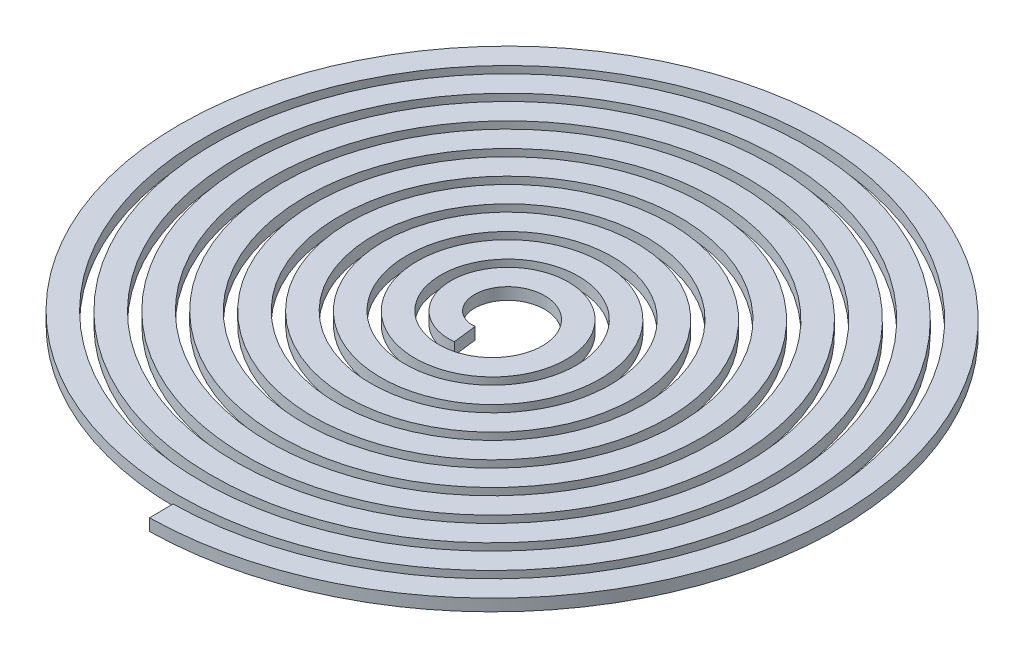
ISO-10303-21;
HEADER;
FILE_DESCRIPTION(('STEP AP214'),'2;1');
FILE_NAME('part.step','',(''),(''),'','','');
FILE_SCHEMA(('AUTOMOTIVE_DESIGN { 1 0 10303 214 1 1 1 1 }'));
ENDSEC;
DATA;
#1=APPLICATION_CONTEXT('core data for automotive mechanical design processes');
#2=APPLICATION_PROTOCOL_DEFINITION('international standard','automotive_design',2000,#1);
#3=PRODUCT_CONTEXT('',#1,'mechanical');
#4=PRODUCT('Part','Part','',(#3));
#5=PRODUCT_RELATED_PRODUCT_CATEGORY('part','',(#4));
#6=PRODUCT_DEFINITION_FORMATION('','',#4);
#7=PRODUCT_DEFINITION_CONTEXT('part definition',#1,'design');
#8=PRODUCT_DEFINITION('design','',#6,#7);
#9=PRODUCT_DEFINITION_SHAPE('','',#8);
#10=(LENGTH_UNIT() NAMED_UNIT(*) SI_UNIT(.MILLI.,.METRE.));
#11=(NAMED_UNIT(*) PLANE_ANGLE_UNIT() SI_UNIT($,.RADIAN.));
#12=(NAMED_UNIT(*) SI_UNIT($,.STERADIAN.) SOLID_ANGLE_UNIT());
#13=UNCERTAINTY_MEASURE_WITH_UNIT(LENGTH_MEASURE(1.E-05),#10,'distance_accuracy_value','');
#14=(GEOMETRIC_REPRESENTATION_CONTEXT(3) GLOBAL_UNCERTAINTY_ASSIGNED_CONTEXT((#13)) GLOBAL_UNIT_ASSIGNED_CONTEXT((#10,
#11,#12)) REPRESENTATION_CONTEXT('',''));
#15=CARTESIAN_POINT('',(0.,0.,0.));
#16=DIRECTION('',(0.,0.,1.));
#17=DIRECTION('',(1.,0.,0.));
#18=AXIS2_PLACEMENT_3D('',#15,#16,#17);
#19=CARTESIAN_POINT('',(0.00556971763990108,0.,10.3499556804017));
#20=DIRECTION('',(0.999873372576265,0.,-0.015913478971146));
#21=DIRECTION('',(-0.015913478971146,0.,-0.999873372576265));
#22=AXIS2_PLACEMENT_3D('',#19,#20,#21);
#23=PLANE('',#22);
#24=DIRECTION('',(0.,-1.,0.));
#25=VECTOR('',#24,1.);
#26=CARTESIAN_POINT('',(0.00556971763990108,0.175,10.3499556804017));
#27=LINE('',#26,#25);
#28=CARTESIAN_POINT('',(0.00556971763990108,0.175,10.3499556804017));
#29=VERTEX_POINT('',#28);
#30=CARTESIAN_POINT('',(0.00556971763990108,-0.175,10.3499556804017));
#31=VERTEX_POINT('',#30);
#32=EDGE_CURVE('E47',#29,#31,#27,.T.);
#33=ORIENTED_EDGE('',*,*,#32,.F.);
#34=DIRECTION('',(0.015913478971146,0.,0.999873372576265));
#35=VECTOR('',#34,1.);
#36=CARTESIAN_POINT('',(0.00556971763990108,0.175,10.3499556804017));
#37=LINE('',#36,#35);
#38=CARTESIAN_POINT('',(-0.00556971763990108,0.175,9.65004431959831));
#39=VERTEX_POINT('',#38);
#40=EDGE_CURVE('E83',#39,#29,#37,.T.);
#41=ORIENTED_EDGE('',*,*,#40,.F.);
#42=DIRECTION('',(0.,1.,0.));
#43=VECTOR('',#42,1.);
#44=CARTESIAN_POINT('',(-0.00556971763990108,0.175,9.65004431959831));
#45=LINE('',#44,#43);
#46=CARTESIAN_POINT('',(-0.00556971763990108,-0.175,9.65004431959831));
#47=VERTEX_POINT('',#46);
#48=EDGE_CURVE('E110',#47,#39,#45,.T.);
#49=ORIENTED_EDGE('',*,*,#48,.F.);
#50=DIRECTION('',(-0.015913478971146,0.,-0.999873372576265));
#51=VECTOR('',#50,1.);
#52=CARTESIAN_POINT('',(0.00556971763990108,-0.175,10.3499556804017));
#53=LINE('',#52,#51);
#54=EDGE_CURVE('E55',#31,#47,#53,.T.);
#55=ORIENTED_EDGE('',*,*,#54,.F.);
#56=EDGE_LOOP('',(#33,#41,#49,#55));
#57=FACE_BOUND('',#56,.T.);
#58=ADVANCED_FACE('F38',(#57),#23,.F.);
#59=CARTESIAN_POINT('',(0.000726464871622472,0.,1.34995698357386));
#60=DIRECTION('',(-0.993058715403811,0.,0.117619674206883));
#61=DIRECTION('',(0.117619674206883,0.,0.993058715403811));
#62=AXIS2_PLACEMENT_3D('',#59,#60,#61);
#63=PLANE('',#62);
#64=DIRECTION('',(0.,-1.,0.));
#65=VECTOR('',#64,1.);
#66=CARTESIAN_POINT('',(0.000726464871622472,0.,1.34995698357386));
#67=LINE('',#66,#65);
#68=CARTESIAN_POINT('',(0.000726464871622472,0.175,1.34995698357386));
#69=VERTEX_POINT('',#68);
#70=CARTESIAN_POINT('',(0.000726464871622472,-0.175,1.34995698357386));
#71=VERTEX_POINT('',#70);
#72=EDGE_CURVE('E13',#69,#71,#67,.T.);
#73=ORIENTED_EDGE('',*,*,#72,.T.);
#74=DIRECTION('',(-0.117619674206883,0.,-0.993058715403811));
#75=VECTOR('',#74,1.);
#76=CARTESIAN_POINT('',(-0.0404404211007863,-0.175,1.00238643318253));
#77=LINE('',#76,#75);
#78=CARTESIAN_POINT('',(-0.081607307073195,-0.175,0.654815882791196));
#79=VERTEX_POINT('',#78);
#80=EDGE_CURVE('E62',#71,#79,#77,.T.);
#81=ORIENTED_EDGE('',*,*,#80,.T.);
#82=DIRECTION('',(0.,1.,0.));
#83=VECTOR('',#82,1.);
#84=CARTESIAN_POINT('',(-0.081607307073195,0.,0.654815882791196));
#85=LINE('',#84,#83);
#86=CARTESIAN_POINT('',(-0.081607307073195,0.175,0.654815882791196));
#87=VERTEX_POINT('',#86);
#88=EDGE_CURVE('E112',#79,#87,#85,.T.);
#89=ORIENTED_EDGE('',*,*,#88,.T.);
#90=DIRECTION('',(0.117619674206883,0.,0.993058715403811));
#91=VECTOR('',#90,1.);
#92=CARTESIAN_POINT('',(-0.0404404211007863,0.175,1.00238643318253));
#93=LINE('',#92,#91);
#94=EDGE_CURVE('E90',#87,#69,#93,.T.);
#95=ORIENTED_EDGE('',*,*,#94,.T.);
#96=EDGE_LOOP('',(#73,#81,#89,#95));
#97=FACE_BOUND('',#96,.T.);
#98=ADVANCED_FACE('F132',(#97),#63,.F.);
#99=CARTESIAN_POINT('',(0.00556971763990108,0.175,10.3499556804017));
#100=CARTESIAN_POINT('',(0.767641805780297,0.174999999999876,10.3378268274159));
#101=CARTESIAN_POINT('',(1.5270287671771,0.175,10.2411921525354));
#102=CARTESIAN_POINT('',(3.0037737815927,0.175,9.88471903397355));
#103=CARTESIAN_POINT('',(3.72107425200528,0.175,9.62489829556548));
#104=CARTESIAN_POINT('',(5.07915487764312,0.175,8.9557461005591));
#105=CARTESIAN_POINT('',(5.71988292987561,0.175,8.5464444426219));
#106=CARTESIAN_POINT('',(6.89427331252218,0.175,7.59918143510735));
#107=CARTESIAN_POINT('',(7.42789149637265,0.175,7.06126044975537));
#108=CARTESIAN_POINT('',(8.36291797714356,0.175,5.8837073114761));
#109=CARTESIAN_POINT('',(8.76429217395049,0.175,5.24412405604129));
#110=CARTESIAN_POINT('',(9.41627091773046,0.175,3.894943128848));
#111=CARTESIAN_POINT('',(9.66685299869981,0.175,3.18540045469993));
#112=CARTESIAN_POINT('',(10.0061275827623,0.175,1.73117510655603));
#113=CARTESIAN_POINT('',(10.0948102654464,0.175,0.986550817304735));
#114=CARTESIAN_POINT('',(10.1070943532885,0.175,-0.501499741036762));
#115=CARTESIAN_POINT('',(10.0306991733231,0.175,-1.24486719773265));
#116=CARTESIAN_POINT('',(9.56114553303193,0.175,-3.41912948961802));
#117=CARTESIAN_POINT('',(8.92413219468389,0.175,-4.79217089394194));
#118=CARTESIAN_POINT('',(7.13102694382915,0.175,-7.12854425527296));
#119=CARTESIAN_POINT('',(5.97615680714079,0.175,-8.09047753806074));
#120=CARTESIAN_POINT('',(3.37454925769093,0.175,-9.42613055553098));
#121=CARTESIAN_POINT('',(1.92950244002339,0.175,-9.79911420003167));
#122=CARTESIAN_POINT('',(-0.972703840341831,0.175,-9.8931946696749));
#123=CARTESIAN_POINT('',(-2.4280333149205,0.175,-9.61434953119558));
#124=CARTESIAN_POINT('',(-5.07269318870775,0.175,-8.46647937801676));
#125=CARTESIAN_POINT('',(-6.26040614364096,0.175,-7.59828425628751));
#126=CARTESIAN_POINT('',(-8.14647374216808,0.175,-5.4452357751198));
#127=CARTESIAN_POINT('',(-8.84372980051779,0.175,-4.16181451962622));
#128=CARTESIAN_POINT('',(-9.62216710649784,0.175,-1.428904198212));
#129=CARTESIAN_POINT('',(-9.70297132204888,0.175,0.0188330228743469));
#130=CARTESIAN_POINT('',(-9.24125021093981,0.175,2.80169656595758));
#131=CARTESIAN_POINT('',(-8.69913114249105,0.175,4.13509092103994));
#132=CARTESIAN_POINT('',(-7.10342714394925,0.175,6.43614606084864));
#133=CARTESIAN_POINT('',(-6.0509427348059,0.175,7.4024256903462));
#134=CARTESIAN_POINT('',(-3.64238376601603,0.175,8.78966666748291));
#135=CARTESIAN_POINT('',(-2.28788340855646,0.175,9.20985668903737));
#136=CARTESIAN_POINT('',(0.461939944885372,0.175,9.43209730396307));
#137=CARTESIAN_POINT('',(1.8555230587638,0.175,9.23412495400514));
#138=CARTESIAN_POINT('',(4.41685960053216,0.175,8.26631416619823));
#139=CARTESIAN_POINT('',(5.58304264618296,0.175,7.49719448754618));
#140=CARTESIAN_POINT('',(7.47003561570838,0.175,5.54184258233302));
#141=CARTESIAN_POINT('',(8.18974244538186,0.175,4.35692231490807));
#142=CARTESIAN_POINT('',(9.05257714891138,0.175,1.80201361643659));
#143=CARTESIAN_POINT('',(9.19527315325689,0.175,0.433670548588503));
#144=CARTESIAN_POINT('',(8.88494316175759,0.175,-2.22424100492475));
#145=CARTESIAN_POINT('',(8.43222895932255,0.175,-3.51215041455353));
#146=CARTESIAN_POINT('',(7.02594632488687,0.175,-5.76443408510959));
#147=CARTESIAN_POINT('',(6.07336239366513,0.175,-6.72745303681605));
#148=CARTESIAN_POINT('',(3.8563474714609,0.175,-8.15073416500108));
#149=CARTESIAN_POINT('',(2.59337509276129,0.175,-8.61019931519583));
#150=CARTESIAN_POINT('',(0.00117247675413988,0.175,-8.94590661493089));
#151=CARTESIAN_POINT('',(-1.32641130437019,0.175,-8.8220538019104));
#152=CARTESIAN_POINT('',(-3.79345428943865,0.175,-8.02324226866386));
#153=CARTESIAN_POINT('',(-4.93139697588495,0.175,-7.34889786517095));
#154=CARTESIAN_POINT('',(-6.8047048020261,0.175,-5.58589939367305));
#155=CARTESIAN_POINT('',(-7.53897132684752,0.175,-4.49844030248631));
#156=CARTESIAN_POINT('',(-8.47072797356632,0.175,-2.12290290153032));
#157=CARTESIAN_POINT('',(-8.66774085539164,0.175,-0.836362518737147));
#158=CARTESIAN_POINT('',(-8.49539303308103,0.175,1.68879191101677));
#159=CARTESIAN_POINT('',(-8.12625781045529,0.175,2.92582465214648));
#160=CARTESIAN_POINT('',(-6.90058644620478,0.175,5.11659080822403));
#161=CARTESIAN_POINT('',(-6.04492408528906,0.175,6.0690026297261));
#162=CARTESIAN_POINT('',(-4.0168971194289,0.175,7.51306251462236));
#163=CARTESIAN_POINT('',(-2.84587698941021,0.175,8.00389721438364));
#164=CARTESIAN_POINT('',(-0.415460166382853,0.175,8.43818948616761));
#165=CARTESIAN_POINT('',(0.842386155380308,0.175,8.38148915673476));
#166=CARTESIAN_POINT('',(3.20505539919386,0.175,7.73999025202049));
#167=CARTESIAN_POINT('',(4.30842192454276,0.175,7.15570863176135));
#168=CARTESIAN_POINT('',(6.15397249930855,0.175,5.57877532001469));
#169=CARTESIAN_POINT('',(6.89507107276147,0.175,4.5872053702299));
#170=CARTESIAN_POINT('',(7.88035911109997,0.175,2.39132523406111));
#171=CARTESIAN_POINT('',(8.12403538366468,0.175,1.18844525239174));
#172=CARTESIAN_POINT('',(8.07587662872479,0.175,-1.19716306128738));
#173=CARTESIAN_POINT('',(7.78418916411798,0.175,-2.37839211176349));
#174=CARTESIAN_POINT('',(6.72953938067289,0.175,-4.49565025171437));
#175=CARTESIAN_POINT('',(5.96734590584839,0.175,-5.43039887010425));
#176=CARTESIAN_POINT('',(4.12472443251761,0.175,-6.88032780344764));
#177=CARTESIAN_POINT('',(3.04552885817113,0.175,-7.39468756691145));
#178=CARTESIAN_POINT('',(0.779985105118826,0.175,-7.9125646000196));
#179=CARTESIAN_POINT('',(-0.404910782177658,0.175,-7.91587018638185));
#180=CARTESIAN_POINT('',(-2.65405039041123,0.175,-7.41943171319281));
#181=CARTESIAN_POINT('',(-3.71690352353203,0.175,-6.92011467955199));
#182=CARTESIAN_POINT('',(-5.52122007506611,0.175,-5.52205365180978));
#183=CARTESIAN_POINT('',(-6.26161945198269,0.175,-4.62428247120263));
#184=CARTESIAN_POINT('',(-7.28520197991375,0.175,-2.60727426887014));
#185=CARTESIAN_POINT('',(-7.56784531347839,0.175,-1.48936010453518));
#186=CARTESIAN_POINT('',(-7.62976583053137,0.175,0.750947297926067));
#187=CARTESIAN_POINT('',(-7.40912125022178,0.175,1.87192689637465));
#188=CARTESIAN_POINT('',(-6.5151770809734,0.175,3.90448711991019));
#189=CARTESIAN_POINT('',(-5.84254763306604,0.175,4.81483531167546));
#190=CARTESIAN_POINT('',(-4.18075184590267,0.175,6.25613872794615));
#191=CARTESIAN_POINT('',(-3.19270858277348,0.175,6.78627510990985));
#192=CARTESIAN_POINT('',(-1.09404662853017,0.175,7.37268794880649));
#193=CARTESIAN_POINT('',(0.0152191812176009,0.175,7.42870813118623));
#194=CARTESIAN_POINT('',(2.14262795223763,0.175,7.0645750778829));
#195=CARTESIAN_POINT('',(3.15945123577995,0.175,6.64476668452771));
#196=CARTESIAN_POINT('',(4.9097065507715,0.175,5.41752427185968));
#197=CARTESIAN_POINT('',(5.64210387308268,0.175,4.6109589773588));
#198=CARTESIAN_POINT('',(6.68896533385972,0.175,2.77098260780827));
#199=CARTESIAN_POINT('',(7.00287222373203,0.175,1.73878806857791));
#200=CARTESIAN_POINT('',(7.16051378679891,0.175,-0.351511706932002));
#201=CARTESIAN_POINT('',(7.00426611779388,0.175,-1.40829191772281));
#202=CARTESIAN_POINT('',(6.26004114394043,0.175,-3.3458065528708));
#203=CARTESIAN_POINT('',(5.67264192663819,0.175,-4.22536298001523));
#204=CARTESIAN_POINT('',(4.18612743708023,0.175,-5.64402287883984));
#205=CARTESIAN_POINT('',(3.28802919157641,0.175,-6.18231782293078));
#206=CARTESIAN_POINT('',(1.35718268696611,0.175,-6.82223827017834));
#207=CARTESIAN_POINT('',(0.325687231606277,0.175,-6.92357208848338));
#208=CARTESIAN_POINT('',(-1.67277065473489,0.175,-6.67855096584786));
#209=CARTESIAN_POINT('',(-2.63848881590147,0.175,-6.33246670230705));
#210=CARTESIAN_POINT('',(-4.32255657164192,0.175,-5.26717536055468));
#211=CARTESIAN_POINT('',(-5.03990825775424,0.175,-4.54873826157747));
#212=CARTESIAN_POINT('',(-6.09532084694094,0.175,-2.88291942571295));
#213=CARTESIAN_POINT('',(-6.43281608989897,0.175,-1.93664956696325));
#214=CARTESIAN_POINT('',(-6.67164086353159,0.175,-6.3790457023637E-06));
#215=CARTESIAN_POINT('',(-6.57293633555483,0.175,0.989132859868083));
#216=CARTESIAN_POINT('',(-5.96683180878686,0.175,2.82213452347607));
#217=CARTESIAN_POINT('',(-5.45992487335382,0.175,3.66487924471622));
#218=CARTESIAN_POINT('',(-4.14221906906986,0.175,5.04741336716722));
#219=CARTESIAN_POINT('',(-3.33233504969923,0.175,5.58641283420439));
#220=CARTESIAN_POINT('',(-1.56917024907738,0.175,6.26490245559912));
#221=CARTESIAN_POINT('',(-0.617042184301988,0.175,6.40407464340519));
#222=CARTESIAN_POINT('',(1.24624836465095,0.175,6.26459916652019));
#223=CARTESIAN_POINT('',(2.15624586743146,0.175,5.98615626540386));
#224=CARTESIAN_POINT('',(3.7627489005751,0.175,5.07318442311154));
#225=CARTESIAN_POINT('',(4.45830033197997,0.175,4.43933253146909));
#226=CARTESIAN_POINT('',(5.50788888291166,0.175,2.9437872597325));
#227=CARTESIAN_POINT('',(5.86136073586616,0.175,2.08310338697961));
#228=CARTESIAN_POINT('',(6.1667204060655,0.175,0.302702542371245));
#229=CARTESIAN_POINT('',(6.11853138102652,0.175,-0.615872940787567));
#230=CARTESIAN_POINT('',(5.63839642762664,0.175,-2.33580890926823));
#231=CARTESIAN_POINT('',(5.20686591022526,0.175,-3.13611728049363));
#232=CARTESIAN_POINT('',(4.05060776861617,0.175,-4.46963583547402));
#233=CARTESIAN_POINT('',(3.32669723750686,0.175,-5.00208259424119));
#234=CARTESIAN_POINT('',(1.73002484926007,0.175,-5.70436098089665));
#235=CARTESIAN_POINT('',(0.858316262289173,0.175,-5.87385739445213));
#236=CARTESIAN_POINT('',(-0.864612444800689,0.175,-5.82605526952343));
#237=CARTESIAN_POINT('',(-1.71475012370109,0.175,-5.60890402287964));
#238=CARTESIAN_POINT('',(-3.23310547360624,0.175,-4.8379086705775));
#239=CARTESIAN_POINT('',(-3.90041937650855,0.175,-4.28465494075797));
#240=CARTESIAN_POINT('',(-4.93022449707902,0.175,-2.95451797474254));
#241=CARTESIAN_POINT('',(-5.29215939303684,0.175,-2.17854476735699));
#242=CARTESIAN_POINT('',(-5.64936435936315,0.175,-0.555907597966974));
#243=CARTESIAN_POINT('',(-5.64452376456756,0.175,0.289708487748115));
#244=CARTESIAN_POINT('',(-5.2777174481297,0.175,1.88897126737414));
#245=CARTESIAN_POINT('',(-4.91609716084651,0.175,2.6416361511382));
#246=CARTESIAN_POINT('',(-3.91308036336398,0.175,3.9138958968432));
#247=CARTESIAN_POINT('',(-3.27240813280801,0.175,4.43276136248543));
#248=CARTESIAN_POINT('',(-1.83999928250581,0.175,5.14427340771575));
#249=CARTESIAN_POINT('',(-1.04921776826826,0.175,5.33657642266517));
#250=CARTESIAN_POINT('',(0.529190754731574,0.175,5.36633699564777));
#251=CARTESIAN_POINT('',(1.31582047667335,0.175,5.20389296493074));
#252=CARTESIAN_POINT('',(2.73628105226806,0.175,4.5638747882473));
#253=CARTESIAN_POINT('',(3.36926447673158,0.175,4.0868110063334));
#254=CARTESIAN_POINT('',(4.36580371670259,0.175,2.9162679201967));
#255=CARTESIAN_POINT('',(4.72882041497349,0.175,2.22360264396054));
#256=CARTESIAN_POINT('',(5.12320879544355,0.175,0.759189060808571));
#257=CARTESIAN_POINT('',(5.15444493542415,0.175,-0.0116053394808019));
#258=CARTESIAN_POINT('',(4.88789994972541,0.175,-1.48355933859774));
#259=CARTESIAN_POINT('',(4.59040222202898,0.175,-2.18381154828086));
#260=CARTESIAN_POINT('',(3.73162140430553,0.175,-3.38326704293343));
#261=CARTESIAN_POINT('',(3.17097521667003,0.175,-3.88178205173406));
#262=CARTESIAN_POINT('',(1.89958145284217,0.175,-4.58826400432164));
#263=CARTESIAN_POINT('',(1.18969272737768,0.175,-4.79588775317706));
#264=CARTESIAN_POINT('',(-0.241083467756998,0.175,-4.8889302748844));
#265=CARTESIAN_POINT('',(-0.961060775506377,0.175,-4.77440727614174));
#266=CARTESIAN_POINT('',(-2.27475350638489,0.175,-4.25376812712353));
#267=CARTESIAN_POINT('',(-2.8676833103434,0.175,-3.84808936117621));
#268=CARTESIAN_POINT('',(-3.81801014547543,0.175,-2.8304122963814));
#269=CARTESIAN_POINT('',(-4.17489319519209,0.175,-2.21913606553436));
#270=CARTESIAN_POINT('',(-4.59189939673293,0.175,-0.912351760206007));
#271=CARTESIAN_POINT('',(-4.65187101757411,0.175,-0.21770391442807));
#272=CARTESIAN_POINT('',(-4.47215877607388,0.175,1.12130030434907));
#273=CARTESIAN_POINT('',(-4.23270443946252,0.175,1.76482721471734));
#274=CARTESIAN_POINT('',(-3.50840440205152,0.175,2.88067906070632));
#275=CARTESIAN_POINT('',(-3.02411412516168,0.175,3.35236347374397));
#276=CARTESIAN_POINT('',(-1.90949138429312,0.175,4.03990753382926));
#277=CARTESIAN_POINT('',(-1.27992403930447,0.175,4.25543285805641));
#278=CARTESIAN_POINT('',(0.00115971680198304,0.175,4.39737511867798));
#279=CARTESIAN_POINT('',(0.651854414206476,0.175,4.323818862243));
#280=CARTESIAN_POINT('',(1.85081475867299,0.175,3.9104213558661));
#281=CARTESIAN_POINT('',(2.39836150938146,0.175,3.57095187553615));
#282=CARTESIAN_POINT('',(3.29012193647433,0.175,2.69853875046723));
#283=CARTESIAN_POINT('',(3.6338543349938,0.175,2.16622979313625));
#284=CARTESIAN_POINT('',(4.05907694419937,0.175,1.01543760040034));
#285=CARTESIAN_POINT('',(4.14040842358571,0.175,0.397721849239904));
#286=CARTESIAN_POINT('',(4.03380530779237,0.175,-0.803704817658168));
#287=CARTESIAN_POINT('',(3.84605471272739,0.175,-1.38666707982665));
#288=CARTESIAN_POINT('',(3.24578240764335,0.175,-2.40890699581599));
#289=CARTESIAN_POINT('',(2.83374097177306,0.175,-2.84759802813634));
#290=CARTESIAN_POINT('',(1.87067740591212,0.175,-3.50271525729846));
#291=CARTESIAN_POINT('',(1.32032978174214,0.175,-3.71882424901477));
#292=CARTESIAN_POINT('',(0.189944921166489,0.175,-3.8952513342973));
#293=CARTESIAN_POINT('',(-0.389359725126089,0.175,-3.85557359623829));
#294=CARTESIAN_POINT('',(-1.46656242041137,0.175,-3.53680261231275));
#295=CARTESIAN_POINT('',(-1.96381263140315,0.175,-3.2580231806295));
#296=CARTESIAN_POINT('',(-2.78529917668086,0.175,-2.52244022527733));
#297=CARTESIAN_POINT('',(-3.10909410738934,0.175,-2.06618909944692));
#298=CARTESIAN_POINT('',(-3.52836285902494,0.175,-1.06872446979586));
#299=CARTESIAN_POINT('',(-3.62367939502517,0.175,-0.528187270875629));
#300=CARTESIAN_POINT('',(-3.57623392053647,0.175,0.532061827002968));
#301=CARTESIAN_POINT('',(-3.43361887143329,0.175,1.05110813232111));
#302=CARTESIAN_POINT('',(-2.94627797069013,0.175,1.97056069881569));
#303=CARTESIAN_POINT('',(-2.60196396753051,0.175,2.3704398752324));
#304=CARTESIAN_POINT('',(-1.78431152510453,0.175,2.98012119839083));
#305=CARTESIAN_POINT('',(-1.31156067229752,0.175,3.18963120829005));
#306=CARTESIAN_POINT('',(-0.331830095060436,0.175,3.38616412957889));
#307=CARTESIAN_POINT('',(0.174506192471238,0.175,3.37317733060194));
#308=CARTESIAN_POINT('',(1.12389214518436,0.175,3.13600319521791));
#309=CARTESIAN_POINT('',(1.56636877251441,0.175,2.91207963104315));
#310=CARTESIAN_POINT('',(2.30657172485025,0.175,2.30410708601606));
#311=CARTESIAN_POINT('',(2.60390326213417,0.175,1.92053378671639));
#312=CARTESIAN_POINT('',(3.00334484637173,0.175,1.07272430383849));
#313=CARTESIAN_POINT('',(3.10530751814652,0.175,0.6090754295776));
#314=CARTESIAN_POINT('',(3.1029081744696,0.175,-0.307434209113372));
#315=CARTESIAN_POINT('',(2.99866466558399,0.175,-0.759714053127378));
#316=CARTESIAN_POINT('',(2.61257250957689,0.175,-1.56807498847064));
#317=CARTESIAN_POINT('',(2.3310743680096,0.175,-1.92369363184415));
#318=CARTESIAN_POINT('',(1.65178400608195,0.175,-2.47546871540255));
#319=CARTESIAN_POINT('',(1.25449669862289,0.175,-2.67136570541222));
#320=CARTESIAN_POINT('',(0.424331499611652,0.175,-2.87372965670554));
#321=CARTESIAN_POINT('',(-0.0079914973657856,0.175,-2.8801817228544));
#322=CARTESIAN_POINT('',(-0.824490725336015,0.175,-2.7112248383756));
#323=CARTESIAN_POINT('',(-1.20817185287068,0.175,-2.53603774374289));
#324=CARTESIAN_POINT('',(-1.85682754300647,0.175,-2.04571855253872));
#325=CARTESIAN_POINT('',(-2.12146021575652,0.175,-1.73099144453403));
#326=CARTESIAN_POINT('',(-2.48756268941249,0.175,-1.02818030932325));
#327=CARTESIAN_POINT('',(-2.58890326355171,0.175,-0.640597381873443));
#328=CARTESIAN_POINT('',(-2.61734678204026,0.175,0.130655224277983));
#329=CARTESIAN_POINT('',(-2.54454841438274,0.175,0.513829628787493));
#330=CARTESIAN_POINT('',(-2.24749513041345,0.175,1.20370046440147));
#331=CARTESIAN_POINT('',(-2.02353677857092,0.175,1.51000362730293));
#332=CARTESIAN_POINT('',(-1.47469717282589,0.175,1.99199742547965));
#333=CARTESIAN_POINT('',(-1.1502429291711,0.175,2.16746854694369));
#334=CARTESIAN_POINT('',(-0.467520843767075,0.175,2.36156054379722));
#335=CARTESIAN_POINT('',(-0.109720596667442,0.175,2.38016992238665));
#336=CARTESIAN_POINT('',(0.569829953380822,0.175,2.2657666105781));
#337=CARTESIAN_POINT('',(0.891165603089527,0.175,2.13294215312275));
#338=CARTESIAN_POINT('',(1.43880156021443,0.175,1.74963346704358));
#339=CARTESIAN_POINT('',(1.66481866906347,0.175,1.49948997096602));
#340=CARTESIAN_POINT('',(1.9844942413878,0.175,0.936063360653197));
#341=CARTESIAN_POINT('',(2.07804959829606,0.175,0.623198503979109));
#342=CARTESIAN_POINT('',(2.12310940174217,0.175,-0.00232580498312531));
#343=CARTESIAN_POINT('',(2.07470135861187,0.175,-0.314575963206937));
#344=CARTESIAN_POINT('',(1.85401093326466,0.175,-0.87949499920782));
#345=CARTESIAN_POINT('',(1.68197885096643,0.175,-1.13184375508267));
#346=CARTESIAN_POINT('',(1.25485845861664,0.175,-1.53283052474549));
#347=CARTESIAN_POINT('',(1.00012451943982,0.175,-1.68129580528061));
#348=CARTESIAN_POINT('',(0.461704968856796,0.175,-1.85325146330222));
#349=CARTESIAN_POINT('',(0.178401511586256,0.175,-1.87674216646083));
#350=CARTESIAN_POINT('',(-0.361161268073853,0.175,-1.80301148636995));
#351=CARTESIAN_POINT('',(-0.617088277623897,0.175,-1.70595312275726));
#352=CARTESIAN_POINT('',(-1.05506510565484,0.175,-1.41838042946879));
#353=CARTESIAN_POINT('',(-1.23689569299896,0.175,-1.22814938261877));
#354=CARTESIAN_POINT('',(-1.49754166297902,0.175,-0.797567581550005));
#355=CARTESIAN_POINT('',(-1.57628771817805,0.175,-0.557556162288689));
#356=CARTESIAN_POINT('',(-1.62378230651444,0.175,-0.0771873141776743));
#357=CARTESIAN_POINT('',(-1.59261576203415,0.175,0.162846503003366));
#358=CARTESIAN_POINT('',(-1.43520884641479,0.175,0.597315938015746));
#359=CARTESIAN_POINT('',(-1.30918040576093,0.175,0.791507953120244));
#360=CARTESIAN_POINT('',(-0.994272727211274,0.175,1.10096254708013));
#361=CARTESIAN_POINT('',(-0.805680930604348,0.175,1.21610557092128));
#362=CARTESIAN_POINT('',(-0.407424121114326,0.175,1.35236478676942));
#363=CARTESIAN_POINT('',(-0.19805853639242,0.175,1.37350146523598));
#364=CARTESIAN_POINT('',(0.000726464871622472,0.175,1.34995698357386));
#365=CARTESIAN_POINT('',(0.00556971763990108,-0.175,10.3499556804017));
#366=CARTESIAN_POINT('',(0.767641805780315,-0.175000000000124,10.3378268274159));
#367=CARTESIAN_POINT('',(1.5270287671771,-0.175,10.2411921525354));
#368=CARTESIAN_POINT('',(3.0037737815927,-0.175,9.88471903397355));
#369=CARTESIAN_POINT('',(3.72107425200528,-0.175,9.62489829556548));
#370=CARTESIAN_POINT('',(5.07915487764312,-0.175,8.9557461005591));
#371=CARTESIAN_POINT('',(5.71988292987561,-0.175,8.5464444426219));
#372=CARTESIAN_POINT('',(6.89427331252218,-0.175,7.59918143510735));
#373=CARTESIAN_POINT('',(7.42789149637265,-0.175,7.06126044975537));
#374=CARTESIAN_POINT('',(8.36291797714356,-0.175,5.8837073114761));
#375=CARTESIAN_POINT('',(8.76429217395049,-0.175,5.24412405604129));
#376=CARTESIAN_POINT('',(9.41627091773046,-0.175,3.894943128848));
#377=CARTESIAN_POINT('',(9.66685299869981,-0.175,3.18540045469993));
#378=CARTESIAN_POINT('',(10.0061275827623,-0.175,1.73117510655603));
#379=CARTESIAN_POINT('',(10.0948102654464,-0.175,0.986550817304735));
#380=CARTESIAN_POINT('',(10.1070943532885,-0.175,-0.501499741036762));
#381=CARTESIAN_POINT('',(10.0306991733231,-0.175,-1.24486719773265));
#382=CARTESIAN_POINT('',(9.56114553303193,-0.175,-3.41912948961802));
#383=CARTESIAN_POINT('',(8.92413219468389,-0.175,-4.79217089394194));
#384=CARTESIAN_POINT('',(7.13102694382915,-0.175,-7.12854425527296));
#385=CARTESIAN_POINT('',(5.97615680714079,-0.175,-8.09047753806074));
#386=CARTESIAN_POINT('',(3.37454925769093,-0.175,-9.42613055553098));
#387=CARTESIAN_POINT('',(1.92950244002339,-0.175,-9.79911420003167));
#388=CARTESIAN_POINT('',(-0.972703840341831,-0.175,-9.8931946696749));
#389=CARTESIAN_POINT('',(-2.4280333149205,-0.175,-9.61434953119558));
#390=CARTESIAN_POINT('',(-5.07269318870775,-0.175,-8.46647937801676));
#391=CARTESIAN_POINT('',(-6.26040614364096,-0.175,-7.59828425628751));
#392=CARTESIAN_POINT('',(-8.14647374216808,-0.175,-5.4452357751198));
#393=CARTESIAN_POINT('',(-8.84372980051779,-0.175,-4.16181451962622));
#394=CARTESIAN_POINT('',(-9.62216710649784,-0.175,-1.428904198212));
#395=CARTESIAN_POINT('',(-9.70297132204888,-0.175,0.0188330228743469));
#396=CARTESIAN_POINT('',(-9.24125021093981,-0.175,2.80169656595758));
#397=CARTESIAN_POINT('',(-8.69913114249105,-0.175,4.13509092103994));
#398=CARTESIAN_POINT('',(-7.10342714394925,-0.175,6.43614606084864));
#399=CARTESIAN_POINT('',(-6.0509427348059,-0.175,7.4024256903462));
#400=CARTESIAN_POINT('',(-3.64238376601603,-0.175,8.78966666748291));
#401=CARTESIAN_POINT('',(-2.28788340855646,-0.175,9.20985668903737));
#402=CARTESIAN_POINT('',(0.461939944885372,-0.175,9.43209730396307));
#403=CARTESIAN_POINT('',(1.8555230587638,-0.175,9.23412495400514));
#404=CARTESIAN_POINT('',(4.41685960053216,-0.175,8.26631416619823));
#405=CARTESIAN_POINT('',(5.58304264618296,-0.175,7.49719448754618));
#406=CARTESIAN_POINT('',(7.47003561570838,-0.175,5.54184258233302));
#407=CARTESIAN_POINT('',(8.18974244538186,-0.175,4.35692231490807));
#408=CARTESIAN_POINT('',(9.05257714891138,-0.175,1.80201361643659));
#409=CARTESIAN_POINT('',(9.19527315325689,-0.175,0.433670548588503));
#410=CARTESIAN_POINT('',(8.88494316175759,-0.175,-2.22424100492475));
#411=CARTESIAN_POINT('',(8.43222895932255,-0.175,-3.51215041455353));
#412=CARTESIAN_POINT('',(7.02594632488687,-0.175,-5.76443408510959));
#413=CARTESIAN_POINT('',(6.07336239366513,-0.175,-6.72745303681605));
#414=CARTESIAN_POINT('',(3.8563474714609,-0.175,-8.15073416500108));
#415=CARTESIAN_POINT('',(2.59337509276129,-0.175,-8.61019931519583));
#416=CARTESIAN_POINT('',(0.00117247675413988,-0.175,-8.94590661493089));
#417=CARTESIAN_POINT('',(-1.32641130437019,-0.175,-8.8220538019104));
#418=CARTESIAN_POINT('',(-3.79345428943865,-0.175,-8.02324226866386));
#419=CARTESIAN_POINT('',(-4.93139697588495,-0.175,-7.34889786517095));
#420=CARTESIAN_POINT('',(-6.8047048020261,-0.175,-5.58589939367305));
#421=CARTESIAN_POINT('',(-7.53897132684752,-0.175,-4.49844030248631));
#422=CARTESIAN_POINT('',(-8.47072797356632,-0.175,-2.12290290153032));
#423=CARTESIAN_POINT('',(-8.66774085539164,-0.175,-0.836362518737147));
#424=CARTESIAN_POINT('',(-8.49539303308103,-0.175,1.68879191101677));
#425=CARTESIAN_POINT('',(-8.12625781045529,-0.175,2.92582465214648));
#426=CARTESIAN_POINT('',(-6.90058644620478,-0.175,5.11659080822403));
#427=CARTESIAN_POINT('',(-6.04492408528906,-0.175,6.0690026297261));
#428=CARTESIAN_POINT('',(-4.0168971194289,-0.175,7.51306251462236));
#429=CARTESIAN_POINT('',(-2.84587698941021,-0.175,8.00389721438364));
#430=CARTESIAN_POINT('',(-0.415460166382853,-0.175,8.43818948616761));
#431=CARTESIAN_POINT('',(0.842386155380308,-0.175,8.38148915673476));
#432=CARTESIAN_POINT('',(3.20505539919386,-0.175,7.73999025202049));
#433=CARTESIAN_POINT('',(4.30842192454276,-0.175,7.15570863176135));
#434=CARTESIAN_POINT('',(6.15397249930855,-0.175,5.57877532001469));
#435=CARTESIAN_POINT('',(6.89507107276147,-0.175,4.5872053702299));
#436=CARTESIAN_POINT('',(7.88035911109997,-0.175,2.39132523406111));
#437=CARTESIAN_POINT('',(8.12403538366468,-0.175,1.18844525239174));
#438=CARTESIAN_POINT('',(8.07587662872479,-0.175,-1.19716306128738));
#439=CARTESIAN_POINT('',(7.78418916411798,-0.175,-2.37839211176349));
#440=CARTESIAN_POINT('',(6.72953938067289,-0.175,-4.49565025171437));
#441=CARTESIAN_POINT('',(5.96734590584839,-0.175,-5.43039887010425));
#442=CARTESIAN_POINT('',(4.12472443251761,-0.175,-6.88032780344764));
#443=CARTESIAN_POINT('',(3.04552885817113,-0.175,-7.39468756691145));
#444=CARTESIAN_POINT('',(0.779985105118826,-0.175,-7.9125646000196));
#445=CARTESIAN_POINT('',(-0.404910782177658,-0.175,-7.91587018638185));
#446=CARTESIAN_POINT('',(-2.65405039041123,-0.175,-7.41943171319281));
#447=CARTESIAN_POINT('',(-3.71690352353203,-0.175,-6.92011467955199));
#448=CARTESIAN_POINT('',(-5.52122007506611,-0.175,-5.52205365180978));
#449=CARTESIAN_POINT('',(-6.26161945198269,-0.175,-4.62428247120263));
#450=CARTESIAN_POINT('',(-7.28520197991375,-0.175,-2.60727426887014));
#451=CARTESIAN_POINT('',(-7.56784531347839,-0.175,-1.48936010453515));
#452=CARTESIAN_POINT('',(-7.62976583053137,-0.175,0.750947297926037));
#453=CARTESIAN_POINT('',(-7.40912125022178,-0.175,1.87192689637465));
#454=CARTESIAN_POINT('',(-6.5151770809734,-0.175,3.90448711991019));
#455=CARTESIAN_POINT('',(-5.84254763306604,-0.175,4.81483531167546));
#456=CARTESIAN_POINT('',(-4.18075184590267,-0.175,6.25613872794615));
#457=CARTESIAN_POINT('',(-3.19270858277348,-0.175,6.78627510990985));
#458=CARTESIAN_POINT('',(-1.09404662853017,-0.175,7.37268794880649));
#459=CARTESIAN_POINT('',(0.0152191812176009,-0.175,7.42870813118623));
#460=CARTESIAN_POINT('',(2.14262795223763,-0.175,7.0645750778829));
#461=CARTESIAN_POINT('',(3.15945123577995,-0.175,6.64476668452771));
#462=CARTESIAN_POINT('',(4.9097065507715,-0.175,5.41752427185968));
#463=CARTESIAN_POINT('',(5.64210387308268,-0.175,4.6109589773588));
#464=CARTESIAN_POINT('',(6.68896533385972,-0.175,2.77098260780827));
#465=CARTESIAN_POINT('',(7.00287222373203,-0.175,1.73878806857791));
#466=CARTESIAN_POINT('',(7.16051378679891,-0.175,-0.351511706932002));
#467=CARTESIAN_POINT('',(7.00426611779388,-0.175,-1.40829191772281));
#468=CARTESIAN_POINT('',(6.26004114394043,-0.175,-3.3458065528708));
#469=CARTESIAN_POINT('',(5.67264192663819,-0.175,-4.22536298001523));
#470=CARTESIAN_POINT('',(4.18612743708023,-0.175,-5.64402287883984));
#471=CARTESIAN_POINT('',(3.28802919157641,-0.175,-6.18231782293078));
#472=CARTESIAN_POINT('',(1.35718268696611,-0.175,-6.82223827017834));
#473=CARTESIAN_POINT('',(0.325687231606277,-0.175,-6.92357208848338));
#474=CARTESIAN_POINT('',(-1.67277065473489,-0.175,-6.67855096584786));
#475=CARTESIAN_POINT('',(-2.63848881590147,-0.175,-6.33246670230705));
#476=CARTESIAN_POINT('',(-4.32255657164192,-0.175,-5.26717536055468));
#477=CARTESIAN_POINT('',(-5.03990825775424,-0.175,-4.54873826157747));
#478=CARTESIAN_POINT('',(-6.09532084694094,-0.175,-2.88291942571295));
#479=CARTESIAN_POINT('',(-6.43281608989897,-0.175,-1.93664956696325));
#480=CARTESIAN_POINT('',(-6.67164086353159,-0.175,-6.3790457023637E-06));
#481=CARTESIAN_POINT('',(-6.57293633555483,-0.175,0.989132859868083));
#482=CARTESIAN_POINT('',(-5.96683180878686,-0.175,2.82213452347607));
#483=CARTESIAN_POINT('',(-5.45992487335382,-0.175,3.66487924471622));
#484=CARTESIAN_POINT('',(-4.14221906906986,-0.175,5.04741336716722));
#485=CARTESIAN_POINT('',(-3.33233504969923,-0.175,5.58641283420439));
#486=CARTESIAN_POINT('',(-1.56917024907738,-0.175,6.26490245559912));
#487=CARTESIAN_POINT('',(-0.617042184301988,-0.175,6.40407464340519));
#488=CARTESIAN_POINT('',(1.24624836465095,-0.175,6.26459916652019));
#489=CARTESIAN_POINT('',(2.15624586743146,-0.175,5.98615626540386));
#490=CARTESIAN_POINT('',(3.7627489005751,-0.175,5.07318442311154));
#491=CARTESIAN_POINT('',(4.45830033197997,-0.175,4.43933253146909));
#492=CARTESIAN_POINT('',(5.50788888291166,-0.175,2.9437872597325));
#493=CARTESIAN_POINT('',(5.86136073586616,-0.175,2.08310338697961));
#494=CARTESIAN_POINT('',(6.1667204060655,-0.175,0.302702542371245));
#495=CARTESIAN_POINT('',(6.11853138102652,-0.175,-0.615872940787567));
#496=CARTESIAN_POINT('',(5.63839642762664,-0.175,-2.33580890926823));
#497=CARTESIAN_POINT('',(5.20686591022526,-0.175,-3.13611728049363));
#498=CARTESIAN_POINT('',(4.05060776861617,-0.175,-4.46963583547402));
#499=CARTESIAN_POINT('',(3.32669723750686,-0.175,-5.00208259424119));
#500=CARTESIAN_POINT('',(1.73002484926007,-0.175,-5.70436098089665));
#501=CARTESIAN_POINT('',(0.858316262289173,-0.175,-5.87385739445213));
#502=CARTESIAN_POINT('',(-0.864612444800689,-0.175,-5.82605526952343));
#503=CARTESIAN_POINT('',(-1.71475012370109,-0.175,-5.60890402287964));
#504=CARTESIAN_POINT('',(-3.23310547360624,-0.175,-4.8379086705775));
#505=CARTESIAN_POINT('',(-3.90041937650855,-0.175,-4.28465494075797));
#506=CARTESIAN_POINT('',(-4.93022449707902,-0.175,-2.95451797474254));
#507=CARTESIAN_POINT('',(-5.29215939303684,-0.175,-2.17854476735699));
#508=CARTESIAN_POINT('',(-5.64936435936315,-0.175,-0.555907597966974));
#509=CARTESIAN_POINT('',(-5.64452376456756,-0.175,0.289708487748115));
#510=CARTESIAN_POINT('',(-5.2777174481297,-0.175,1.88897126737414));
#511=CARTESIAN_POINT('',(-4.91609716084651,-0.175,2.6416361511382));
#512=CARTESIAN_POINT('',(-3.91308036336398,-0.175,3.9138958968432));
#513=CARTESIAN_POINT('',(-3.27240813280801,-0.175,4.43276136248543));
#514=CARTESIAN_POINT('',(-1.83999928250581,-0.175,5.14427340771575));
#515=CARTESIAN_POINT('',(-1.04921776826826,-0.175,5.33657642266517));
#516=CARTESIAN_POINT('',(0.529190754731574,-0.175,5.36633699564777));
#517=CARTESIAN_POINT('',(1.31582047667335,-0.175,5.20389296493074));
#518=CARTESIAN_POINT('',(2.73628105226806,-0.175,4.5638747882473));
#519=CARTESIAN_POINT('',(3.36926447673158,-0.175,4.0868110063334));
#520=CARTESIAN_POINT('',(4.36580371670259,-0.175,2.9162679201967));
#521=CARTESIAN_POINT('',(4.72882041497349,-0.175,2.22360264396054));
#522=CARTESIAN_POINT('',(5.12320879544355,-0.175,0.759189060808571));
#523=CARTESIAN_POINT('',(5.15444493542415,-0.175,-0.0116053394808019));
#524=CARTESIAN_POINT('',(4.88789994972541,-0.175,-1.48355933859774));
#525=CARTESIAN_POINT('',(4.59040222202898,-0.175,-2.18381154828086));
#526=CARTESIAN_POINT('',(3.73162140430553,-0.175,-3.38326704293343));
#527=CARTESIAN_POINT('',(3.17097521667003,-0.175,-3.88178205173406));
#528=CARTESIAN_POINT('',(1.89958145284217,-0.175,-4.58826400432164));
#529=CARTESIAN_POINT('',(1.18969272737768,-0.175,-4.79588775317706));
#530=CARTESIAN_POINT('',(-0.241083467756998,-0.175,-4.8889302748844));
#531=CARTESIAN_POINT('',(-0.961060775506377,-0.175,-4.77440727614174));
#532=CARTESIAN_POINT('',(-2.27475350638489,-0.175,-4.25376812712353));
#533=CARTESIAN_POINT('',(-2.8676833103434,-0.175,-3.84808936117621));
#534=CARTESIAN_POINT('',(-3.81801014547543,-0.175,-2.8304122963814));
#535=CARTESIAN_POINT('',(-4.17489319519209,-0.175,-2.21913606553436));
#536=CARTESIAN_POINT('',(-4.59189939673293,-0.175,-0.912351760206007));
#537=CARTESIAN_POINT('',(-4.65187101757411,-0.175,-0.21770391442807));
#538=CARTESIAN_POINT('',(-4.47215877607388,-0.175,1.12130030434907));
#539=CARTESIAN_POINT('',(-4.23270443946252,-0.175,1.76482721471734));
#540=CARTESIAN_POINT('',(-3.50840440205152,-0.175,2.88067906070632));
#541=CARTESIAN_POINT('',(-3.02411412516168,-0.175,3.35236347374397));
#542=CARTESIAN_POINT('',(-1.90949138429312,-0.175,4.03990753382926));
#543=CARTESIAN_POINT('',(-1.27992403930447,-0.175,4.25543285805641));
#544=CARTESIAN_POINT('',(0.00115971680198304,-0.175,4.39737511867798));
#545=CARTESIAN_POINT('',(0.651854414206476,-0.175,4.323818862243));
#546=CARTESIAN_POINT('',(1.85081475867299,-0.175,3.9104213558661));
#547=CARTESIAN_POINT('',(2.39836150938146,-0.175,3.57095187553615));
#548=CARTESIAN_POINT('',(3.29012193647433,-0.175,2.69853875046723));
#549=CARTESIAN_POINT('',(3.6338543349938,-0.175,2.16622979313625));
#550=CARTESIAN_POINT('',(4.05907694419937,-0.175,1.01543760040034));
#551=CARTESIAN_POINT('',(4.14040842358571,-0.175,0.397721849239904));
#552=CARTESIAN_POINT('',(4.03380530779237,-0.175,-0.803704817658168));
#553=CARTESIAN_POINT('',(3.84605471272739,-0.175,-1.38666707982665));
#554=CARTESIAN_POINT('',(3.24578240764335,-0.175,-2.40890699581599));
#555=CARTESIAN_POINT('',(2.83374097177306,-0.175,-2.84759802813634));
#556=CARTESIAN_POINT('',(1.87067740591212,-0.175,-3.50271525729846));
#557=CARTESIAN_POINT('',(1.32032978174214,-0.175,-3.71882424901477));
#558=CARTESIAN_POINT('',(0.189944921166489,-0.175,-3.8952513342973));
#559=CARTESIAN_POINT('',(-0.389359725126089,-0.175,-3.85557359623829));
#560=CARTESIAN_POINT('',(-1.46656242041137,-0.175,-3.53680261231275));
#561=CARTESIAN_POINT('',(-1.96381263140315,-0.175,-3.2580231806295));
#562=CARTESIAN_POINT('',(-2.78529917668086,-0.175,-2.52244022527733));
#563=CARTESIAN_POINT('',(-3.10909410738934,-0.175,-2.06618909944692));
#564=CARTESIAN_POINT('',(-3.52836285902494,-0.175,-1.06872446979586));
#565=CARTESIAN_POINT('',(-3.62367939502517,-0.175,-0.528187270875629));
#566=CARTESIAN_POINT('',(-3.57623392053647,-0.175,0.532061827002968));
#567=CARTESIAN_POINT('',(-3.43361887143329,-0.175,1.05110813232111));
#568=CARTESIAN_POINT('',(-2.94627797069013,-0.175,1.97056069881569));
#569=CARTESIAN_POINT('',(-2.60196396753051,-0.175,2.3704398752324));
#570=CARTESIAN_POINT('',(-1.78431152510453,-0.175,2.98012119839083));
#571=CARTESIAN_POINT('',(-1.31156067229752,-0.175,3.18963120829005));
#572=CARTESIAN_POINT('',(-0.331830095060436,-0.175,3.38616412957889));
#573=CARTESIAN_POINT('',(0.174506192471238,-0.175,3.37317733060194));
#574=CARTESIAN_POINT('',(1.12389214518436,-0.175,3.13600319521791));
#575=CARTESIAN_POINT('',(1.56636877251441,-0.175,2.91207963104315));
#576=CARTESIAN_POINT('',(2.30657172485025,-0.175,2.30410708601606));
#577=CARTESIAN_POINT('',(2.60390326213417,-0.175,1.92053378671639));
#578=CARTESIAN_POINT('',(3.00334484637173,-0.175,1.07272430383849));
#579=CARTESIAN_POINT('',(3.10530751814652,-0.175,0.6090754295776));
#580=CARTESIAN_POINT('',(3.1029081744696,-0.175,-0.307434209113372));
#581=CARTESIAN_POINT('',(2.99866466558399,-0.175,-0.759714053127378));
#582=CARTESIAN_POINT('',(2.61257250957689,-0.175,-1.56807498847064));
#583=CARTESIAN_POINT('',(2.3310743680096,-0.175,-1.92369363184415));
#584=CARTESIAN_POINT('',(1.65178400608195,-0.175,-2.47546871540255));
#585=CARTESIAN_POINT('',(1.25449669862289,-0.175,-2.67136570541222));
#586=CARTESIAN_POINT('',(0.424331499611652,-0.175,-2.87372965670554));
#587=CARTESIAN_POINT('',(-0.0079914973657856,-0.175,-2.8801817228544));
#588=CARTESIAN_POINT('',(-0.824490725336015,-0.175,-2.7112248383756));
#589=CARTESIAN_POINT('',(-1.20817185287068,-0.175,-2.53603774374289));
#590=CARTESIAN_POINT('',(-1.85682754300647,-0.175,-2.04571855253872));
#591=CARTESIAN_POINT('',(-2.12146021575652,-0.175,-1.73099144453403));
#592=CARTESIAN_POINT('',(-2.48756268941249,-0.175,-1.02818030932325));
#593=CARTESIAN_POINT('',(-2.58890326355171,-0.175,-0.640597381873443));
#594=CARTESIAN_POINT('',(-2.61734678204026,-0.175,0.130655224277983));
#595=CARTESIAN_POINT('',(-2.54454841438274,-0.175,0.513829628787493));
#596=CARTESIAN_POINT('',(-2.24749513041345,-0.175,1.20370046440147));
#597=CARTESIAN_POINT('',(-2.02353677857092,-0.175,1.51000362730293));
#598=CARTESIAN_POINT('',(-1.47469717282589,-0.175,1.99199742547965));
#599=CARTESIAN_POINT('',(-1.1502429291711,-0.175,2.16746854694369));
#600=CARTESIAN_POINT('',(-0.467520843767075,-0.175,2.36156054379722));
#601=CARTESIAN_POINT('',(-0.109720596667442,-0.175,2.38016992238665));
#602=CARTESIAN_POINT('',(0.569829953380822,-0.175,2.2657666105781));
#603=CARTESIAN_POINT('',(0.891165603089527,-0.175,2.13294215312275));
#604=CARTESIAN_POINT('',(1.43880156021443,-0.175,1.74963346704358));
#605=CARTESIAN_POINT('',(1.66481866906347,-0.175,1.49948997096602));
#606=CARTESIAN_POINT('',(1.9844942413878,-0.175,0.936063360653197));
#607=CARTESIAN_POINT('',(2.07804959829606,-0.175,0.623198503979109));
#608=CARTESIAN_POINT('',(2.12310940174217,-0.175,-0.00232580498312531));
#609=CARTESIAN_POINT('',(2.07470135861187,-0.175,-0.314575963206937));
#610=CARTESIAN_POINT('',(1.85401093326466,-0.175,-0.87949499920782));
#611=CARTESIAN_POINT('',(1.68197885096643,-0.175,-1.13184375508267));
#612=CARTESIAN_POINT('',(1.25485845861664,-0.175,-1.53283052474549));
#613=CARTESIAN_POINT('',(1.00012451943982,-0.175,-1.68129580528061));
#614=CARTESIAN_POINT('',(0.461704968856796,-0.175,-1.85325146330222));
#615=CARTESIAN_POINT('',(0.178401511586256,-0.175,-1.87674216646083));
#616=CARTESIAN_POINT('',(-0.361161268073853,-0.175,-1.80301148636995));
#617=CARTESIAN_POINT('',(-0.617088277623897,-0.175,-1.70595312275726));
#618=CARTESIAN_POINT('',(-1.05506510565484,-0.175,-1.41838042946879));
#619=CARTESIAN_POINT('',(-1.23689569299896,-0.175,-1.22814938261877));
#620=CARTESIAN_POINT('',(-1.49754166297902,-0.175,-0.797567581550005));
#621=CARTESIAN_POINT('',(-1.57628771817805,-0.175,-0.557556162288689));
#622=CARTESIAN_POINT('',(-1.62378230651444,-0.175,-0.0771873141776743));
#623=CARTESIAN_POINT('',(-1.59261576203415,-0.175,0.162846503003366));
#624=CARTESIAN_POINT('',(-1.43520884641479,-0.175,0.597315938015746));
#625=CARTESIAN_POINT('',(-1.30918040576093,-0.175,0.791507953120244));
#626=CARTESIAN_POINT('',(-0.994272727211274,-0.175,1.10096254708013));
#627=CARTESIAN_POINT('',(-0.805680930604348,-0.175,1.21610557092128));
#628=CARTESIAN_POINT('',(-0.407424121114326,-0.175,1.35236478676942));
#629=CARTESIAN_POINT('',(-0.19805853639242,-0.175,1.37350146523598));
#630=CARTESIAN_POINT('',(0.000726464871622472,-0.175,1.34995698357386));
#631=B_SPLINE_SURFACE_WITH_KNOTS('',1,3,((#99,#100,#101,#102,#103,#104,#105,#106,#107,#108,#109,
#110,#111,#112,#113,#114,#115,#116,#117,#118,#119,#120,#121,#122,#123,#124,#125,#126,#127,#128,
#129,#130,#131,#132,#133,#134,#135,#136,#137,#138,#139,#140,#141,#142,#143,#144,#145,#146,#147,
#148,#149,#150,#151,#152,#153,#154,#155,#156,#157,#158,#159,#160,#161,#162,#163,#164,#165,#166,
#167,#168,#169,#170,#171,#172,#173,#174,#175,#176,#177,#178,#179,#180,#181,#182,#183,#184,#185,
#186,#187,#188,#189,#190,#191,#192,#193,#194,#195,#196,#197,#198,#199,#200,#201,#202,#203,#204,
#205,#206,#207,#208,#209,#210,#211,#212,#213,#214,#215,#216,#217,#218,#219,#220,#221,#222,#223,
#224,#225,#226,#227,#228,#229,#230,#231,#232,#233,#234,#235,#236,#237,#238,#239,#240,#241,#242,
#243,#244,#245,#246,#247,#248,#249,#250,#251,#252,#253,#254,#255,#256,#257,#258,#259,#260,#261,
#262,#263,#264,#265,#266,#267,#268,#269,#270,#271,#272,#273,#274,#275,#276,#277,#278,#279,#280,
#281,#282,#283,#284,#285,#286,#287,#288,#289,#290,#291,#292,#293,#294,#295,#296,#297,#298,#299,
#300,#301,#302,#303,#304,#305,#306,#307,#308,#309,#310,#311,#312,#313,#314,#315,#316,#317,#318,
#319,#320,#321,#322,#323,#324,#325,#326,#327,#328,#329,#330,#331,#332,#333,#334,#335,#336,#337,
#338,#339,#340,#341,#342,#343,#344,#345,#346,#347,#348,#349,#350,#351,#352,#353,#354,#355,#356,
#357,#358,#359,#360,#361,#362,#363,#364),(#365,#366,#367,#368,#369,#370,#371,#372,#373,#374,
#375,#376,#377,#378,#379,#380,#381,#382,#383,#384,#385,#386,#387,#388,#389,#390,#391,#392,#393,
#394,#395,#396,#397,#398,#399,#400,#401,#402,#403,#404,#405,#406,#407,#408,#409,#410,#411,#412,
#413,#414,#415,#416,#417,#418,#419,#420,#421,#422,#423,#424,#425,#426,#427,#428,#429,#430,#431,
#432,#433,#434,#435,#436,#437,#438,#439,#440,#441,#442,#443,#444,#445,#446,#447,#448,#449,#450,
#451,#452,#453,#454,#455,#456,#457,#458,#459,#460,#461,#462,#463,#464,#465,#466,#467,#468,#469,
#470,#471,#472,#473,#474,#475,#476,#477,#478,#479,#480,#481,#482,#483,#484,#485,#486,#487,#488,
#489,#490,#491,#492,#493,#494,#495,#496,#497,#498,#499,#500,#501,#502,#503,#504,#505,#506,#507,
#508,#509,#510,#511,#512,#513,#514,#515,#516,#517,#518,#519,#520,#521,#522,#523,#524,#525,#526,
#527,#528,#529,#530,#531,#532,#533,#534,#535,#536,#537,#538,#539,#540,#541,#542,#543,#544,#545,
#546,#547,#548,#549,#550,#551,#552,#553,#554,#555,#556,#557,#558,#559,#560,#561,#562,#563,#564,
#565,#566,#567,#568,#569,#570,#571,#572,#573,#574,#575,#576,#577,#578,#579,#580,#581,#582,#583,
#584,#585,#586,#587,#588,#589,#590,#591,#592,#593,#594,#595,#596,#597,#598,#599,#600,#601,#602,
#603,#604,#605,#606,#607,#608,#609,#610,#611,#612,#613,#614,#615,#616,#617,#618,#619,#620,#621,
#622,#623,#624,#625,#626,#627,#628,#629,#630)),.UNSPECIFIED.,.F.,.F.,.F.,(2,2),(4,2,2,2,2,2,2,2,
2,2,2,2,2,2,2,2,2,2,2,2,2,2,2,2,2,2,2,2,2,2,2,2,2,2,2,2,2,2,2,2,2,2,2,2,2,2,2,2,2,2,2,2,2,2,2,2,
2,2,2,2,2,2,2,2,2,2,2,2,2,2,2,2,2,2,2,2,2,2,2,2,2,2,2,2,2,2,2,2,2,2,2,2,2,2,2,2,2,2,2,2,2,2,2,2,
2,2,2,2,2,2,2,2,2,2,2,2,2,2,2,2,2,2,2,2,2,2,2,2,2,2,2,2,4),(0.,0.166666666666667),(0.,
0.00390625,0.0078125,0.01171875,0.015625,0.01953125,0.0234375,0.02734375,0.03125,0.0390625,
0.046875,0.0546875,0.0625,0.0703125,0.078125,0.0859375,0.09375,0.1015625,0.109375,0.1171875,
0.125,0.1328125,0.140625,0.1484375,0.15625,0.1640625,0.171875,0.1796875,0.1875,0.1953125,
0.203125,0.2109375,0.21875,0.2265625,0.234375,0.2421875,0.25,0.2578125,0.265625,0.2734375,
0.28125,0.2890625,0.296875,0.3046875,0.3125,0.3203125,0.328125,0.3359375,0.34375,0.3515625,
0.359375,0.3671875,0.375,0.3828125,0.390625,0.3984375,0.40625,0.4140625,0.421875,0.4296875,
0.4375,0.4453125,0.453125,0.4609375,0.46875,0.4765625,0.484375,0.4921875,0.5,0.5078125,0.515625,
0.5234375,0.53125,0.5390625,0.546875,0.5546875,0.5625,0.5703125,0.578125,0.5859375,0.59375,
0.6015625,0.609375,0.6171875,0.625,0.6328125,0.640625,0.6484375,0.65625,0.6640625,0.671875,
0.6796875,0.6875,0.6953125,0.703125,0.7109375,0.71875,0.7265625,0.734375,0.7421875,0.75,
0.7578125,0.765625,0.7734375,0.78125,0.7890625,0.796875,0.8046875,0.8125,0.8203125,0.828125,
0.8359375,0.84375,0.8515625,0.859375,0.8671875,0.875,0.8828125,0.890625,0.8984375,0.90625,
0.9140625,0.921875,0.9296875,0.9375,0.9453125,0.953125,0.9609375,0.96875,0.9765625,0.984375,
0.9921875,1.),.UNSPECIFIED.);
#632=CARTESIAN_POINT('',(0.00556971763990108,-0.175,10.3499556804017));
#633=CARTESIAN_POINT('',(0.767641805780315,-0.175000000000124,10.3378268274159));
#634=CARTESIAN_POINT('',(1.5270287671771,-0.175,10.2411921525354));
#635=CARTESIAN_POINT('',(3.0037737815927,-0.175,9.88471903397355));
#636=CARTESIAN_POINT('',(3.72107425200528,-0.175,9.62489829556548));
#637=CARTESIAN_POINT('',(5.07915487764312,-0.175,8.9557461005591));
#638=CARTESIAN_POINT('',(5.71988292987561,-0.175,8.5464444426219));
#639=CARTESIAN_POINT('',(6.89427331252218,-0.175,7.59918143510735));
#640=CARTESIAN_POINT('',(7.42789149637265,-0.175,7.06126044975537));
#641=CARTESIAN_POINT('',(8.36291797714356,-0.175,5.8837073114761));
#642=CARTESIAN_POINT('',(8.76429217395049,-0.175,5.24412405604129));
#643=CARTESIAN_POINT('',(9.41627091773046,-0.175,3.894943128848));
#644=CARTESIAN_POINT('',(9.66685299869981,-0.175,3.18540045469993));
#645=CARTESIAN_POINT('',(10.0061275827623,-0.175,1.73117510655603));
#646=CARTESIAN_POINT('',(10.0948102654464,-0.175,0.986550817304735));
#647=CARTESIAN_POINT('',(10.1070943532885,-0.175,-0.501499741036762));
#648=CARTESIAN_POINT('',(10.0306991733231,-0.175,-1.24486719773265));
#649=CARTESIAN_POINT('',(9.56114553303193,-0.175,-3.41912948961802));
#650=CARTESIAN_POINT('',(8.92413219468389,-0.175,-4.79217089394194));
#651=CARTESIAN_POINT('',(7.13102694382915,-0.175,-7.12854425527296));
#652=CARTESIAN_POINT('',(5.97615680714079,-0.175,-8.09047753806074));
#653=CARTESIAN_POINT('',(3.37454925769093,-0.175,-9.42613055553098));
#654=CARTESIAN_POINT('',(1.92950244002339,-0.175,-9.79911420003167));
#655=CARTESIAN_POINT('',(-0.972703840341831,-0.175,-9.8931946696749));
#656=CARTESIAN_POINT('',(-2.4280333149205,-0.175,-9.61434953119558));
#657=CARTESIAN_POINT('',(-5.07269318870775,-0.175,-8.46647937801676));
#658=CARTESIAN_POINT('',(-6.26040614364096,-0.175,-7.59828425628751));
#659=CARTESIAN_POINT('',(-8.14647374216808,-0.175,-5.4452357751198));
#660=CARTESIAN_POINT('',(-8.84372980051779,-0.175,-4.16181451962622));
#661=CARTESIAN_POINT('',(-9.62216710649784,-0.175,-1.428904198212));
#662=CARTESIAN_POINT('',(-9.70297132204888,-0.175,0.0188330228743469));
#663=CARTESIAN_POINT('',(-9.24125021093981,-0.175,2.80169656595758));
#664=CARTESIAN_POINT('',(-8.69913114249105,-0.175,4.13509092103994));
#665=CARTESIAN_POINT('',(-7.10342714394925,-0.175,6.43614606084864));
#666=CARTESIAN_POINT('',(-6.0509427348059,-0.175,7.4024256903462));
#667=CARTESIAN_POINT('',(-3.64238376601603,-0.175,8.78966666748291));
#668=CARTESIAN_POINT('',(-2.28788340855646,-0.175,9.20985668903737));
#669=CARTESIAN_POINT('',(0.461939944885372,-0.175,9.43209730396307));
#670=CARTESIAN_POINT('',(1.8555230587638,-0.175,9.23412495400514));
#671=CARTESIAN_POINT('',(4.41685960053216,-0.175,8.26631416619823));
#672=CARTESIAN_POINT('',(5.58304264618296,-0.175,7.49719448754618));
#673=CARTESIAN_POINT('',(7.47003561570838,-0.175,5.54184258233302));
#674=CARTESIAN_POINT('',(8.18974244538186,-0.175,4.35692231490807));
#675=CARTESIAN_POINT('',(9.05257714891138,-0.175,1.80201361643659));
#676=CARTESIAN_POINT('',(9.19527315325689,-0.175,0.433670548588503));
#677=CARTESIAN_POINT('',(8.88494316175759,-0.175,-2.22424100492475));
#678=CARTESIAN_POINT('',(8.43222895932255,-0.175,-3.51215041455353));
#679=CARTESIAN_POINT('',(7.02594632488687,-0.175,-5.76443408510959));
#680=CARTESIAN_POINT('',(6.07336239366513,-0.175,-6.72745303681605));
#681=CARTESIAN_POINT('',(3.8563474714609,-0.175,-8.15073416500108));
#682=CARTESIAN_POINT('',(2.59337509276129,-0.175,-8.61019931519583));
#683=CARTESIAN_POINT('',(0.00117247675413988,-0.175,-8.94590661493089));
#684=CARTESIAN_POINT('',(-1.32641130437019,-0.175,-8.8220538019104));
#685=CARTESIAN_POINT('',(-3.79345428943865,-0.175,-8.02324226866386));
#686=CARTESIAN_POINT('',(-4.93139697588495,-0.175,-7.34889786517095));
#687=CARTESIAN_POINT('',(-6.8047048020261,-0.175,-5.58589939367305));
#688=CARTESIAN_POINT('',(-7.53897132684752,-0.175,-4.49844030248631));
#689=CARTESIAN_POINT('',(-8.47072797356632,-0.175,-2.12290290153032));
#690=CARTESIAN_POINT('',(-8.66774085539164,-0.175,-0.836362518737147));
#691=CARTESIAN_POINT('',(-8.49539303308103,-0.175,1.68879191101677));
#692=CARTESIAN_POINT('',(-8.12625781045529,-0.175,2.92582465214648));
#693=CARTESIAN_POINT('',(-6.90058644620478,-0.175,5.11659080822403));
#694=CARTESIAN_POINT('',(-6.04492408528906,-0.175,6.0690026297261));
#695=CARTESIAN_POINT('',(-4.0168971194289,-0.175,7.51306251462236));
#696=CARTESIAN_POINT('',(-2.84587698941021,-0.175,8.00389721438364));
#697=CARTESIAN_POINT('',(-0.415460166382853,-0.175,8.43818948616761));
#698=CARTESIAN_POINT('',(0.842386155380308,-0.175,8.38148915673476));
#699=CARTESIAN_POINT('',(3.20505539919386,-0.175,7.73999025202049));
#700=CARTESIAN_POINT('',(4.30842192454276,-0.175,7.15570863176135));
#701=CARTESIAN_POINT('',(6.15397249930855,-0.175,5.57877532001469));
#702=CARTESIAN_POINT('',(6.89507107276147,-0.175,4.5872053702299));
#703=CARTESIAN_POINT('',(7.88035911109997,-0.175,2.39132523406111));
#704=CARTESIAN_POINT('',(8.12403538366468,-0.175,1.18844525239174));
#705=CARTESIAN_POINT('',(8.07587662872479,-0.175,-1.19716306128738));
#706=CARTESIAN_POINT('',(7.78418916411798,-0.175,-2.37839211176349));
#707=CARTESIAN_POINT('',(6.72953938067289,-0.175,-4.49565025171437));
#708=CARTESIAN_POINT('',(5.96734590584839,-0.175,-5.43039887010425));
#709=CARTESIAN_POINT('',(4.12472443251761,-0.175,-6.88032780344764));
#710=CARTESIAN_POINT('',(3.04552885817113,-0.175,-7.39468756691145));
#711=CARTESIAN_POINT('',(0.779985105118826,-0.175,-7.9125646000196));
#712=CARTESIAN_POINT('',(-0.404910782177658,-0.175,-7.91587018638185));
#713=CARTESIAN_POINT('',(-2.65405039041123,-0.175,-7.41943171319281));
#714=CARTESIAN_POINT('',(-3.71690352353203,-0.175,-6.92011467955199));
#715=CARTESIAN_POINT('',(-5.52122007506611,-0.175,-5.52205365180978));
#716=CARTESIAN_POINT('',(-6.26161945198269,-0.175,-4.62428247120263));
#717=CARTESIAN_POINT('',(-7.28520197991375,-0.175,-2.60727426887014));
#718=CARTESIAN_POINT('',(-7.56784531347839,-0.175,-1.48936010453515));
#719=CARTESIAN_POINT('',(-7.62976583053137,-0.175,0.750947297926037));
#720=CARTESIAN_POINT('',(-7.40912125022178,-0.175,1.87192689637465));
#721=CARTESIAN_POINT('',(-6.5151770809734,-0.175,3.90448711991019));
#722=CARTESIAN_POINT('',(-5.84254763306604,-0.175,4.81483531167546));
#723=CARTESIAN_POINT('',(-4.18075184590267,-0.175,6.25613872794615));
#724=CARTESIAN_POINT('',(-3.19270858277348,-0.175,6.78627510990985));
#725=CARTESIAN_POINT('',(-1.09404662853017,-0.175,7.37268794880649));
#726=CARTESIAN_POINT('',(0.0152191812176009,-0.175,7.42870813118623));
#727=CARTESIAN_POINT('',(2.14262795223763,-0.175,7.0645750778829));
#728=CARTESIAN_POINT('',(3.15945123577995,-0.175,6.64476668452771));
#729=CARTESIAN_POINT('',(4.9097065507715,-0.175,5.41752427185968));
#730=CARTESIAN_POINT('',(5.64210387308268,-0.175,4.6109589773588));
#731=CARTESIAN_POINT('',(6.68896533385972,-0.175,2.77098260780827));
#732=CARTESIAN_POINT('',(7.00287222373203,-0.175,1.73878806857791));
#733=CARTESIAN_POINT('',(7.16051378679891,-0.175,-0.351511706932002));
#734=CARTESIAN_POINT('',(7.00426611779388,-0.175,-1.40829191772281));
#735=CARTESIAN_POINT('',(6.26004114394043,-0.175,-3.3458065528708));
#736=CARTESIAN_POINT('',(5.67264192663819,-0.175,-4.22536298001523));
#737=CARTESIAN_POINT('',(4.18612743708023,-0.175,-5.64402287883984));
#738=CARTESIAN_POINT('',(3.28802919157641,-0.175,-6.18231782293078));
#739=CARTESIAN_POINT('',(1.35718268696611,-0.175,-6.82223827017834));
#740=CARTESIAN_POINT('',(0.325687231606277,-0.175,-6.92357208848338));
#741=CARTESIAN_POINT('',(-1.67277065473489,-0.175,-6.67855096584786));
#742=CARTESIAN_POINT('',(-2.63848881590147,-0.175,-6.33246670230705));
#743=CARTESIAN_POINT('',(-4.32255657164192,-0.175,-5.26717536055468));
#744=CARTESIAN_POINT('',(-5.03990825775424,-0.175,-4.54873826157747));
#745=CARTESIAN_POINT('',(-6.09532084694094,-0.175,-2.88291942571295));
#746=CARTESIAN_POINT('',(-6.43281608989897,-0.175,-1.93664956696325));
#747=CARTESIAN_POINT('',(-6.67164086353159,-0.175,-6.3790457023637E-06));
#748=CARTESIAN_POINT('',(-6.57293633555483,-0.175,0.989132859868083));
#749=CARTESIAN_POINT('',(-5.96683180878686,-0.175,2.82213452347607));
#750=CARTESIAN_POINT('',(-5.45992487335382,-0.175,3.66487924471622));
#751=CARTESIAN_POINT('',(-4.14221906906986,-0.175,5.04741336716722));
#752=CARTESIAN_POINT('',(-3.33233504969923,-0.175,5.58641283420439));
#753=CARTESIAN_POINT('',(-1.56917024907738,-0.175,6.26490245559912));
#754=CARTESIAN_POINT('',(-0.617042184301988,-0.175,6.40407464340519));
#755=CARTESIAN_POINT('',(1.24624836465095,-0.175,6.26459916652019));
#756=CARTESIAN_POINT('',(2.15624586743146,-0.175,5.98615626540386));
#757=CARTESIAN_POINT('',(3.7627489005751,-0.175,5.07318442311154));
#758=CARTESIAN_POINT('',(4.45830033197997,-0.175,4.43933253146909));
#759=CARTESIAN_POINT('',(5.50788888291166,-0.175,2.9437872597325));
#760=CARTESIAN_POINT('',(5.86136073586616,-0.175,2.08310338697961));
#761=CARTESIAN_POINT('',(6.1667204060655,-0.175,0.302702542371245));
#762=CARTESIAN_POINT('',(6.11853138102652,-0.175,-0.615872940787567));
#763=CARTESIAN_POINT('',(5.63839642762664,-0.175,-2.33580890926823));
#764=CARTESIAN_POINT('',(5.20686591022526,-0.175,-3.13611728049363));
#765=CARTESIAN_POINT('',(4.05060776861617,-0.175,-4.46963583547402));
#766=CARTESIAN_POINT('',(3.32669723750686,-0.175,-5.00208259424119));
#767=CARTESIAN_POINT('',(1.73002484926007,-0.175,-5.70436098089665));
#768=CARTESIAN_POINT('',(0.858316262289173,-0.175,-5.87385739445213));
#769=CARTESIAN_POINT('',(-0.864612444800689,-0.175,-5.82605526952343));
#770=CARTESIAN_POINT('',(-1.71475012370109,-0.175,-5.60890402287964));
#771=CARTESIAN_POINT('',(-3.23310547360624,-0.175,-4.8379086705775));
#772=CARTESIAN_POINT('',(-3.90041937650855,-0.175,-4.28465494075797));
#773=CARTESIAN_POINT('',(-4.93022449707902,-0.175,-2.95451797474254));
#774=CARTESIAN_POINT('',(-5.29215939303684,-0.175,-2.17854476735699));
#775=CARTESIAN_POINT('',(-5.64936435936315,-0.175,-0.555907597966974));
#776=CARTESIAN_POINT('',(-5.64452376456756,-0.175,0.289708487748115));
#777=CARTESIAN_POINT('',(-5.2777174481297,-0.175,1.88897126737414));
#778=CARTESIAN_POINT('',(-4.91609716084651,-0.175,2.6416361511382));
#779=CARTESIAN_POINT('',(-3.91308036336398,-0.175,3.9138958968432));
#780=CARTESIAN_POINT('',(-3.27240813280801,-0.175,4.43276136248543));
#781=CARTESIAN_POINT('',(-1.83999928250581,-0.175,5.14427340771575));
#782=CARTESIAN_POINT('',(-1.04921776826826,-0.175,5.33657642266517));
#783=CARTESIAN_POINT('',(0.529190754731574,-0.175,5.36633699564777));
#784=CARTESIAN_POINT('',(1.31582047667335,-0.175,5.20389296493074));
#785=CARTESIAN_POINT('',(2.73628105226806,-0.175,4.5638747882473));
#786=CARTESIAN_POINT('',(3.36926447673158,-0.175,4.0868110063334));
#787=CARTESIAN_POINT('',(4.36580371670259,-0.175,2.9162679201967));
#788=CARTESIAN_POINT('',(4.72882041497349,-0.175,2.22360264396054));
#789=CARTESIAN_POINT('',(5.12320879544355,-0.175,0.759189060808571));
#790=CARTESIAN_POINT('',(5.15444493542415,-0.175,-0.0116053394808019));
#791=CARTESIAN_POINT('',(4.88789994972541,-0.175,-1.48355933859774));
#792=CARTESIAN_POINT('',(4.59040222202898,-0.175,-2.18381154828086));
#793=CARTESIAN_POINT('',(3.73162140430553,-0.175,-3.38326704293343));
#794=CARTESIAN_POINT('',(3.17097521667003,-0.175,-3.88178205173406));
#795=CARTESIAN_POINT('',(1.89958145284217,-0.175,-4.58826400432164));
#796=CARTESIAN_POINT('',(1.18969272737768,-0.175,-4.79588775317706));
#797=CARTESIAN_POINT('',(-0.241083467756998,-0.175,-4.8889302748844));
#798=CARTESIAN_POINT('',(-0.961060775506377,-0.175,-4.77440727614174));
#799=CARTESIAN_POINT('',(-2.27475350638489,-0.175,-4.25376812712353));
#800=CARTESIAN_POINT('',(-2.8676833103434,-0.175,-3.84808936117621));
#801=CARTESIAN_POINT('',(-3.81801014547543,-0.175,-2.8304122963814));
#802=CARTESIAN_POINT('',(-4.17489319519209,-0.175,-2.21913606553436));
#803=CARTESIAN_POINT('',(-4.59189939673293,-0.175,-0.912351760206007));
#804=CARTESIAN_POINT('',(-4.65187101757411,-0.175,-0.21770391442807));
#805=CARTESIAN_POINT('',(-4.47215877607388,-0.175,1.12130030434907));
#806=CARTESIAN_POINT('',(-4.23270443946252,-0.175,1.76482721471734));
#807=CARTESIAN_POINT('',(-3.50840440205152,-0.175,2.88067906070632));
#808=CARTESIAN_POINT('',(-3.02411412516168,-0.175,3.35236347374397));
#809=CARTESIAN_POINT('',(-1.90949138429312,-0.175,4.03990753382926));
#810=CARTESIAN_POINT('',(-1.27992403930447,-0.175,4.25543285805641));
#811=CARTESIAN_POINT('',(0.00115971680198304,-0.175,4.39737511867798));
#812=CARTESIAN_POINT('',(0.651854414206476,-0.175,4.323818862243));
#813=CARTESIAN_POINT('',(1.85081475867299,-0.175,3.9104213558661));
#814=CARTESIAN_POINT('',(2.39836150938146,-0.175,3.57095187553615));
#815=CARTESIAN_POINT('',(3.29012193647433,-0.175,2.69853875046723));
#816=CARTESIAN_POINT('',(3.6338543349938,-0.175,2.16622979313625));
#817=CARTESIAN_POINT('',(4.05907694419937,-0.175,1.01543760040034));
#818=CARTESIAN_POINT('',(4.14040842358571,-0.175,0.397721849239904));
#819=CARTESIAN_POINT('',(4.03380530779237,-0.175,-0.803704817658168));
#820=CARTESIAN_POINT('',(3.84605471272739,-0.175,-1.38666707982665));
#821=CARTESIAN_POINT('',(3.24578240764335,-0.175,-2.40890699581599));
#822=CARTESIAN_POINT('',(2.83374097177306,-0.175,-2.84759802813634));
#823=CARTESIAN_POINT('',(1.87067740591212,-0.175,-3.50271525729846));
#824=CARTESIAN_POINT('',(1.32032978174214,-0.175,-3.71882424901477));
#825=CARTESIAN_POINT('',(0.189944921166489,-0.175,-3.8952513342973));
#826=CARTESIAN_POINT('',(-0.389359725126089,-0.175,-3.85557359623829));
#827=CARTESIAN_POINT('',(-1.46656242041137,-0.175,-3.53680261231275));
#828=CARTESIAN_POINT('',(-1.96381263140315,-0.175,-3.2580231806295));
#829=CARTESIAN_POINT('',(-2.78529917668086,-0.175,-2.52244022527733));
#830=CARTESIAN_POINT('',(-3.10909410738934,-0.175,-2.06618909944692));
#831=CARTESIAN_POINT('',(-3.52836285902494,-0.175,-1.06872446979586));
#832=CARTESIAN_POINT('',(-3.62367939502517,-0.175,-0.528187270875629));
#833=CARTESIAN_POINT('',(-3.57623392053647,-0.175,0.532061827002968));
#834=CARTESIAN_POINT('',(-3.43361887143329,-0.175,1.05110813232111));
#835=CARTESIAN_POINT('',(-2.94627797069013,-0.175,1.97056069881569));
#836=CARTESIAN_POINT('',(-2.60196396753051,-0.175,2.3704398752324));
#837=CARTESIAN_POINT('',(-1.78431152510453,-0.175,2.98012119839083));
#838=CARTESIAN_POINT('',(-1.31156067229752,-0.175,3.18963120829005));
#839=CARTESIAN_POINT('',(-0.331830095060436,-0.175,3.38616412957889));
#840=CARTESIAN_POINT('',(0.174506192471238,-0.175,3.37317733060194));
#841=CARTESIAN_POINT('',(1.12389214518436,-0.175,3.13600319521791));
#842=CARTESIAN_POINT('',(1.56636877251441,-0.175,2.91207963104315));
#843=CARTESIAN_POINT('',(2.30657172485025,-0.175,2.30410708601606));
#844=CARTESIAN_POINT('',(2.60390326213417,-0.175,1.92053378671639));
#845=CARTESIAN_POINT('',(3.00334484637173,-0.175,1.07272430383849));
#846=CARTESIAN_POINT('',(3.10530751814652,-0.175,0.6090754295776));
#847=CARTESIAN_POINT('',(3.1029081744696,-0.175,-0.307434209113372));
#848=CARTESIAN_POINT('',(2.99866466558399,-0.175,-0.759714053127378));
#849=CARTESIAN_POINT('',(2.61257250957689,-0.175,-1.56807498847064));
#850=CARTESIAN_POINT('',(2.3310743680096,-0.175,-1.92369363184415));
#851=CARTESIAN_POINT('',(1.65178400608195,-0.175,-2.47546871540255));
#852=CARTESIAN_POINT('',(1.25449669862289,-0.175,-2.67136570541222));
#853=CARTESIAN_POINT('',(0.424331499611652,-0.175,-2.87372965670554));
#854=CARTESIAN_POINT('',(-0.0079914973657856,-0.175,-2.8801817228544));
#855=CARTESIAN_POINT('',(-0.824490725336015,-0.175,-2.7112248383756));
#856=CARTESIAN_POINT('',(-1.20817185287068,-0.175,-2.53603774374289));
#857=CARTESIAN_POINT('',(-1.85682754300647,-0.175,-2.04571855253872));
#858=CARTESIAN_POINT('',(-2.12146021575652,-0.175,-1.73099144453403));
#859=CARTESIAN_POINT('',(-2.48756268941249,-0.175,-1.02818030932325));
#860=CARTESIAN_POINT('',(-2.58890326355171,-0.175,-0.640597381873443));
#861=CARTESIAN_POINT('',(-2.61734678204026,-0.175,0.130655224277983));
#862=CARTESIAN_POINT('',(-2.54454841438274,-0.175,0.513829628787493));
#863=CARTESIAN_POINT('',(-2.24749513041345,-0.175,1.20370046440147));
#864=CARTESIAN_POINT('',(-2.02353677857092,-0.175,1.51000362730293));
#865=CARTESIAN_POINT('',(-1.47469717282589,-0.175,1.99199742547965));
#866=CARTESIAN_POINT('',(-1.1502429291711,-0.175,2.16746854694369));
#867=CARTESIAN_POINT('',(-0.467520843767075,-0.175,2.36156054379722));
#868=CARTESIAN_POINT('',(-0.109720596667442,-0.175,2.38016992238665));
#869=CARTESIAN_POINT('',(0.569829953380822,-0.175,2.2657666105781));
#870=CARTESIAN_POINT('',(0.891165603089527,-0.175,2.13294215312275));
#871=CARTESIAN_POINT('',(1.43880156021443,-0.175,1.74963346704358));
#872=CARTESIAN_POINT('',(1.66481866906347,-0.175,1.49948997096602));
#873=CARTESIAN_POINT('',(1.9844942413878,-0.175,0.936063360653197));
#874=CARTESIAN_POINT('',(2.07804959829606,-0.175,0.623198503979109));
#875=CARTESIAN_POINT('',(2.12310940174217,-0.175,-0.00232580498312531));
#876=CARTESIAN_POINT('',(2.07470135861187,-0.175,-0.314575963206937));
#877=CARTESIAN_POINT('',(1.85401093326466,-0.175,-0.87949499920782));
#878=CARTESIAN_POINT('',(1.68197885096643,-0.175,-1.13184375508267));
#879=CARTESIAN_POINT('',(1.25485845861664,-0.175,-1.53283052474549));
#880=CARTESIAN_POINT('',(1.00012451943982,-0.175,-1.68129580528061));
#881=CARTESIAN_POINT('',(0.461704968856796,-0.175,-1.85325146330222));
#882=CARTESIAN_POINT('',(0.178401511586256,-0.175,-1.87674216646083));
#883=CARTESIAN_POINT('',(-0.361161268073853,-0.175,-1.80301148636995));
#884=CARTESIAN_POINT('',(-0.617088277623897,-0.175,-1.70595312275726));
#885=CARTESIAN_POINT('',(-1.05506510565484,-0.175,-1.41838042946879));
#886=CARTESIAN_POINT('',(-1.23689569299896,-0.175,-1.22814938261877));
#887=CARTESIAN_POINT('',(-1.49754166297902,-0.175,-0.797567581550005));
#888=CARTESIAN_POINT('',(-1.57628771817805,-0.175,-0.557556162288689));
#889=CARTESIAN_POINT('',(-1.62378230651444,-0.175,-0.0771873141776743));
#890=CARTESIAN_POINT('',(-1.59261576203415,-0.175,0.162846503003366));
#891=CARTESIAN_POINT('',(-1.43520884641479,-0.175,0.597315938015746));
#892=CARTESIAN_POINT('',(-1.30918040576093,-0.175,0.791507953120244));
#893=CARTESIAN_POINT('',(-0.994272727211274,-0.175,1.10096254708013));
#894=CARTESIAN_POINT('',(-0.805680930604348,-0.175,1.21610557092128));
#895=CARTESIAN_POINT('',(-0.407424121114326,-0.175,1.35236478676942));
#896=CARTESIAN_POINT('',(-0.19805853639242,-0.175,1.37350146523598));
#897=CARTESIAN_POINT('',(0.000726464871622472,-0.175,1.34995698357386));
#898=B_SPLINE_CURVE_WITH_KNOTS('',3,(#632,#633,#634,#635,#636,#637,#638,#639,#640,#641,#642,
#643,#644,#645,#646,#647,#648,#649,#650,#651,#652,#653,#654,#655,#656,#657,#658,#659,#660,#661,
#662,#663,#664,#665,#666,#667,#668,#669,#670,#671,#672,#673,#674,#675,#676,#677,#678,#679,#680,
#681,#682,#683,#684,#685,#686,#687,#688,#689,#690,#691,#692,#693,#694,#695,#696,#697,#698,#699,
#700,#701,#702,#703,#704,#705,#706,#707,#708,#709,#710,#711,#712,#713,#714,#715,#716,#717,#718,
#719,#720,#721,#722,#723,#724,#725,#726,#727,#728,#729,#730,#731,#732,#733,#734,#735,#736,#737,
#738,#739,#740,#741,#742,#743,#744,#745,#746,#747,#748,#749,#750,#751,#752,#753,#754,#755,#756,
#757,#758,#759,#760,#761,#762,#763,#764,#765,#766,#767,#768,#769,#770,#771,#772,#773,#774,#775,
#776,#777,#778,#779,#780,#781,#782,#783,#784,#785,#786,#787,#788,#789,#790,#791,#792,#793,#794,
#795,#796,#797,#798,#799,#800,#801,#802,#803,#804,#805,#806,#807,#808,#809,#810,#811,#812,#813,
#814,#815,#816,#817,#818,#819,#820,#821,#822,#823,#824,#825,#826,#827,#828,#829,#830,#831,#832,
#833,#834,#835,#836,#837,#838,#839,#840,#841,#842,#843,#844,#845,#846,#847,#848,#849,#850,#851,
#852,#853,#854,#855,#856,#857,#858,#859,#860,#861,#862,#863,#864,#865,#866,#867,#868,#869,#870,
#871,#872,#873,#874,#875,#876,#877,#878,#879,#880,#881,#882,#883,#884,#885,#886,#887,#888,#889,
#890,#891,#892,#893,#894,#895,#896,#897),.UNSPECIFIED.,.F.,.F.,(4,2,2,2,2,2,2,2,2,2,2,2,2,2,2,2,
2,2,2,2,2,2,2,2,2,2,2,2,2,2,2,2,2,2,2,2,2,2,2,2,2,2,2,2,2,2,2,2,2,2,2,2,2,2,2,2,2,2,2,2,2,2,2,2,
2,2,2,2,2,2,2,2,2,2,2,2,2,2,2,2,2,2,2,2,2,2,2,2,2,2,2,2,2,2,2,2,2,2,2,2,2,2,2,2,2,2,2,2,2,2,2,2,
2,2,2,2,2,2,2,2,2,2,2,2,2,2,2,2,2,2,2,2,4),(0.,0.00390625,0.0078125,0.01171875,0.015625,
0.01953125,0.0234375,0.02734375,0.03125,0.0390625,0.046875,0.0546875,0.0625,0.0703125,0.078125,
0.0859375,0.09375,0.1015625,0.109375,0.1171875,0.125,0.1328125,0.140625,0.1484375,0.15625,
0.1640625,0.171875,0.1796875,0.1875,0.1953125,0.203125,0.2109375,0.21875,0.2265625,0.234375,
0.2421875,0.25,0.2578125,0.265625,0.2734375,0.28125,0.2890625,0.296875,0.3046875,0.3125,
0.3203125,0.328125,0.3359375,0.34375,0.3515625,0.359375,0.3671875,0.375,0.3828125,0.390625,
0.3984375,0.40625,0.4140625,0.421875,0.4296875,0.4375,0.4453125,0.453125,0.4609375,0.46875,
0.4765625,0.484375,0.4921875,0.5,0.5078125,0.515625,0.5234375,0.53125,0.5390625,0.546875,
0.5546875,0.5625,0.5703125,0.578125,0.5859375,0.59375,0.6015625,0.609375,0.6171875,0.625,
0.6328125,0.640625,0.6484375,0.65625,0.6640625,0.671875,0.6796875,0.6875,0.6953125,0.703125,
0.7109375,0.71875,0.7265625,0.734375,0.7421875,0.75,0.7578125,0.765625,0.7734375,0.78125,
0.7890625,0.796875,0.8046875,0.8125,0.8203125,0.828125,0.8359375,0.84375,0.8515625,0.859375,
0.8671875,0.875,0.8828125,0.890625,0.8984375,0.90625,0.9140625,0.921875,0.9296875,0.9375,
0.9453125,0.953125,0.9609375,0.96875,0.9765625,0.984375,0.9921875,1.),.UNSPECIFIED.);
#899=EDGE_CURVE('E95',#31,#71,#898,.T.);
#900=CARTESIAN_POINT('',(0.00556971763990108,0.175,10.3499556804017));
#901=CARTESIAN_POINT('',(0.767641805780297,0.174999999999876,10.3378268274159));
#902=CARTESIAN_POINT('',(1.5270287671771,0.175,10.2411921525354));
#903=CARTESIAN_POINT('',(3.0037737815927,0.175,9.88471903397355));
#904=CARTESIAN_POINT('',(3.72107425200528,0.175,9.62489829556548));
#905=CARTESIAN_POINT('',(5.07915487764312,0.175,8.9557461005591));
#906=CARTESIAN_POINT('',(5.71988292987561,0.175,8.5464444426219));
#907=CARTESIAN_POINT('',(6.89427331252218,0.175,7.59918143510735));
#908=CARTESIAN_POINT('',(7.42789149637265,0.175,7.06126044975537));
#909=CARTESIAN_POINT('',(8.36291797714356,0.175,5.8837073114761));
#910=CARTESIAN_POINT('',(8.76429217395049,0.175,5.24412405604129));
#911=CARTESIAN_POINT('',(9.41627091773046,0.175,3.894943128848));
#912=CARTESIAN_POINT('',(9.66685299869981,0.175,3.18540045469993));
#913=CARTESIAN_POINT('',(10.0061275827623,0.175,1.73117510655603));
#914=CARTESIAN_POINT('',(10.0948102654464,0.175,0.986550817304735));
#915=CARTESIAN_POINT('',(10.1070943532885,0.175,-0.501499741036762));
#916=CARTESIAN_POINT('',(10.0306991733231,0.175,-1.24486719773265));
#917=CARTESIAN_POINT('',(9.56114553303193,0.175,-3.41912948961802));
#918=CARTESIAN_POINT('',(8.92413219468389,0.175,-4.79217089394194));
#919=CARTESIAN_POINT('',(7.13102694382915,0.175,-7.12854425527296));
#920=CARTESIAN_POINT('',(5.97615680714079,0.175,-8.09047753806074));
#921=CARTESIAN_POINT('',(3.37454925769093,0.175,-9.42613055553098));
#922=CARTESIAN_POINT('',(1.92950244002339,0.175,-9.79911420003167));
#923=CARTESIAN_POINT('',(-0.972703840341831,0.175,-9.8931946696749));
#924=CARTESIAN_POINT('',(-2.4280333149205,0.175,-9.61434953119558));
#925=CARTESIAN_POINT('',(-5.07269318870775,0.175,-8.46647937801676));
#926=CARTESIAN_POINT('',(-6.26040614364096,0.175,-7.59828425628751));
#927=CARTESIAN_POINT('',(-8.14647374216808,0.175,-5.4452357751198));
#928=CARTESIAN_POINT('',(-8.84372980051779,0.175,-4.16181451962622));
#929=CARTESIAN_POINT('',(-9.62216710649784,0.175,-1.428904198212));
#930=CARTESIAN_POINT('',(-9.70297132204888,0.175,0.0188330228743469));
#931=CARTESIAN_POINT('',(-9.24125021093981,0.175,2.80169656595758));
#932=CARTESIAN_POINT('',(-8.69913114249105,0.175,4.13509092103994));
#933=CARTESIAN_POINT('',(-7.10342714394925,0.175,6.43614606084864));
#934=CARTESIAN_POINT('',(-6.0509427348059,0.175,7.4024256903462));
#935=CARTESIAN_POINT('',(-3.64238376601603,0.175,8.78966666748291));
#936=CARTESIAN_POINT('',(-2.28788340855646,0.175,9.20985668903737));
#937=CARTESIAN_POINT('',(0.461939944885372,0.175,9.43209730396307));
#938=CARTESIAN_POINT('',(1.8555230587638,0.175,9.23412495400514));
#939=CARTESIAN_POINT('',(4.41685960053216,0.175,8.26631416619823));
#940=CARTESIAN_POINT('',(5.58304264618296,0.175,7.49719448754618));
#941=CARTESIAN_POINT('',(7.47003561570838,0.175,5.54184258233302));
#942=CARTESIAN_POINT('',(8.18974244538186,0.175,4.35692231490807));
#943=CARTESIAN_POINT('',(9.05257714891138,0.175,1.80201361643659));
#944=CARTESIAN_POINT('',(9.19527315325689,0.175,0.433670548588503));
#945=CARTESIAN_POINT('',(8.88494316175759,0.175,-2.22424100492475));
#946=CARTESIAN_POINT('',(8.43222895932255,0.175,-3.51215041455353));
#947=CARTESIAN_POINT('',(7.02594632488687,0.175,-5.76443408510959));
#948=CARTESIAN_POINT('',(6.07336239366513,0.175,-6.72745303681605));
#949=CARTESIAN_POINT('',(3.8563474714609,0.175,-8.15073416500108));
#950=CARTESIAN_POINT('',(2.59337509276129,0.175,-8.61019931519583));
#951=CARTESIAN_POINT('',(0.00117247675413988,0.175,-8.94590661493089));
#952=CARTESIAN_POINT('',(-1.32641130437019,0.175,-8.8220538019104));
#953=CARTESIAN_POINT('',(-3.79345428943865,0.175,-8.02324226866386));
#954=CARTESIAN_POINT('',(-4.93139697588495,0.175,-7.34889786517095));
#955=CARTESIAN_POINT('',(-6.8047048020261,0.175,-5.58589939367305));
#956=CARTESIAN_POINT('',(-7.53897132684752,0.175,-4.49844030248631));
#957=CARTESIAN_POINT('',(-8.47072797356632,0.175,-2.12290290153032));
#958=CARTESIAN_POINT('',(-8.66774085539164,0.175,-0.836362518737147));
#959=CARTESIAN_POINT('',(-8.49539303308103,0.175,1.68879191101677));
#960=CARTESIAN_POINT('',(-8.12625781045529,0.175,2.92582465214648));
#961=CARTESIAN_POINT('',(-6.90058644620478,0.175,5.11659080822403));
#962=CARTESIAN_POINT('',(-6.04492408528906,0.175,6.0690026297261));
#963=CARTESIAN_POINT('',(-4.0168971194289,0.175,7.51306251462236));
#964=CARTESIAN_POINT('',(-2.84587698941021,0.175,8.00389721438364));
#965=CARTESIAN_POINT('',(-0.415460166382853,0.175,8.43818948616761));
#966=CARTESIAN_POINT('',(0.842386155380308,0.175,8.38148915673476));
#967=CARTESIAN_POINT('',(3.20505539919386,0.175,7.73999025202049));
#968=CARTESIAN_POINT('',(4.30842192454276,0.175,7.15570863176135));
#969=CARTESIAN_POINT('',(6.15397249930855,0.175,5.57877532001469));
#970=CARTESIAN_POINT('',(6.89507107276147,0.175,4.5872053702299));
#971=CARTESIAN_POINT('',(7.88035911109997,0.175,2.39132523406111));
#972=CARTESIAN_POINT('',(8.12403538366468,0.175,1.18844525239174));
#973=CARTESIAN_POINT('',(8.07587662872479,0.175,-1.19716306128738));
#974=CARTESIAN_POINT('',(7.78418916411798,0.175,-2.37839211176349));
#975=CARTESIAN_POINT('',(6.72953938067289,0.175,-4.49565025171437));
#976=CARTESIAN_POINT('',(5.96734590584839,0.175,-5.43039887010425));
#977=CARTESIAN_POINT('',(4.12472443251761,0.175,-6.88032780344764));
#978=CARTESIAN_POINT('',(3.04552885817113,0.175,-7.39468756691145));
#979=CARTESIAN_POINT('',(0.779985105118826,0.175,-7.9125646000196));
#980=CARTESIAN_POINT('',(-0.404910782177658,0.175,-7.91587018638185));
#981=CARTESIAN_POINT('',(-2.65405039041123,0.175,-7.41943171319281));
#982=CARTESIAN_POINT('',(-3.71690352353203,0.175,-6.92011467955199));
#983=CARTESIAN_POINT('',(-5.52122007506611,0.175,-5.52205365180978));
#984=CARTESIAN_POINT('',(-6.26161945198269,0.175,-4.62428247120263));
#985=CARTESIAN_POINT('',(-7.28520197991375,0.175,-2.60727426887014));
#986=CARTESIAN_POINT('',(-7.56784531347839,0.175,-1.48936010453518));
#987=CARTESIAN_POINT('',(-7.62976583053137,0.175,0.750947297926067));
#988=CARTESIAN_POINT('',(-7.40912125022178,0.175,1.87192689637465));
#989=CARTESIAN_POINT('',(-6.5151770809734,0.175,3.90448711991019));
#990=CARTESIAN_POINT('',(-5.84254763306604,0.175,4.81483531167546));
#991=CARTESIAN_POINT('',(-4.18075184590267,0.175,6.25613872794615));
#992=CARTESIAN_POINT('',(-3.19270858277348,0.175,6.78627510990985));
#993=CARTESIAN_POINT('',(-1.09404662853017,0.175,7.37268794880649));
#994=CARTESIAN_POINT('',(0.0152191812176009,0.175,7.42870813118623));
#995=CARTESIAN_POINT('',(2.14262795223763,0.175,7.0645750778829));
#996=CARTESIAN_POINT('',(3.15945123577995,0.175,6.64476668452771));
#997=CARTESIAN_POINT('',(4.9097065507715,0.175,5.41752427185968));
#998=CARTESIAN_POINT('',(5.64210387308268,0.175,4.6109589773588));
#999=CARTESIAN_POINT('',(6.68896533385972,0.175,2.77098260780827));
#1000=CARTESIAN_POINT('',(7.00287222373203,0.175,1.73878806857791));
#1001=CARTESIAN_POINT('',(7.16051378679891,0.175,-0.351511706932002));
#1002=CARTESIAN_POINT('',(7.00426611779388,0.175,-1.40829191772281));
#1003=CARTESIAN_POINT('',(6.26004114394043,0.175,-3.3458065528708));
#1004=CARTESIAN_POINT('',(5.67264192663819,0.175,-4.22536298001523));
#1005=CARTESIAN_POINT('',(4.18612743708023,0.175,-5.64402287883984));
#1006=CARTESIAN_POINT('',(3.28802919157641,0.175,-6.18231782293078));
#1007=CARTESIAN_POINT('',(1.35718268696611,0.175,-6.82223827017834));
#1008=CARTESIAN_POINT('',(0.325687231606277,0.175,-6.92357208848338));
#1009=CARTESIAN_POINT('',(-1.67277065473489,0.175,-6.67855096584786));
#1010=CARTESIAN_POINT('',(-2.63848881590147,0.175,-6.33246670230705));
#1011=CARTESIAN_POINT('',(-4.32255657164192,0.175,-5.26717536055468));
#1012=CARTESIAN_POINT('',(-5.03990825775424,0.175,-4.54873826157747));
#1013=CARTESIAN_POINT('',(-6.09532084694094,0.175,-2.88291942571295));
#1014=CARTESIAN_POINT('',(-6.43281608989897,0.175,-1.93664956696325));
#1015=CARTESIAN_POINT('',(-6.67164086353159,0.175,-6.3790457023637E-06));
#1016=CARTESIAN_POINT('',(-6.57293633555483,0.175,0.989132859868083));
#1017=CARTESIAN_POINT('',(-5.96683180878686,0.175,2.82213452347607));
#1018=CARTESIAN_POINT('',(-5.45992487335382,0.175,3.66487924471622));
#1019=CARTESIAN_POINT('',(-4.14221906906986,0.175,5.04741336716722));
#1020=CARTESIAN_POINT('',(-3.33233504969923,0.175,5.58641283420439));
#1021=CARTESIAN_POINT('',(-1.56917024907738,0.175,6.26490245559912));
#1022=CARTESIAN_POINT('',(-0.617042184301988,0.175,6.40407464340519));
#1023=CARTESIAN_POINT('',(1.24624836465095,0.175,6.26459916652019));
#1024=CARTESIAN_POINT('',(2.15624586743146,0.175,5.98615626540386));
#1025=CARTESIAN_POINT('',(3.7627489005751,0.175,5.07318442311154));
#1026=CARTESIAN_POINT('',(4.45830033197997,0.175,4.43933253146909));
#1027=CARTESIAN_POINT('',(5.50788888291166,0.175,2.9437872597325));
#1028=CARTESIAN_POINT('',(5.86136073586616,0.175,2.08310338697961));
#1029=CARTESIAN_POINT('',(6.1667204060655,0.175,0.302702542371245));
#1030=CARTESIAN_POINT('',(6.11853138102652,0.175,-0.615872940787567));
#1031=CARTESIAN_POINT('',(5.63839642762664,0.175,-2.33580890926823));
#1032=CARTESIAN_POINT('',(5.20686591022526,0.175,-3.13611728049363));
#1033=CARTESIAN_POINT('',(4.05060776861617,0.175,-4.46963583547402));
#1034=CARTESIAN_POINT('',(3.32669723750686,0.175,-5.00208259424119));
#1035=CARTESIAN_POINT('',(1.73002484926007,0.175,-5.70436098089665));
#1036=CARTESIAN_POINT('',(0.858316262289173,0.175,-5.87385739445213));
#1037=CARTESIAN_POINT('',(-0.864612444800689,0.175,-5.82605526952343));
#1038=CARTESIAN_POINT('',(-1.71475012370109,0.175,-5.60890402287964));
#1039=CARTESIAN_POINT('',(-3.23310547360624,0.175,-4.8379086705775));
#1040=CARTESIAN_POINT('',(-3.90041937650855,0.175,-4.28465494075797));
#1041=CARTESIAN_POINT('',(-4.93022449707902,0.175,-2.95451797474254));
#1042=CARTESIAN_POINT('',(-5.29215939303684,0.175,-2.17854476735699));
#1043=CARTESIAN_POINT('',(-5.64936435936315,0.175,-0.555907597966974));
#1044=CARTESIAN_POINT('',(-5.64452376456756,0.175,0.289708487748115));
#1045=CARTESIAN_POINT('',(-5.2777174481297,0.175,1.88897126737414));
#1046=CARTESIAN_POINT('',(-4.91609716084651,0.175,2.6416361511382));
#1047=CARTESIAN_POINT('',(-3.91308036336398,0.175,3.9138958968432));
#1048=CARTESIAN_POINT('',(-3.27240813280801,0.175,4.43276136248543));
#1049=CARTESIAN_POINT('',(-1.83999928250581,0.175,5.14427340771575));
#1050=CARTESIAN_POINT('',(-1.04921776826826,0.175,5.33657642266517));
#1051=CARTESIAN_POINT('',(0.529190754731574,0.175,5.36633699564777));
#1052=CARTESIAN_POINT('',(1.31582047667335,0.175,5.20389296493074));
#1053=CARTESIAN_POINT('',(2.73628105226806,0.175,4.5638747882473));
#1054=CARTESIAN_POINT('',(3.36926447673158,0.175,4.0868110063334));
#1055=CARTESIAN_POINT('',(4.36580371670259,0.175,2.9162679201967));
#1056=CARTESIAN_POINT('',(4.72882041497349,0.175,2.22360264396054));
#1057=CARTESIAN_POINT('',(5.12320879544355,0.175,0.759189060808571));
#1058=CARTESIAN_POINT('',(5.15444493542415,0.175,-0.0116053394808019));
#1059=CARTESIAN_POINT('',(4.88789994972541,0.175,-1.48355933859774));
#1060=CARTESIAN_POINT('',(4.59040222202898,0.175,-2.18381154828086));
#1061=CARTESIAN_POINT('',(3.73162140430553,0.175,-3.38326704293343));
#1062=CARTESIAN_POINT('',(3.17097521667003,0.175,-3.88178205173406));
#1063=CARTESIAN_POINT('',(1.89958145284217,0.175,-4.58826400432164));
#1064=CARTESIAN_POINT('',(1.18969272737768,0.175,-4.79588775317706));
#1065=CARTESIAN_POINT('',(-0.241083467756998,0.175,-4.8889302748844));
#1066=CARTESIAN_POINT('',(-0.961060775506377,0.175,-4.77440727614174));
#1067=CARTESIAN_POINT('',(-2.27475350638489,0.175,-4.25376812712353));
#1068=CARTESIAN_POINT('',(-2.8676833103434,0.175,-3.84808936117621));
#1069=CARTESIAN_POINT('',(-3.81801014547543,0.175,-2.8304122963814));
#1070=CARTESIAN_POINT('',(-4.17489319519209,0.175,-2.21913606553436));
#1071=CARTESIAN_POINT('',(-4.59189939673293,0.175,-0.912351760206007));
#1072=CARTESIAN_POINT('',(-4.65187101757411,0.175,-0.21770391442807));
#1073=CARTESIAN_POINT('',(-4.47215877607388,0.175,1.12130030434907));
#1074=CARTESIAN_POINT('',(-4.23270443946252,0.175,1.76482721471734));
#1075=CARTESIAN_POINT('',(-3.50840440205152,0.175,2.88067906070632));
#1076=CARTESIAN_POINT('',(-3.02411412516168,0.175,3.35236347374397));
#1077=CARTESIAN_POINT('',(-1.90949138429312,0.175,4.03990753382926));
#1078=CARTESIAN_POINT('',(-1.27992403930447,0.175,4.25543285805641));
#1079=CARTESIAN_POINT('',(0.00115971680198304,0.175,4.39737511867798));
#1080=CARTESIAN_POINT('',(0.651854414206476,0.175,4.323818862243));
#1081=CARTESIAN_POINT('',(1.85081475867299,0.175,3.9104213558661));
#1082=CARTESIAN_POINT('',(2.39836150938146,0.175,3.57095187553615));
#1083=CARTESIAN_POINT('',(3.29012193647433,0.175,2.69853875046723));
#1084=CARTESIAN_POINT('',(3.6338543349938,0.175,2.16622979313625));
#1085=CARTESIAN_POINT('',(4.05907694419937,0.175,1.01543760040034));
#1086=CARTESIAN_POINT('',(4.14040842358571,0.175,0.397721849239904));
#1087=CARTESIAN_POINT('',(4.03380530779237,0.175,-0.803704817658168));
#1088=CARTESIAN_POINT('',(3.84605471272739,0.175,-1.38666707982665));
#1089=CARTESIAN_POINT('',(3.24578240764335,0.175,-2.40890699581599));
#1090=CARTESIAN_POINT('',(2.83374097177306,0.175,-2.84759802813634));
#1091=CARTESIAN_POINT('',(1.87067740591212,0.175,-3.50271525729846));
#1092=CARTESIAN_POINT('',(1.32032978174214,0.175,-3.71882424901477));
#1093=CARTESIAN_POINT('',(0.189944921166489,0.175,-3.8952513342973));
#1094=CARTESIAN_POINT('',(-0.389359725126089,0.175,-3.85557359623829));
#1095=CARTESIAN_POINT('',(-1.46656242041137,0.175,-3.53680261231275));
#1096=CARTESIAN_POINT('',(-1.96381263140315,0.175,-3.2580231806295));
#1097=CARTESIAN_POINT('',(-2.78529917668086,0.175,-2.52244022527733));
#1098=CARTESIAN_POINT('',(-3.10909410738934,0.175,-2.06618909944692));
#1099=CARTESIAN_POINT('',(-3.52836285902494,0.175,-1.06872446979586));
#1100=CARTESIAN_POINT('',(-3.62367939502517,0.175,-0.528187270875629));
#1101=CARTESIAN_POINT('',(-3.57623392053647,0.175,0.532061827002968));
#1102=CARTESIAN_POINT('',(-3.43361887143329,0.175,1.05110813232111));
#1103=CARTESIAN_POINT('',(-2.94627797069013,0.175,1.97056069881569));
#1104=CARTESIAN_POINT('',(-2.60196396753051,0.175,2.3704398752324));
#1105=CARTESIAN_POINT('',(-1.78431152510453,0.175,2.98012119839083));
#1106=CARTESIAN_POINT('',(-1.31156067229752,0.175,3.18963120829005));
#1107=CARTESIAN_POINT('',(-0.331830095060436,0.175,3.38616412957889));
#1108=CARTESIAN_POINT('',(0.174506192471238,0.175,3.37317733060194));
#1109=CARTESIAN_POINT('',(1.12389214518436,0.175,3.13600319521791));
#1110=CARTESIAN_POINT('',(1.56636877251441,0.175,2.91207963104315));
#1111=CARTESIAN_POINT('',(2.30657172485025,0.175,2.30410708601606));
#1112=CARTESIAN_POINT('',(2.60390326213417,0.175,1.92053378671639));
#1113=CARTESIAN_POINT('',(3.00334484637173,0.175,1.07272430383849));
#1114=CARTESIAN_POINT('',(3.10530751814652,0.175,0.6090754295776));
#1115=CARTESIAN_POINT('',(3.1029081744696,0.175,-0.307434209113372));
#1116=CARTESIAN_POINT('',(2.99866466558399,0.175,-0.759714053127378));
#1117=CARTESIAN_POINT('',(2.61257250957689,0.175,-1.56807498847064));
#1118=CARTESIAN_POINT('',(2.3310743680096,0.175,-1.92369363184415));
#1119=CARTESIAN_POINT('',(1.65178400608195,0.175,-2.47546871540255));
#1120=CARTESIAN_POINT('',(1.25449669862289,0.175,-2.67136570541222));
#1121=CARTESIAN_POINT('',(0.424331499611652,0.175,-2.87372965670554));
#1122=CARTESIAN_POINT('',(-0.0079914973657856,0.175,-2.8801817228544));
#1123=CARTESIAN_POINT('',(-0.824490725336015,0.175,-2.7112248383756));
#1124=CARTESIAN_POINT('',(-1.20817185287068,0.175,-2.53603774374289));
#1125=CARTESIAN_POINT('',(-1.85682754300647,0.175,-2.04571855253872));
#1126=CARTESIAN_POINT('',(-2.12146021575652,0.175,-1.73099144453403));
#1127=CARTESIAN_POINT('',(-2.48756268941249,0.175,-1.02818030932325));
#1128=CARTESIAN_POINT('',(-2.58890326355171,0.175,-0.640597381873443));
#1129=CARTESIAN_POINT('',(-2.61734678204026,0.175,0.130655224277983));
#1130=CARTESIAN_POINT('',(-2.54454841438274,0.175,0.513829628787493));
#1131=CARTESIAN_POINT('',(-2.24749513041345,0.175,1.20370046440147));
#1132=CARTESIAN_POINT('',(-2.02353677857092,0.175,1.51000362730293));
#1133=CARTESIAN_POINT('',(-1.47469717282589,0.175,1.99199742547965));
#1134=CARTESIAN_POINT('',(-1.1502429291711,0.175,2.16746854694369));
#1135=CARTESIAN_POINT('',(-0.467520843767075,0.175,2.36156054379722));
#1136=CARTESIAN_POINT('',(-0.109720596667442,0.175,2.38016992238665));
#1137=CARTESIAN_POINT('',(0.569829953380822,0.175,2.2657666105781));
#1138=CARTESIAN_POINT('',(0.891165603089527,0.175,2.13294215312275));
#1139=CARTESIAN_POINT('',(1.43880156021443,0.175,1.74963346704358));
#1140=CARTESIAN_POINT('',(1.66481866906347,0.175,1.49948997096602));
#1141=CARTESIAN_POINT('',(1.9844942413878,0.175,0.936063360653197));
#1142=CARTESIAN_POINT('',(2.07804959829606,0.175,0.623198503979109));
#1143=CARTESIAN_POINT('',(2.12310940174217,0.175,-0.00232580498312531));
#1144=CARTESIAN_POINT('',(2.07470135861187,0.175,-0.314575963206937));
#1145=CARTESIAN_POINT('',(1.85401093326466,0.175,-0.87949499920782));
#1146=CARTESIAN_POINT('',(1.68197885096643,0.175,-1.13184375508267));
#1147=CARTESIAN_POINT('',(1.25485845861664,0.175,-1.53283052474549));
#1148=CARTESIAN_POINT('',(1.00012451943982,0.175,-1.68129580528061));
#1149=CARTESIAN_POINT('',(0.461704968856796,0.175,-1.85325146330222));
#1150=CARTESIAN_POINT('',(0.178401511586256,0.175,-1.87674216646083));
#1151=CARTESIAN_POINT('',(-0.361161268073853,0.175,-1.80301148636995));
#1152=CARTESIAN_POINT('',(-0.617088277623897,0.175,-1.70595312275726));
#1153=CARTESIAN_POINT('',(-1.05506510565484,0.175,-1.41838042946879));
#1154=CARTESIAN_POINT('',(-1.23689569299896,0.175,-1.22814938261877));
#1155=CARTESIAN_POINT('',(-1.49754166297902,0.175,-0.797567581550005));
#1156=CARTESIAN_POINT('',(-1.57628771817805,0.175,-0.557556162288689));
#1157=CARTESIAN_POINT('',(-1.62378230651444,0.175,-0.0771873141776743));
#1158=CARTESIAN_POINT('',(-1.59261576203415,0.175,0.162846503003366));
#1159=CARTESIAN_POINT('',(-1.43520884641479,0.175,0.597315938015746));
#1160=CARTESIAN_POINT('',(-1.30918040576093,0.175,0.791507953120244));
#1161=CARTESIAN_POINT('',(-0.994272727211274,0.175,1.10096254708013));
#1162=CARTESIAN_POINT('',(-0.805680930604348,0.175,1.21610557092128));
#1163=CARTESIAN_POINT('',(-0.407424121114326,0.175,1.35236478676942));
#1164=CARTESIAN_POINT('',(-0.19805853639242,0.175,1.37350146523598));
#1165=CARTESIAN_POINT('',(0.000726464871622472,0.175,1.34995698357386));
#1166=B_SPLINE_CURVE_WITH_KNOTS('',3,(#900,#901,#902,#903,#904,#905,#906,#907,#908,#909,#910,
#911,#912,#913,#914,#915,#916,#917,#918,#919,#920,#921,#922,#923,#924,#925,#926,#927,#928,#929,
#930,#931,#932,#933,#934,#935,#936,#937,#938,#939,#940,#941,#942,#943,#944,#945,#946,#947,#948,
#949,#950,#951,#952,#953,#954,#955,#956,#957,#958,#959,#960,#961,#962,#963,#964,#965,#966,#967,
#968,#969,#970,#971,#972,#973,#974,#975,#976,#977,#978,#979,#980,#981,#982,#983,#984,#985,#986,
#987,#988,#989,#990,#991,#992,#993,#994,#995,#996,#997,#998,#999,#1000,#1001,#1002,#1003,#1004,
#1005,#1006,#1007,#1008,#1009,#1010,#1011,#1012,#1013,#1014,#1015,#1016,#1017,#1018,#1019,#1020,
#1021,#1022,#1023,#1024,#1025,#1026,#1027,#1028,#1029,#1030,#1031,#1032,#1033,#1034,#1035,#1036,
#1037,#1038,#1039,#1040,#1041,#1042,#1043,#1044,#1045,#1046,#1047,#1048,#1049,#1050,#1051,#1052,
#1053,#1054,#1055,#1056,#1057,#1058,#1059,#1060,#1061,#1062,#1063,#1064,#1065,#1066,#1067,#1068,
#1069,#1070,#1071,#1072,#1073,#1074,#1075,#1076,#1077,#1078,#1079,#1080,#1081,#1082,#1083,#1084,
#1085,#1086,#1087,#1088,#1089,#1090,#1091,#1092,#1093,#1094,#1095,#1096,#1097,#1098,#1099,#1100,
#1101,#1102,#1103,#1104,#1105,#1106,#1107,#1108,#1109,#1110,#1111,#1112,#1113,#1114,#1115,#1116,
#1117,#1118,#1119,#1120,#1121,#1122,#1123,#1124,#1125,#1126,#1127,#1128,#1129,#1130,#1131,#1132,
#1133,#1134,#1135,#1136,#1137,#1138,#1139,#1140,#1141,#1142,#1143,#1144,#1145,#1146,#1147,#1148,
#1149,#1150,#1151,#1152,#1153,#1154,#1155,#1156,#1157,#1158,#1159,#1160,#1161,#1162,#1163,#1164,
#1165),.UNSPECIFIED.,.F.,.F.,(4,2,2,2,2,2,2,2,2,2,2,2,2,2,2,2,2,2,2,2,2,2,2,2,2,2,2,2,2,2,2,2,2,
2,2,2,2,2,2,2,2,2,2,2,2,2,2,2,2,2,2,2,2,2,2,2,2,2,2,2,2,2,2,2,2,2,2,2,2,2,2,2,2,2,2,2,2,2,2,2,2,
2,2,2,2,2,2,2,2,2,2,2,2,2,2,2,2,2,2,2,2,2,2,2,2,2,2,2,2,2,2,2,2,2,2,2,2,2,2,2,2,2,2,2,2,2,2,2,2,
2,2,2,4),(0.,0.00390625,0.0078125,0.01171875,0.015625,0.01953125,0.0234375,0.02734375,0.03125,
0.0390625,0.046875,0.0546875,0.0625,0.0703125,0.078125,0.0859375,0.09375,0.1015625,0.109375,
0.1171875,0.125,0.1328125,0.140625,0.1484375,0.15625,0.1640625,0.171875,0.1796875,0.1875,
0.1953125,0.203125,0.2109375,0.21875,0.2265625,0.234375,0.2421875,0.25,0.2578125,0.265625,
0.2734375,0.28125,0.2890625,0.296875,0.3046875,0.3125,0.3203125,0.328125,0.3359375,0.34375,
0.3515625,0.359375,0.3671875,0.375,0.3828125,0.390625,0.3984375,0.40625,0.4140625,0.421875,
0.4296875,0.4375,0.4453125,0.453125,0.4609375,0.46875,0.4765625,0.484375,0.4921875,0.5,
0.5078125,0.515625,0.5234375,0.53125,0.5390625,0.546875,0.5546875,0.5625,0.5703125,0.578125,
0.5859375,0.59375,0.6015625,0.609375,0.6171875,0.625,0.6328125,0.640625,0.6484375,0.65625,
0.6640625,0.671875,0.6796875,0.6875,0.6953125,0.703125,0.7109375,0.71875,0.7265625,0.734375,
0.7421875,0.75,0.7578125,0.765625,0.7734375,0.78125,0.7890625,0.796875,0.8046875,0.8125,
0.8203125,0.828125,0.8359375,0.84375,0.8515625,0.859375,0.8671875,0.875,0.8828125,0.890625,
0.8984375,0.90625,0.9140625,0.921875,0.9296875,0.9375,0.9453125,0.953125,0.9609375,0.96875,
0.9765625,0.984375,0.9921875,1.),.UNSPECIFIED.);
#1167=EDGE_CURVE('E85',#29,#69,#1166,.T.);
#1168=ORIENTED_EDGE('',*,*,#32,.T.);
#1169=ORIENTED_EDGE('',*,*,#899,.T.);
#1170=ORIENTED_EDGE('',*,*,#72,.F.);
#1171=ORIENTED_EDGE('',*,*,#1167,.F.);
#1172=EDGE_LOOP('',(#1168,#1169,#1170,#1171));
#1173=FACE_BOUND('',#1172,.T.);
#1174=ADVANCED_FACE('F93',(#1173),#631,.T.);
#1175=CARTESIAN_POINT('',(0.00556971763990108,-0.175,10.3499556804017));
#1176=DIRECTION('',(-1.62609319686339E-13,-1.,0.));
#1177=DIRECTION('',(-0.015913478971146,0.,-0.999873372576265));
#1178=AXIS2_PLACEMENT_3D('',#1175,#1176,#1177);
#1179=PLANE('',#1178);
#1180=ORIENTED_EDGE('',*,*,#54,.T.);
#1181=CARTESIAN_POINT('',(-0.00556971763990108,-0.175,9.65004431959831));
#1182=CARTESIAN_POINT('',(0.704747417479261,-0.175000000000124,9.63873917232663));
#1183=CARTESIAN_POINT('',(1.41309011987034,-0.175,9.54859029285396));
#1184=CARTESIAN_POINT('',(2.78920068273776,-0.175,9.21640942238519));
#1185=CARTESIAN_POINT('',(3.4581198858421,-0.175,8.97410311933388));
#1186=CARTESIAN_POINT('',(4.72333598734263,-0.175,8.35070702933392));
#1187=CARTESIAN_POINT('',(5.32069716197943,-0.175,7.96909698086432));
#1188=CARTESIAN_POINT('',(6.41450797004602,-0.175,7.08682942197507));
#1189=CARTESIAN_POINT('',(6.91188215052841,-0.175,6.58543092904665));
#1190=CARTESIAN_POINT('',(7.78253178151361,-0.175,5.48895265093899));
#1191=CARTESIAN_POINT('',(8.15654704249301,-0.175,4.89294711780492));
#1192=CARTESIAN_POINT('',(8.76348170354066,-0.175,3.63697873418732));
#1193=CARTESIAN_POINT('',(8.99692013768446,-0.175,2.97595032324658));
#1194=CARTESIAN_POINT('',(9.31267352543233,-0.175,1.62254331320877));
#1195=CARTESIAN_POINT('',(9.39526142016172,-0.175,0.929011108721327));
#1196=CARTESIAN_POINT('',(9.4066909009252,-0.175,-0.455517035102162));
#1197=CARTESIAN_POINT('',(9.33548222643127,-0.175,-1.14799463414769));
#1198=CARTESIAN_POINT('',(8.89890091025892,-0.175,-3.16957910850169));
#1199=CARTESIAN_POINT('',(8.30504640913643,-0.175,-4.44908758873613));
#1200=CARTESIAN_POINT('',(6.63949668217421,-0.175,-6.61925909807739));
#1201=CARTESIAN_POINT('',(5.56326135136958,-0.175,-7.51559425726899));
#1202=CARTESIAN_POINT('',(3.14803454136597,-0.175,-8.75556025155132));
#1203=CARTESIAN_POINT('',(1.8021228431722,-0.175,-9.10287576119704));
#1204=CARTESIAN_POINT('',(-0.890684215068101,-0.175,-9.19016813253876));
#1205=CARTESIAN_POINT('',(-2.24542388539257,-0.175,-8.93051665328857));
#1206=CARTESIAN_POINT('',(-4.69789576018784,-0.175,-7.86606243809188));
#1207=CARTESIAN_POINT('',(-5.8028896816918,-0.175,-7.05823575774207));
#1208=CARTESIAN_POINT('',(-7.55090429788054,-0.175,-5.06278220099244));
#1209=CARTESIAN_POINT('',(-8.19920453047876,-0.175,-3.86930647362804));
#1210=CARTESIAN_POINT('',(-8.9202477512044,-0.175,-1.33789318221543));
#1211=CARTESIAN_POINT('',(-8.99526535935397,-0.175,0.00760181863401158));
#1212=CARTESIAN_POINT('',(-8.5678368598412,-0.175,2.58377838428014));
#1213=CARTESIAN_POINT('',(-8.06421267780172,-0.175,3.82227707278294));
#1214=CARTESIAN_POINT('',(-6.58790055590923,-0.175,5.9511653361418));
#1215=CARTESIAN_POINT('',(-5.6107971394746,-0.175,6.84812801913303));
#1216=CARTESIAN_POINT('',(-3.38379178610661,-0.175,8.13080078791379));
#1217=CARTESIAN_POINT('',(-2.12707610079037,-0.175,8.52057071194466));
#1218=CARTESIAN_POINT('',(0.413913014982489,-0.175,8.72593332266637));
#1219=CARTESIAN_POINT('',(1.70609493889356,-0.175,8.54228286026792));
#1220=CARTESIAN_POINT('',(4.07143993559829,-0.175,7.64852819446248));
#1221=CARTESIAN_POINT('',(5.15208768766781,-0.175,6.93572127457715));
#1222=CARTESIAN_POINT('',(6.89358847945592,-0.175,5.1311321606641));
#1223=CARTESIAN_POINT('',(7.56006037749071,-0.175,4.03369648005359));
#1224=CARTESIAN_POINT('',(8.35585709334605,-0.175,1.67729145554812));
#1225=CARTESIAN_POINT('',(8.48784731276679,-0.175,0.410796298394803));
#1226=CARTESIAN_POINT('',(8.2018150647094,-0.175,-2.03900990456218));
#1227=CARTESIAN_POINT('',(7.78298180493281,-0.175,-3.23027670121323));
#1228=CARTESIAN_POINT('',(6.48766539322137,-0.175,-5.30483828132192));
#1229=CARTESIAN_POINT('',(5.60703990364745,-0.175,-6.19498885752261));
#1230=CARTESIAN_POINT('',(3.56633982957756,-0.175,-7.50507919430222));
#1231=CARTESIAN_POINT('',(2.39957775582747,-0.175,-7.92945158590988));
#1232=CARTESIAN_POINT('',(0.0151620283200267,-0.175,-8.2382490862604));
#1233=CARTESIAN_POINT('',(-1.21044538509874,-0.175,-8.12382253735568));
#1234=CARTESIAN_POINT('',(-3.47815402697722,-0.175,-7.38955406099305));
#1235=CARTESIAN_POINT('',(-4.52794846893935,-0.175,-6.76734441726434));
#1236=CARTESIAN_POINT('',(-6.24867597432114,-0.175,-5.14794156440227));
#1237=CARTESIAN_POINT('',(-6.92556003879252,-0.175,-4.14530885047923));
#1238=CARTESIAN_POINT('',(-7.78080917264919,-0.175,-1.9648292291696));
#1239=CARTESIAN_POINT('',(-7.96223187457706,-0.175,-0.779508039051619));
#1240=CARTESIAN_POINT('',(-7.80415152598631,-0.175,1.53660603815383));
#1241=CARTESIAN_POINT('',(-7.4642147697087,-0.175,2.67547591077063));
#1242=CARTESIAN_POINT('',(-6.34084584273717,-0.175,4.68338653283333));
#1243=CARTESIAN_POINT('',(-5.55356076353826,-0.175,5.55955420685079));
#1244=CARTESIAN_POINT('',(-3.69621480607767,-0.175,6.88208036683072));
#1245=CARTESIAN_POINT('',(-2.61961236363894,-0.175,7.33324077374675));
#1246=CARTESIAN_POINT('',(-0.395458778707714,-0.175,7.73067574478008));
#1247=CARTESIAN_POINT('',(0.760072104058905,-0.175,7.67849536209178));
#1248=CARTESIAN_POINT('',(2.92053062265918,-0.175,7.0918995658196));
#1249=CARTESIAN_POINT('',(3.9333447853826,-0.175,6.55546438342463));
#1250=CARTESIAN_POINT('',(5.61959434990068,-0.175,5.11464600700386));
#1251=CARTESIAN_POINT('',(6.29930464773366,-0.175,4.20505549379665));
#1252=CARTESIAN_POINT('',(7.1988141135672,-0.175,2.20034726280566));
#1253=CARTESIAN_POINT('',(7.42206344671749,-0.175,1.09782677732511));
#1254=CARTESIAN_POINT('',(7.37813374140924,-0.175,-1.07828842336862));
#1255=CARTESIAN_POINT('',(7.11090687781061,-0.175,-2.16006340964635));
#1256=CARTESIAN_POINT('',(6.14968285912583,-0.175,-4.08976494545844));
#1257=CARTESIAN_POINT('',(5.45213783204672,-0.175,-4.94507706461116));
#1258=CARTESIAN_POINT('',(3.77418687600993,-0.175,-6.2654294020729));
#1259=CARTESIAN_POINT('',(2.78740474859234,-0.175,-6.73563618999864));
#1260=CARTESIAN_POINT('',(0.726132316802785,-0.175,-7.20681913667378));
#1261=CARTESIAN_POINT('',(-0.356344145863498,-0.175,-7.20974114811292));
#1262=CARTESIAN_POINT('',(-2.40086703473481,-0.175,-6.75846640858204));
#1263=CARTESIAN_POINT('',(-3.37097734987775,-0.175,-6.30260987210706));
#1264=CARTESIAN_POINT('',(-5.00965498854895,-0.175,-5.03289286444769));
#1265=CARTESIAN_POINT('',(-5.68481180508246,-0.175,-4.21407494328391));
#1266=CARTESIAN_POINT('',(-6.61356705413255,-0.175,-2.38392742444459));
#1267=CARTESIAN_POINT('',(-6.87100731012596,-0.175,-1.36528652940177));
#1268=CARTESIAN_POINT('',(-6.92713828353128,-0.175,0.665554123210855));
#1269=CARTESIAN_POINT('',(-6.72617476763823,-0.175,1.6860190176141));
#1270=CARTESIAN_POINT('',(-5.91659360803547,-0.175,3.52676305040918));
#1271=CARTESIAN_POINT('',(-5.3047479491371,-0.175,4.35467303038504));
#1272=CARTESIAN_POINT('',(-3.80125605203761,-0.175,5.65867678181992));
#1273=CARTESIAN_POINT('',(-2.90341807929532,-0.175,6.14029599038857));
#1274=CARTESIAN_POINT('',(-1.00657751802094,-0.175,6.67031541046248));
#1275=CARTESIAN_POINT('',(0.000397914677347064,-0.175,6.72106517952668));
#1276=CARTESIAN_POINT('',(1.92125643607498,-0.175,6.39228579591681));
#1277=CARTESIAN_POINT('',(2.84336417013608,-0.175,6.01146787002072));
#1278=CARTESIAN_POINT('',(4.42203962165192,-0.175,4.90453363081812));
#1279=CARTESIAN_POINT('',(5.08550110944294,-0.175,4.1737267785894));
#1280=CARTESIAN_POINT('',(6.02873265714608,-0.175,2.51589153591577));
#1281=CARTESIAN_POINT('',(6.3127341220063,-0.175,1.58166311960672));
#1282=CARTESIAN_POINT('',(6.45461627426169,-0.175,-0.299670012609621));
#1283=CARTESIAN_POINT('',(6.3132428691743,-0.175,-1.25510594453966));
#1284=CARTESIAN_POINT('',(5.64416072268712,-0.175,-2.99699372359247));
#1285=CARTESIAN_POINT('',(5.11355773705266,-0.175,-3.79130748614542));
#1286=CARTESIAN_POINT('',(3.77864734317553,-0.175,-5.06528348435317));
#1287=CARTESIAN_POINT('',(2.96835128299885,-0.175,-5.5508231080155));
#1288=CARTESIAN_POINT('',(1.23643106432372,-0.175,-6.1248154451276));
#1289=CARTESIAN_POINT('',(0.306867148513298,-0.175,-6.21602308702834));
#1290=CARTESIAN_POINT('',(-1.48357932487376,-0.175,-5.99650519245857));
#1291=CARTESIAN_POINT('',(-2.3528301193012,-0.175,-5.6848718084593));
#1292=CARTESIAN_POINT('',(-3.859786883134,-0.175,-4.73161559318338));
#1293=CARTESIAN_POINT('',(-4.50467959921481,-0.175,-4.08558539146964));
#1294=CARTESIAN_POINT('',(-5.44792933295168,-0.175,-2.59679963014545));
#1295=CARTESIAN_POINT('',(-5.75090403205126,-0.175,-1.74697481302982));
#1296=CARTESIAN_POINT('',(-5.9640783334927,-0.175,-0.0183324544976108));
#1297=CARTESIAN_POINT('',(-5.87542928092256,-0.175,0.868863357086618));
#1298=CARTESIAN_POINT('',(-5.33512092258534,-0.175,2.50288193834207));
#1299=CARTESIAN_POINT('',(-4.88091401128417,-0.175,3.25778275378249));
#1300=CARTESIAN_POINT('',(-3.70780530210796,-0.175,4.48860586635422));
#1301=CARTESIAN_POINT('',(-2.98313590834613,-0.175,4.97074946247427));
#1302=CARTESIAN_POINT('',(-1.41557304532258,-0.175,5.57396878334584));
#1303=CARTESIAN_POINT('',(-0.564792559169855,-0.175,5.69820517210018));
#1304=CARTESIAN_POINT('',(1.08949511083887,-0.175,5.57437444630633));
#1305=CARTESIAN_POINT('',(1.90149652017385,-0.175,5.32578907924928));
#1306=CARTESIAN_POINT('',(3.3257786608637,-0.175,4.51637289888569));
#1307=CARTESIAN_POINT('',(3.9455268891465,-0.175,3.95143318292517));
#1308=CARTESIAN_POINT('',(4.87471298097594,-0.175,2.62744777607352));
#1309=CARTESIAN_POINT('',(5.18915024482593,-0.175,1.8614826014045));
#1310=CARTESIAN_POINT('',(5.45907888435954,-0.175,0.287662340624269));
#1311=CARTESIAN_POINT('',(5.41613098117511,-0.175,-0.528598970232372));
#1312=CARTESIAN_POINT('',(4.99235299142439,-0.175,-2.04665331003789));
#1313=CARTESIAN_POINT('',(4.60933358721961,-0.175,-2.75672493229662));
#1314=CARTESIAN_POINT('',(3.59038810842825,-0.175,-3.93188002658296));
#1315=CARTESIAN_POINT('',(2.94893261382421,-0.175,-4.40351956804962));
#1316=CARTESIAN_POINT('',(1.54412841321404,-0.175,-5.02140685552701));
#1317=CARTESIAN_POINT('',(0.772964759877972,-0.175,-5.17121999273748));
#1318=CARTESIAN_POINT('',(-0.740433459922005,-0.175,-5.12923119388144));
#1319=CARTESIAN_POINT('',(-1.4912703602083,-0.175,-4.93730786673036));
#1320=CARTESIAN_POINT('',(-2.8227258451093,-0.175,-4.26121709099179));
#1321=CARTESIAN_POINT('',(-3.41107960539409,-0.175,-3.77325332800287));
#1322=CARTESIAN_POINT('',(-4.31255989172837,-0.175,-2.60886573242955));
#1323=CARTESIAN_POINT('',(-4.63106170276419,-0.175,-1.92569046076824));
#1324=CARTESIAN_POINT('',(-4.94319958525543,-0.175,-0.507774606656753));
#1325=CARTESIAN_POINT('',(-4.93880820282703,-0.175,0.235381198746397));
#1326=CARTESIAN_POINT('',(-4.61886508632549,-0.175,1.63032190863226));
#1327=CARTESIAN_POINT('',(-4.30149253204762,-0.175,2.29056987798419));
#1328=CARTESIAN_POINT('',(-3.42826140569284,-0.175,3.3982051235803));
#1329=CARTESIAN_POINT('',(-2.86712758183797,-0.175,3.85247303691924));
#1330=CARTESIAN_POINT('',(-1.62246875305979,-0.175,4.47072507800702));
#1331=CARTESIAN_POINT('',(-0.931219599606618,-0.175,4.63867685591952));
#1332=CARTESIAN_POINT('',(0.437584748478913,-0.175,4.66448535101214));
#1333=CARTESIAN_POINT('',(1.12383244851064,-0.175,4.52262319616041));
#1334=CARTESIAN_POINT('',(2.3531527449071,-0.175,3.96872722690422));
#1335=CARTESIAN_POINT('',(2.90421439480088,-0.175,3.55322233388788));
#1336=CARTESIAN_POINT('',(3.7648481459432,-0.175,2.54231488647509));
#1337=CARTESIAN_POINT('',(4.08016428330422,-0.175,1.94034614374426));
#1338=CARTESIAN_POINT('',(4.42003145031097,-0.175,0.678376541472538));
#1339=CARTESIAN_POINT('',(4.44696763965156,-0.175,0.00996997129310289));
#1340=CARTESIAN_POINT('',(4.21778130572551,-0.175,-1.25567638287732));
#1341=CARTESIAN_POINT('',(3.96021493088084,-0.175,-1.86154734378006));
#1342=CARTESIAN_POINT('',(3.22349227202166,-0.175,-2.89052467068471));
#1343=CARTESIAN_POINT('',(2.73932939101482,-0.175,-3.32082504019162));
#1344=CARTESIAN_POINT('',(1.65121520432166,-0.175,-3.92546304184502));
#1345=CARTESIAN_POINT('',(1.03964828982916,-0.175,-4.10416654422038));
#1346=CARTESIAN_POINT('',(-0.181888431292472,-0.175,-4.18360231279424));
#1347=CARTESIAN_POINT('',(-0.800623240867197,-0.175,-4.08502199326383));
#1348=CARTESIAN_POINT('',(-1.91937881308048,-0.175,-3.64163977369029));
#1349=CARTESIAN_POINT('',(-2.42762815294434,-0.175,-3.29370279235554));
#1350=CARTESIAN_POINT('',(-3.23483625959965,-0.175,-2.42928731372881));
#1351=CARTESIAN_POINT('',(-3.53989936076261,-0.175,-1.90644354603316));
#1352=CARTESIAN_POINT('',(-3.89315481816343,-0.175,-0.799436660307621));
#1353=CARTESIAN_POINT('',(-3.94414384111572,-0.175,-0.206894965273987));
#1354=CARTESIAN_POINT('',(-3.79232736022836,-0.175,0.924262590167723));
#1355=CARTESIAN_POINT('',(-3.58846127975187,-0.175,1.47166141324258));
#1356=CARTESIAN_POINT('',(-2.97834403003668,-0.175,2.41160394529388));
#1357=CARTESIAN_POINT('',(-2.56736734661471,-0.175,2.81164293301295));
#1358=CARTESIAN_POINT('',(-1.63124412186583,-0.175,3.38908128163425));
#1359=CARTESIAN_POINT('',(-1.09860668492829,-0.175,3.57123897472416));
#1360=CARTESIAN_POINT('',(-0.0259829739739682,-0.175,3.69008412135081));
#1361=CARTESIAN_POINT('',(0.522823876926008,-0.175,3.6278667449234));
#1362=CARTESIAN_POINT('',(1.52349504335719,-0.175,3.2828386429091));
#1363=CARTESIAN_POINT('',(1.98381283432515,-0.175,2.99723709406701));
#1364=CARTESIAN_POINT('',(2.72563662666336,-0.175,2.27150758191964));
#1365=CARTESIAN_POINT('',(3.01359747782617,-0.175,1.82522867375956));
#1366=CARTESIAN_POINT('',(3.36611551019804,-0.175,0.871198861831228));
#1367=CARTESIAN_POINT('',(3.43387752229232,-0.175,0.355112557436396));
#1368=CARTESIAN_POINT('',(3.34581503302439,-0.175,-0.637359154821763));
#1369=CARTESIAN_POINT('',(3.18931672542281,-0.175,-1.12266352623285));
#1370=CARTESIAN_POINT('',(2.69527330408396,-0.175,-1.96399979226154));
#1371=CARTESIAN_POINT('',(2.35329327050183,-0.175,-2.32781545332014));
#1372=CARTESIAN_POINT('',(1.56369867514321,-0.175,-2.8649315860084));
#1373=CARTESIAN_POINT('',(1.10873161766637,-0.175,-3.0433751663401));
#1374=CARTESIAN_POINT('',(0.185648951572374,-0.175,-3.18744710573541));
#1375=CARTESIAN_POINT('',(-0.291327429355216,-0.175,-3.15457693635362));
#1376=CARTESIAN_POINT('',(-1.16732964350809,-0.175,-2.89534612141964));
#1377=CARTESIAN_POINT('',(-1.57501943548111,-0.175,-2.6665436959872));
#1378=CARTESIAN_POINT('',(-2.24017871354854,-0.175,-2.07094067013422));
#1379=CARTESIAN_POINT('',(-2.50444246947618,-0.175,-1.69821342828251));
#1380=CARTESIAN_POINT('',(-2.84239374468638,-0.175,-0.8942076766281));
#1381=CARTESIAN_POINT('',(-2.9196881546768,-0.175,-0.454650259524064));
#1382=CARTESIAN_POINT('',(-2.88162480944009,-0.175,0.395938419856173));
#1383=CARTESIAN_POINT('',(-2.76597965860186,-0.175,0.816010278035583));
#1384=CARTESIAN_POINT('',(-2.37693236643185,-0.175,1.55001492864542));
#1385=CARTESIAN_POINT('',(-2.09939106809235,-0.175,1.87200686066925));
#1386=CARTESIAN_POINT('',(-1.45001330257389,-0.175,2.3562143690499));
#1387=CARTESIAN_POINT('',(-1.07097237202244,-0.175,2.52394791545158));
#1388=CARTESIAN_POINT('',(-0.297065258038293,-0.175,2.67919282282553));
#1389=CARTESIAN_POINT('',(0.1066894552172,-0.175,2.6686065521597));
#1390=CARTESIAN_POINT('',(0.852391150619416,-0.175,2.48231645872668));
#1391=CARTESIAN_POINT('',(1.20319926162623,-0.175,2.30451955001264));
#1392=CARTESIAN_POINT('',(1.78115086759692,-0.175,1.82981359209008));
#1393=CARTESIAN_POINT('',(2.015415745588,-0.175,1.52720670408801));
#1394=CARTESIAN_POINT('',(2.32535822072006,-0.175,0.869357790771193));
#1395=CARTESIAN_POINT('',(2.40503504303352,-0.175,0.505901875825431));
#1396=CARTESIAN_POINT('',(2.40318544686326,-0.175,-0.200595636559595));
#1397=CARTESIAN_POINT('',(2.32175201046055,-0.175,-0.552788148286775));
#1398=CARTESIAN_POINT('',(2.02618398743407,-0.175,-1.17161864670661));
#1399=CARTESIAN_POINT('',(1.80820426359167,-0.175,-1.44657847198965));
#1400=CARTESIAN_POINT('',(1.29196735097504,-0.175,-1.8659081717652));
#1401=CARTESIAN_POINT('',(0.986656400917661,-0.175,-2.01615828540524));
#1402=CARTESIAN_POINT('',(0.360611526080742,-0.175,-2.16876510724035));
#1403=CARTESIAN_POINT('',(0.0309681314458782,-0.175,-2.17341390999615));
#1404=CARTESIAN_POINT('',(-0.57976064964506,-0.175,-2.04703672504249));
#1405=CARTESIAN_POINT('',(-0.869893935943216,-0.175,-1.91425778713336));
#1406=CARTESIAN_POINT('',(-1.35089388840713,-0.175,-1.55066959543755));
#1407=CARTESIAN_POINT('',(-1.54919588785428,-0.175,-1.31438639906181));
#1408=CARTESIAN_POINT('',(-1.81818711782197,-0.175,-0.798000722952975));
#1409=CARTESIAN_POINT('',(-1.89325305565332,-0.175,-0.509749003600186));
#1410=CARTESIAN_POINT('',(-1.9139480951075,-0.175,0.0514032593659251));
#1411=CARTESIAN_POINT('',(-1.8600353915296,-0.175,0.333560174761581));
#1412=CARTESIAN_POINT('',(-1.64614799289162,-0.175,0.830288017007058));
#1413=CARTESIAN_POINT('',(-1.48260842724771,-0.175,1.05343302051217));
#1414=CARTESIAN_POINT('',(-1.09181099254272,-0.175,1.39663328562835));
#1415=CARTESIAN_POINT('',(-0.857639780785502,-0.175,1.52291514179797));
#1416=CARTESIAN_POINT('',(-0.377286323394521,-0.175,1.65947542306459));
#1417=CARTESIAN_POINT('',(-0.122169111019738,-0.175,1.67241521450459));
#1418=CARTESIAN_POINT('',(0.349857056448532,-0.175,1.59294886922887));
#1419=CARTESIAN_POINT('',(0.575997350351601,-0.175,1.49910682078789));
#1420=CARTESIAN_POINT('',(0.951173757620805,-0.175,1.23650825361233));
#1421=CARTESIAN_POINT('',(1.10794631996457,-0.175,1.0624789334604));
#1422=CARTESIAN_POINT('',(1.32370691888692,-0.175,0.682201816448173));
#1423=CARTESIAN_POINT('',(1.38742630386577,-0.175,0.467850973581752));
#1424=CARTESIAN_POINT('',(1.41735096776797,-0.175,0.0524331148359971));
#1425=CARTESIAN_POINT('',(1.3843479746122,-0.175,-0.158005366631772));
#1426=CARTESIAN_POINT('',(1.24033888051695,-0.175,-0.526636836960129));
#1427=CARTESIAN_POINT('',(1.12601091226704,-0.175,-0.693652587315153));
#1428=CARTESIAN_POINT('',(0.85259513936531,-0.175,-0.950339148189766));
#1429=CARTESIAN_POINT('',(0.68669700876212,-0.175,-1.04656292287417));
#1430=CARTESIAN_POINT('',(0.349207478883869,-0.175,-1.15434725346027));
#1431=CARTESIAN_POINT('',(0.168625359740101,-0.175,-1.16890100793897));
#1432=CARTESIAN_POINT('',(-0.161837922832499,-0.175,-1.12374347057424));
#1433=CARTESIAN_POINT('',(-0.321148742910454,-0.175,-1.06286061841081));
#1434=CARTESIAN_POINT('',(-0.582604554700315,-0.175,-0.891190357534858));
#1435=CARTESIAN_POINT('',(-0.692778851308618,-0.175,-0.775269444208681));
#1436=CARTESIAN_POINT('',(-0.843996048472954,-0.175,-0.525461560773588));
#1437=CARTESIAN_POINT('',(-0.890088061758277,-0.175,-0.383456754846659));
#1438=CARTESIAN_POINT('',(-0.916775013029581,-0.175,-0.113539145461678));
#1439=CARTESIAN_POINT('',(-0.898428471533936,-0.175,0.0239071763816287));
#1440=CARTESIAN_POINT('',(-0.81312011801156,-0.175,0.259372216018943));
#1441=CARTESIAN_POINT('',(-0.74298754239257,-0.175,0.366480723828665));
#1442=CARTESIAN_POINT('',(-0.579199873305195,-0.175,0.527432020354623));
#1443=CARTESIAN_POINT('',(-0.478732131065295,-0.175,0.5881304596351));
#1444=CARTESIAN_POINT('',(-0.281170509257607,-0.175,0.655723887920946));
#1445=CARTESIAN_POINT('',(-0.174787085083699,-0.175,0.665852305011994));
#1446=CARTESIAN_POINT('',(-0.081607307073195,-0.175,0.654815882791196));
#1447=B_SPLINE_CURVE_WITH_KNOTS('',3,(#1181,#1182,#1183,#1184,#1185,#1186,#1187,#1188,#1189,
#1190,#1191,#1192,#1193,#1194,#1195,#1196,#1197,#1198,#1199,#1200,#1201,#1202,#1203,#1204,#1205,
#1206,#1207,#1208,#1209,#1210,#1211,#1212,#1213,#1214,#1215,#1216,#1217,#1218,#1219,#1220,#1221,
#1222,#1223,#1224,#1225,#1226,#1227,#1228,#1229,#1230,#1231,#1232,#1233,#1234,#1235,#1236,#1237,
#1238,#1239,#1240,#1241,#1242,#1243,#1244,#1245,#1246,#1247,#1248,#1249,#1250,#1251,#1252,#1253,
#1254,#1255,#1256,#1257,#1258,#1259,#1260,#1261,#1262,#1263,#1264,#1265,#1266,#1267,#1268,#1269,
#1270,#1271,#1272,#1273,#1274,#1275,#1276,#1277,#1278,#1279,#1280,#1281,#1282,#1283,#1284,#1285,
#1286,#1287,#1288,#1289,#1290,#1291,#1292,#1293,#1294,#1295,#1296,#1297,#1298,#1299,#1300,#1301,
#1302,#1303,#1304,#1305,#1306,#1307,#1308,#1309,#1310,#1311,#1312,#1313,#1314,#1315,#1316,#1317,
#1318,#1319,#1320,#1321,#1322,#1323,#1324,#1325,#1326,#1327,#1328,#1329,#1330,#1331,#1332,#1333,
#1334,#1335,#1336,#1337,#1338,#1339,#1340,#1341,#1342,#1343,#1344,#1345,#1346,#1347,#1348,#1349,
#1350,#1351,#1352,#1353,#1354,#1355,#1356,#1357,#1358,#1359,#1360,#1361,#1362,#1363,#1364,#1365,
#1366,#1367,#1368,#1369,#1370,#1371,#1372,#1373,#1374,#1375,#1376,#1377,#1378,#1379,#1380,#1381,
#1382,#1383,#1384,#1385,#1386,#1387,#1388,#1389,#1390,#1391,#1392,#1393,#1394,#1395,#1396,#1397,
#1398,#1399,#1400,#1401,#1402,#1403,#1404,#1405,#1406,#1407,#1408,#1409,#1410,#1411,#1412,#1413,
#1414,#1415,#1416,#1417,#1418,#1419,#1420,#1421,#1422,#1423,#1424,#1425,#1426,#1427,#1428,#1429,
#1430,#1431,#1432,#1433,#1434,#1435,#1436,#1437,#1438,#1439,#1440,#1441,#1442,#1443,#1444,#1445,
#1446),.UNSPECIFIED.,.F.,.F.,(4,2,2,2,2,2,2,2,2,2,2,2,2,2,2,2,2,2,2,2,2,2,2,2,2,2,2,2,2,2,2,2,2,
2,2,2,2,2,2,2,2,2,2,2,2,2,2,2,2,2,2,2,2,2,2,2,2,2,2,2,2,2,2,2,2,2,2,2,2,2,2,2,2,2,2,2,2,2,2,2,2,
2,2,2,2,2,2,2,2,2,2,2,2,2,2,2,2,2,2,2,2,2,2,2,2,2,2,2,2,2,2,2,2,2,2,2,2,2,2,2,2,2,2,2,2,2,2,2,2,
2,2,2,4),(0.,0.00390625,0.0078125,0.01171875,0.015625,0.01953125,0.0234375,0.02734375,0.03125,
0.0390625,0.046875,0.0546875,0.0625,0.0703125,0.078125,0.0859375,0.09375,0.1015625,0.109375,
0.1171875,0.125,0.1328125,0.140625,0.1484375,0.15625,0.1640625,0.171875,0.1796875,0.1875,
0.1953125,0.203125,0.2109375,0.21875,0.2265625,0.234375,0.2421875,0.25,0.2578125,0.265625,
0.2734375,0.28125,0.2890625,0.296875,0.3046875,0.3125,0.3203125,0.328125,0.3359375,0.34375,
0.3515625,0.359375,0.3671875,0.375,0.3828125,0.390625,0.3984375,0.40625,0.4140625,0.421875,
0.4296875,0.4375,0.4453125,0.453125,0.4609375,0.46875,0.4765625,0.484375,0.4921875,0.5,
0.5078125,0.515625,0.5234375,0.53125,0.5390625,0.546875,0.5546875,0.5625,0.5703125,0.578125,
0.5859375,0.59375,0.6015625,0.609375,0.6171875,0.625,0.6328125,0.640625,0.6484375,0.65625,
0.6640625,0.671875,0.6796875,0.6875,0.6953125,0.703125,0.7109375,0.71875,0.7265625,0.734375,
0.7421875,0.75,0.7578125,0.765625,0.7734375,0.78125,0.7890625,0.796875,0.8046875,0.8125,
0.8203125,0.828125,0.8359375,0.84375,0.8515625,0.859375,0.8671875,0.875,0.8828125,0.890625,
0.8984375,0.90625,0.9140625,0.921875,0.9296875,0.9375,0.9453125,0.953125,0.9609375,0.96875,
0.9765625,0.984375,0.9921875,1.),.UNSPECIFIED.);
#1448=EDGE_CURVE('E107',#47,#79,#1447,.T.);
#1449=ORIENTED_EDGE('',*,*,#1448,.T.);
#1450=ORIENTED_EDGE('',*,*,#80,.F.);
#1451=ORIENTED_EDGE('',*,*,#899,.F.);
#1452=EDGE_LOOP('',(#1180,#1449,#1450,#1451));
#1453=FACE_BOUND('',#1452,.T.);
#1454=ADVANCED_FACE('F130',(#1453),#1179,.T.);
#1455=CARTESIAN_POINT('',(-0.00556971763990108,-0.175,9.65004431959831));
#1456=CARTESIAN_POINT('',(0.704747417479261,-0.175000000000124,9.63873917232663));
#1457=CARTESIAN_POINT('',(1.41309011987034,-0.175,9.54859029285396));
#1458=CARTESIAN_POINT('',(2.78920068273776,-0.175,9.21640942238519));
#1459=CARTESIAN_POINT('',(3.4581198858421,-0.175,8.97410311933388));
#1460=CARTESIAN_POINT('',(4.72333598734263,-0.175,8.35070702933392));
#1461=CARTESIAN_POINT('',(5.32069716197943,-0.175,7.96909698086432));
#1462=CARTESIAN_POINT('',(6.41450797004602,-0.175,7.08682942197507));
#1463=CARTESIAN_POINT('',(6.91188215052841,-0.175,6.58543092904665));
#1464=CARTESIAN_POINT('',(7.78253178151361,-0.175,5.48895265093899));
#1465=CARTESIAN_POINT('',(8.15654704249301,-0.175,4.89294711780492));
#1466=CARTESIAN_POINT('',(8.76348170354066,-0.175,3.63697873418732));
#1467=CARTESIAN_POINT('',(8.99692013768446,-0.175,2.97595032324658));
#1468=CARTESIAN_POINT('',(9.31267352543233,-0.175,1.62254331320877));
#1469=CARTESIAN_POINT('',(9.39526142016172,-0.175,0.929011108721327));
#1470=CARTESIAN_POINT('',(9.4066909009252,-0.175,-0.455517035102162));
#1471=CARTESIAN_POINT('',(9.33548222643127,-0.175,-1.14799463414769));
#1472=CARTESIAN_POINT('',(8.89890091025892,-0.175,-3.16957910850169));
#1473=CARTESIAN_POINT('',(8.30504640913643,-0.175,-4.44908758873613));
#1474=CARTESIAN_POINT('',(6.63949668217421,-0.175,-6.61925909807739));
#1475=CARTESIAN_POINT('',(5.56326135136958,-0.175,-7.51559425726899));
#1476=CARTESIAN_POINT('',(3.14803454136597,-0.175,-8.75556025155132));
#1477=CARTESIAN_POINT('',(1.8021228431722,-0.175,-9.10287576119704));
#1478=CARTESIAN_POINT('',(-0.890684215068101,-0.175,-9.19016813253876));
#1479=CARTESIAN_POINT('',(-2.24542388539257,-0.175,-8.93051665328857));
#1480=CARTESIAN_POINT('',(-4.69789576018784,-0.175,-7.86606243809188));
#1481=CARTESIAN_POINT('',(-5.8028896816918,-0.175,-7.05823575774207));
#1482=CARTESIAN_POINT('',(-7.55090429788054,-0.175,-5.06278220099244));
#1483=CARTESIAN_POINT('',(-8.19920453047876,-0.175,-3.86930647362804));
#1484=CARTESIAN_POINT('',(-8.9202477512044,-0.175,-1.33789318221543));
#1485=CARTESIAN_POINT('',(-8.99526535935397,-0.175,0.00760181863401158));
#1486=CARTESIAN_POINT('',(-8.5678368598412,-0.175,2.58377838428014));
#1487=CARTESIAN_POINT('',(-8.06421267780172,-0.175,3.82227707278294));
#1488=CARTESIAN_POINT('',(-6.58790055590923,-0.175,5.9511653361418));
#1489=CARTESIAN_POINT('',(-5.6107971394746,-0.175,6.84812801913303));
#1490=CARTESIAN_POINT('',(-3.38379178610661,-0.175,8.13080078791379));
#1491=CARTESIAN_POINT('',(-2.12707610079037,-0.175,8.52057071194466));
#1492=CARTESIAN_POINT('',(0.413913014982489,-0.175,8.72593332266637));
#1493=CARTESIAN_POINT('',(1.70609493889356,-0.175,8.54228286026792));
#1494=CARTESIAN_POINT('',(4.07143993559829,-0.175,7.64852819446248));
#1495=CARTESIAN_POINT('',(5.15208768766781,-0.175,6.93572127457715));
#1496=CARTESIAN_POINT('',(6.89358847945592,-0.175,5.1311321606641));
#1497=CARTESIAN_POINT('',(7.56006037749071,-0.175,4.03369648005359));
#1498=CARTESIAN_POINT('',(8.35585709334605,-0.175,1.67729145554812));
#1499=CARTESIAN_POINT('',(8.48784731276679,-0.175,0.410796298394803));
#1500=CARTESIAN_POINT('',(8.2018150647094,-0.175,-2.03900990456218));
#1501=CARTESIAN_POINT('',(7.78298180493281,-0.175,-3.23027670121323));
#1502=CARTESIAN_POINT('',(6.48766539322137,-0.175,-5.30483828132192));
#1503=CARTESIAN_POINT('',(5.60703990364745,-0.175,-6.19498885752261));
#1504=CARTESIAN_POINT('',(3.56633982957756,-0.175,-7.50507919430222));
#1505=CARTESIAN_POINT('',(2.39957775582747,-0.175,-7.92945158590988));
#1506=CARTESIAN_POINT('',(0.0151620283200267,-0.175,-8.2382490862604));
#1507=CARTESIAN_POINT('',(-1.21044538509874,-0.175,-8.12382253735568));
#1508=CARTESIAN_POINT('',(-3.47815402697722,-0.175,-7.38955406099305));
#1509=CARTESIAN_POINT('',(-4.52794846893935,-0.175,-6.76734441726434));
#1510=CARTESIAN_POINT('',(-6.24867597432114,-0.175,-5.14794156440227));
#1511=CARTESIAN_POINT('',(-6.92556003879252,-0.175,-4.14530885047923));
#1512=CARTESIAN_POINT('',(-7.78080917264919,-0.175,-1.9648292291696));
#1513=CARTESIAN_POINT('',(-7.96223187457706,-0.175,-0.779508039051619));
#1514=CARTESIAN_POINT('',(-7.80415152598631,-0.175,1.53660603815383));
#1515=CARTESIAN_POINT('',(-7.4642147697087,-0.175,2.67547591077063));
#1516=CARTESIAN_POINT('',(-6.34084584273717,-0.175,4.68338653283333));
#1517=CARTESIAN_POINT('',(-5.55356076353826,-0.175,5.55955420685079));
#1518=CARTESIAN_POINT('',(-3.69621480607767,-0.175,6.88208036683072));
#1519=CARTESIAN_POINT('',(-2.61961236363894,-0.175,7.33324077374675));
#1520=CARTESIAN_POINT('',(-0.395458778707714,-0.175,7.73067574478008));
#1521=CARTESIAN_POINT('',(0.760072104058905,-0.175,7.67849536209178));
#1522=CARTESIAN_POINT('',(2.92053062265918,-0.175,7.0918995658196));
#1523=CARTESIAN_POINT('',(3.9333447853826,-0.175,6.55546438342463));
#1524=CARTESIAN_POINT('',(5.61959434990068,-0.175,5.11464600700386));
#1525=CARTESIAN_POINT('',(6.29930464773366,-0.175,4.20505549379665));
#1526=CARTESIAN_POINT('',(7.1988141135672,-0.175,2.20034726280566));
#1527=CARTESIAN_POINT('',(7.42206344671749,-0.175,1.09782677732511));
#1528=CARTESIAN_POINT('',(7.37813374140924,-0.175,-1.07828842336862));
#1529=CARTESIAN_POINT('',(7.11090687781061,-0.175,-2.16006340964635));
#1530=CARTESIAN_POINT('',(6.14968285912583,-0.175,-4.08976494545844));
#1531=CARTESIAN_POINT('',(5.45213783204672,-0.175,-4.94507706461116));
#1532=CARTESIAN_POINT('',(3.77418687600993,-0.175,-6.2654294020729));
#1533=CARTESIAN_POINT('',(2.78740474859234,-0.175,-6.73563618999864));
#1534=CARTESIAN_POINT('',(0.726132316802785,-0.175,-7.20681913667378));
#1535=CARTESIAN_POINT('',(-0.356344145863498,-0.175,-7.20974114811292));
#1536=CARTESIAN_POINT('',(-2.40086703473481,-0.175,-6.75846640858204));
#1537=CARTESIAN_POINT('',(-3.37097734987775,-0.175,-6.30260987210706));
#1538=CARTESIAN_POINT('',(-5.00965498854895,-0.175,-5.03289286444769));
#1539=CARTESIAN_POINT('',(-5.68481180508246,-0.175,-4.21407494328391));
#1540=CARTESIAN_POINT('',(-6.61356705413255,-0.175,-2.38392742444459));
#1541=CARTESIAN_POINT('',(-6.87100731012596,-0.175,-1.36528652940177));
#1542=CARTESIAN_POINT('',(-6.92713828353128,-0.175,0.665554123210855));
#1543=CARTESIAN_POINT('',(-6.72617476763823,-0.175,1.6860190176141));
#1544=CARTESIAN_POINT('',(-5.91659360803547,-0.175,3.52676305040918));
#1545=CARTESIAN_POINT('',(-5.3047479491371,-0.175,4.35467303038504));
#1546=CARTESIAN_POINT('',(-3.80125605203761,-0.175,5.65867678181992));
#1547=CARTESIAN_POINT('',(-2.90341807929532,-0.175,6.14029599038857));
#1548=CARTESIAN_POINT('',(-1.00657751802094,-0.175,6.67031541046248));
#1549=CARTESIAN_POINT('',(0.000397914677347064,-0.175,6.72106517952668));
#1550=CARTESIAN_POINT('',(1.92125643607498,-0.175,6.39228579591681));
#1551=CARTESIAN_POINT('',(2.84336417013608,-0.175,6.01146787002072));
#1552=CARTESIAN_POINT('',(4.42203962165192,-0.175,4.90453363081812));
#1553=CARTESIAN_POINT('',(5.08550110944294,-0.175,4.1737267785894));
#1554=CARTESIAN_POINT('',(6.02873265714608,-0.175,2.51589153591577));
#1555=CARTESIAN_POINT('',(6.3127341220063,-0.175,1.58166311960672));
#1556=CARTESIAN_POINT('',(6.45461627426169,-0.175,-0.299670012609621));
#1557=CARTESIAN_POINT('',(6.3132428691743,-0.175,-1.25510594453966));
#1558=CARTESIAN_POINT('',(5.64416072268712,-0.175,-2.99699372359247));
#1559=CARTESIAN_POINT('',(5.11355773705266,-0.175,-3.79130748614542));
#1560=CARTESIAN_POINT('',(3.77864734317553,-0.175,-5.06528348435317));
#1561=CARTESIAN_POINT('',(2.96835128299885,-0.175,-5.5508231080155));
#1562=CARTESIAN_POINT('',(1.23643106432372,-0.175,-6.1248154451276));
#1563=CARTESIAN_POINT('',(0.306867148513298,-0.175,-6.21602308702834));
#1564=CARTESIAN_POINT('',(-1.48357932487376,-0.175,-5.99650519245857));
#1565=CARTESIAN_POINT('',(-2.3528301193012,-0.175,-5.6848718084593));
#1566=CARTESIAN_POINT('',(-3.859786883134,-0.175,-4.73161559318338));
#1567=CARTESIAN_POINT('',(-4.50467959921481,-0.175,-4.08558539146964));
#1568=CARTESIAN_POINT('',(-5.44792933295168,-0.175,-2.59679963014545));
#1569=CARTESIAN_POINT('',(-5.75090403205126,-0.175,-1.74697481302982));
#1570=CARTESIAN_POINT('',(-5.9640783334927,-0.175,-0.0183324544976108));
#1571=CARTESIAN_POINT('',(-5.87542928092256,-0.175,0.868863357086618));
#1572=CARTESIAN_POINT('',(-5.33512092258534,-0.175,2.50288193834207));
#1573=CARTESIAN_POINT('',(-4.88091401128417,-0.175,3.25778275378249));
#1574=CARTESIAN_POINT('',(-3.70780530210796,-0.175,4.48860586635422));
#1575=CARTESIAN_POINT('',(-2.98313590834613,-0.175,4.97074946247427));
#1576=CARTESIAN_POINT('',(-1.41557304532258,-0.175,5.57396878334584));
#1577=CARTESIAN_POINT('',(-0.564792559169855,-0.175,5.69820517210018));
#1578=CARTESIAN_POINT('',(1.08949511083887,-0.175,5.57437444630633));
#1579=CARTESIAN_POINT('',(1.90149652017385,-0.175,5.32578907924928));
#1580=CARTESIAN_POINT('',(3.3257786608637,-0.175,4.51637289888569));
#1581=CARTESIAN_POINT('',(3.9455268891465,-0.175,3.95143318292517));
#1582=CARTESIAN_POINT('',(4.87471298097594,-0.175,2.62744777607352));
#1583=CARTESIAN_POINT('',(5.18915024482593,-0.175,1.8614826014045));
#1584=CARTESIAN_POINT('',(5.45907888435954,-0.175,0.287662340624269));
#1585=CARTESIAN_POINT('',(5.41613098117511,-0.175,-0.528598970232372));
#1586=CARTESIAN_POINT('',(4.99235299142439,-0.175,-2.04665331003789));
#1587=CARTESIAN_POINT('',(4.60933358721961,-0.175,-2.75672493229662));
#1588=CARTESIAN_POINT('',(3.59038810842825,-0.175,-3.93188002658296));
#1589=CARTESIAN_POINT('',(2.94893261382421,-0.175,-4.40351956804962));
#1590=CARTESIAN_POINT('',(1.54412841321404,-0.175,-5.02140685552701));
#1591=CARTESIAN_POINT('',(0.772964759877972,-0.175,-5.17121999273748));
#1592=CARTESIAN_POINT('',(-0.740433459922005,-0.175,-5.12923119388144));
#1593=CARTESIAN_POINT('',(-1.4912703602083,-0.175,-4.93730786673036));
#1594=CARTESIAN_POINT('',(-2.8227258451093,-0.175,-4.26121709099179));
#1595=CARTESIAN_POINT('',(-3.41107960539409,-0.175,-3.77325332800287));
#1596=CARTESIAN_POINT('',(-4.31255989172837,-0.175,-2.60886573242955));
#1597=CARTESIAN_POINT('',(-4.63106170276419,-0.175,-1.92569046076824));
#1598=CARTESIAN_POINT('',(-4.94319958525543,-0.175,-0.507774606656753));
#1599=CARTESIAN_POINT('',(-4.93880820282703,-0.175,0.235381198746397));
#1600=CARTESIAN_POINT('',(-4.61886508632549,-0.175,1.63032190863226));
#1601=CARTESIAN_POINT('',(-4.30149253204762,-0.175,2.29056987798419));
#1602=CARTESIAN_POINT('',(-3.42826140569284,-0.175,3.3982051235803));
#1603=CARTESIAN_POINT('',(-2.86712758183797,-0.175,3.85247303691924));
#1604=CARTESIAN_POINT('',(-1.62246875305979,-0.175,4.47072507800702));
#1605=CARTESIAN_POINT('',(-0.931219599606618,-0.175,4.63867685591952));
#1606=CARTESIAN_POINT('',(0.437584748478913,-0.175,4.66448535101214));
#1607=CARTESIAN_POINT('',(1.12383244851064,-0.175,4.52262319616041));
#1608=CARTESIAN_POINT('',(2.3531527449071,-0.175,3.96872722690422));
#1609=CARTESIAN_POINT('',(2.90421439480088,-0.175,3.55322233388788));
#1610=CARTESIAN_POINT('',(3.7648481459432,-0.175,2.54231488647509));
#1611=CARTESIAN_POINT('',(4.08016428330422,-0.175,1.94034614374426));
#1612=CARTESIAN_POINT('',(4.42003145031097,-0.175,0.678376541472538));
#1613=CARTESIAN_POINT('',(4.44696763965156,-0.175,0.00996997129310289));
#1614=CARTESIAN_POINT('',(4.21778130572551,-0.175,-1.25567638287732));
#1615=CARTESIAN_POINT('',(3.96021493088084,-0.175,-1.86154734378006));
#1616=CARTESIAN_POINT('',(3.22349227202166,-0.175,-2.89052467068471));
#1617=CARTESIAN_POINT('',(2.73932939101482,-0.175,-3.32082504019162));
#1618=CARTESIAN_POINT('',(1.65121520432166,-0.175,-3.92546304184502));
#1619=CARTESIAN_POINT('',(1.03964828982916,-0.175,-4.10416654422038));
#1620=CARTESIAN_POINT('',(-0.181888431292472,-0.175,-4.18360231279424));
#1621=CARTESIAN_POINT('',(-0.800623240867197,-0.175,-4.08502199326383));
#1622=CARTESIAN_POINT('',(-1.91937881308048,-0.175,-3.64163977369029));
#1623=CARTESIAN_POINT('',(-2.42762815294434,-0.175,-3.29370279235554));
#1624=CARTESIAN_POINT('',(-3.23483625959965,-0.175,-2.42928731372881));
#1625=CARTESIAN_POINT('',(-3.53989936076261,-0.175,-1.90644354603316));
#1626=CARTESIAN_POINT('',(-3.89315481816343,-0.175,-0.799436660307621));
#1627=CARTESIAN_POINT('',(-3.94414384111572,-0.175,-0.206894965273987));
#1628=CARTESIAN_POINT('',(-3.79232736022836,-0.175,0.924262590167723));
#1629=CARTESIAN_POINT('',(-3.58846127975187,-0.175,1.47166141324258));
#1630=CARTESIAN_POINT('',(-2.97834403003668,-0.175,2.41160394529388));
#1631=CARTESIAN_POINT('',(-2.56736734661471,-0.175,2.81164293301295));
#1632=CARTESIAN_POINT('',(-1.63124412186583,-0.175,3.38908128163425));
#1633=CARTESIAN_POINT('',(-1.09860668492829,-0.175,3.57123897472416));
#1634=CARTESIAN_POINT('',(-0.0259829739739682,-0.175,3.69008412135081));
#1635=CARTESIAN_POINT('',(0.522823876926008,-0.175,3.6278667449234));
#1636=CARTESIAN_POINT('',(1.52349504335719,-0.175,3.2828386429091));
#1637=CARTESIAN_POINT('',(1.98381283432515,-0.175,2.99723709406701));
#1638=CARTESIAN_POINT('',(2.72563662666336,-0.175,2.27150758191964));
#1639=CARTESIAN_POINT('',(3.01359747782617,-0.175,1.82522867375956));
#1640=CARTESIAN_POINT('',(3.36611551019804,-0.175,0.871198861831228));
#1641=CARTESIAN_POINT('',(3.43387752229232,-0.175,0.355112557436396));
#1642=CARTESIAN_POINT('',(3.34581503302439,-0.175,-0.637359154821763));
#1643=CARTESIAN_POINT('',(3.18931672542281,-0.175,-1.12266352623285));
#1644=CARTESIAN_POINT('',(2.69527330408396,-0.175,-1.96399979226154));
#1645=CARTESIAN_POINT('',(2.35329327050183,-0.175,-2.32781545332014));
#1646=CARTESIAN_POINT('',(1.56369867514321,-0.175,-2.8649315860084));
#1647=CARTESIAN_POINT('',(1.10873161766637,-0.175,-3.0433751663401));
#1648=CARTESIAN_POINT('',(0.185648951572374,-0.175,-3.18744710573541));
#1649=CARTESIAN_POINT('',(-0.291327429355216,-0.175,-3.15457693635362));
#1650=CARTESIAN_POINT('',(-1.16732964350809,-0.175,-2.89534612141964));
#1651=CARTESIAN_POINT('',(-1.57501943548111,-0.175,-2.6665436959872));
#1652=CARTESIAN_POINT('',(-2.24017871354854,-0.175,-2.07094067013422));
#1653=CARTESIAN_POINT('',(-2.50444246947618,-0.175,-1.69821342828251));
#1654=CARTESIAN_POINT('',(-2.84239374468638,-0.175,-0.8942076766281));
#1655=CARTESIAN_POINT('',(-2.9196881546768,-0.175,-0.454650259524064));
#1656=CARTESIAN_POINT('',(-2.88162480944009,-0.175,0.395938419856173));
#1657=CARTESIAN_POINT('',(-2.76597965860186,-0.175,0.816010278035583));
#1658=CARTESIAN_POINT('',(-2.37693236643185,-0.175,1.55001492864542));
#1659=CARTESIAN_POINT('',(-2.09939106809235,-0.175,1.87200686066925));
#1660=CARTESIAN_POINT('',(-1.45001330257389,-0.175,2.3562143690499));
#1661=CARTESIAN_POINT('',(-1.07097237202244,-0.175,2.52394791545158));
#1662=CARTESIAN_POINT('',(-0.297065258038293,-0.175,2.67919282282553));
#1663=CARTESIAN_POINT('',(0.1066894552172,-0.175,2.6686065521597));
#1664=CARTESIAN_POINT('',(0.852391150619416,-0.175,2.48231645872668));
#1665=CARTESIAN_POINT('',(1.20319926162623,-0.175,2.30451955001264));
#1666=CARTESIAN_POINT('',(1.78115086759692,-0.175,1.82981359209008));
#1667=CARTESIAN_POINT('',(2.015415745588,-0.175,1.52720670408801));
#1668=CARTESIAN_POINT('',(2.32535822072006,-0.175,0.869357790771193));
#1669=CARTESIAN_POINT('',(2.40503504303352,-0.175,0.505901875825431));
#1670=CARTESIAN_POINT('',(2.40318544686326,-0.175,-0.200595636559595));
#1671=CARTESIAN_POINT('',(2.32175201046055,-0.175,-0.552788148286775));
#1672=CARTESIAN_POINT('',(2.02618398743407,-0.175,-1.17161864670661));
#1673=CARTESIAN_POINT('',(1.80820426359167,-0.175,-1.44657847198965));
#1674=CARTESIAN_POINT('',(1.29196735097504,-0.175,-1.8659081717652));
#1675=CARTESIAN_POINT('',(0.986656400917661,-0.175,-2.01615828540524));
#1676=CARTESIAN_POINT('',(0.360611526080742,-0.175,-2.16876510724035));
#1677=CARTESIAN_POINT('',(0.0309681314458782,-0.175,-2.17341390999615));
#1678=CARTESIAN_POINT('',(-0.57976064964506,-0.175,-2.04703672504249));
#1679=CARTESIAN_POINT('',(-0.869893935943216,-0.175,-1.91425778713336));
#1680=CARTESIAN_POINT('',(-1.35089388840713,-0.175,-1.55066959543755));
#1681=CARTESIAN_POINT('',(-1.54919588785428,-0.175,-1.31438639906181));
#1682=CARTESIAN_POINT('',(-1.81818711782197,-0.175,-0.798000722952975));
#1683=CARTESIAN_POINT('',(-1.89325305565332,-0.175,-0.509749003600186));
#1684=CARTESIAN_POINT('',(-1.9139480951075,-0.175,0.0514032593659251));
#1685=CARTESIAN_POINT('',(-1.8600353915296,-0.175,0.333560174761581));
#1686=CARTESIAN_POINT('',(-1.64614799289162,-0.175,0.830288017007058));
#1687=CARTESIAN_POINT('',(-1.48260842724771,-0.175,1.05343302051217));
#1688=CARTESIAN_POINT('',(-1.09181099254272,-0.175,1.39663328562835));
#1689=CARTESIAN_POINT('',(-0.857639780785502,-0.175,1.52291514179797));
#1690=CARTESIAN_POINT('',(-0.377286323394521,-0.175,1.65947542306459));
#1691=CARTESIAN_POINT('',(-0.122169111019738,-0.175,1.67241521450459));
#1692=CARTESIAN_POINT('',(0.349857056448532,-0.175,1.59294886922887));
#1693=CARTESIAN_POINT('',(0.575997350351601,-0.175,1.49910682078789));
#1694=CARTESIAN_POINT('',(0.951173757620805,-0.175,1.23650825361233));
#1695=CARTESIAN_POINT('',(1.10794631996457,-0.175,1.0624789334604));
#1696=CARTESIAN_POINT('',(1.32370691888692,-0.175,0.682201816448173));
#1697=CARTESIAN_POINT('',(1.38742630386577,-0.175,0.467850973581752));
#1698=CARTESIAN_POINT('',(1.41735096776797,-0.175,0.0524331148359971));
#1699=CARTESIAN_POINT('',(1.3843479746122,-0.175,-0.158005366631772));
#1700=CARTESIAN_POINT('',(1.24033888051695,-0.175,-0.526636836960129));
#1701=CARTESIAN_POINT('',(1.12601091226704,-0.175,-0.693652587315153));
#1702=CARTESIAN_POINT('',(0.85259513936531,-0.175,-0.950339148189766));
#1703=CARTESIAN_POINT('',(0.68669700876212,-0.175,-1.04656292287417));
#1704=CARTESIAN_POINT('',(0.349207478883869,-0.175,-1.15434725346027));
#1705=CARTESIAN_POINT('',(0.168625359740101,-0.175,-1.16890100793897));
#1706=CARTESIAN_POINT('',(-0.161837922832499,-0.175,-1.12374347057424));
#1707=CARTESIAN_POINT('',(-0.321148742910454,-0.175,-1.06286061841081));
#1708=CARTESIAN_POINT('',(-0.582604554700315,-0.175,-0.891190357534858));
#1709=CARTESIAN_POINT('',(-0.692778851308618,-0.175,-0.775269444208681));
#1710=CARTESIAN_POINT('',(-0.843996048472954,-0.175,-0.525461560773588));
#1711=CARTESIAN_POINT('',(-0.890088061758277,-0.175,-0.383456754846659));
#1712=CARTESIAN_POINT('',(-0.916775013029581,-0.175,-0.113539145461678));
#1713=CARTESIAN_POINT('',(-0.898428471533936,-0.175,0.0239071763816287));
#1714=CARTESIAN_POINT('',(-0.81312011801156,-0.175,0.259372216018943));
#1715=CARTESIAN_POINT('',(-0.74298754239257,-0.175,0.366480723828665));
#1716=CARTESIAN_POINT('',(-0.579199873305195,-0.175,0.527432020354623));
#1717=CARTESIAN_POINT('',(-0.478732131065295,-0.175,0.5881304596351));
#1718=CARTESIAN_POINT('',(-0.281170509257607,-0.175,0.655723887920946));
#1719=CARTESIAN_POINT('',(-0.174787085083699,-0.175,0.665852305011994));
#1720=CARTESIAN_POINT('',(-0.081607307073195,-0.175,0.654815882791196));
#1721=CARTESIAN_POINT('',(-0.00556971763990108,0.175,9.65004431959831));
#1722=CARTESIAN_POINT('',(0.704747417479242,0.174999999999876,9.63873917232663));
#1723=CARTESIAN_POINT('',(1.41309011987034,0.175,9.54859029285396));
#1724=CARTESIAN_POINT('',(2.78920068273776,0.175,9.21640942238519));
#1725=CARTESIAN_POINT('',(3.4581198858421,0.175,8.97410311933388));
#1726=CARTESIAN_POINT('',(4.72333598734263,0.175,8.35070702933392));
#1727=CARTESIAN_POINT('',(5.32069716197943,0.175,7.96909698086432));
#1728=CARTESIAN_POINT('',(6.41450797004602,0.175,7.08682942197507));
#1729=CARTESIAN_POINT('',(6.91188215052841,0.175,6.58543092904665));
#1730=CARTESIAN_POINT('',(7.78253178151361,0.175,5.48895265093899));
#1731=CARTESIAN_POINT('',(8.15654704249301,0.175,4.89294711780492));
#1732=CARTESIAN_POINT('',(8.76348170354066,0.175,3.63697873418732));
#1733=CARTESIAN_POINT('',(8.99692013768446,0.175,2.97595032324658));
#1734=CARTESIAN_POINT('',(9.31267352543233,0.175,1.62254331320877));
#1735=CARTESIAN_POINT('',(9.39526142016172,0.175,0.929011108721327));
#1736=CARTESIAN_POINT('',(9.4066909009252,0.175,-0.455517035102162));
#1737=CARTESIAN_POINT('',(9.33548222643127,0.175,-1.14799463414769));
#1738=CARTESIAN_POINT('',(8.89890091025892,0.175,-3.16957910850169));
#1739=CARTESIAN_POINT('',(8.30504640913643,0.175,-4.44908758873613));
#1740=CARTESIAN_POINT('',(6.63949668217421,0.175,-6.61925909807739));
#1741=CARTESIAN_POINT('',(5.56326135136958,0.175,-7.51559425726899));
#1742=CARTESIAN_POINT('',(3.14803454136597,0.175,-8.75556025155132));
#1743=CARTESIAN_POINT('',(1.8021228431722,0.175,-9.10287576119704));
#1744=CARTESIAN_POINT('',(-0.890684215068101,0.175,-9.19016813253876));
#1745=CARTESIAN_POINT('',(-2.24542388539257,0.175,-8.93051665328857));
#1746=CARTESIAN_POINT('',(-4.69789576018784,0.175,-7.86606243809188));
#1747=CARTESIAN_POINT('',(-5.8028896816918,0.175,-7.05823575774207));
#1748=CARTESIAN_POINT('',(-7.55090429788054,0.175,-5.06278220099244));
#1749=CARTESIAN_POINT('',(-8.19920453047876,0.175,-3.86930647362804));
#1750=CARTESIAN_POINT('',(-8.9202477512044,0.175,-1.33789318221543));
#1751=CARTESIAN_POINT('',(-8.99526535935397,0.175,0.00760181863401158));
#1752=CARTESIAN_POINT('',(-8.5678368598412,0.175,2.58377838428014));
#1753=CARTESIAN_POINT('',(-8.06421267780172,0.175,3.82227707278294));
#1754=CARTESIAN_POINT('',(-6.58790055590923,0.175,5.9511653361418));
#1755=CARTESIAN_POINT('',(-5.6107971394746,0.175,6.84812801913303));
#1756=CARTESIAN_POINT('',(-3.38379178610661,0.175,8.13080078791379));
#1757=CARTESIAN_POINT('',(-2.12707610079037,0.175,8.52057071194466));
#1758=CARTESIAN_POINT('',(0.413913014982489,0.175,8.72593332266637));
#1759=CARTESIAN_POINT('',(1.70609493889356,0.175,8.54228286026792));
#1760=CARTESIAN_POINT('',(4.07143993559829,0.175,7.64852819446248));
#1761=CARTESIAN_POINT('',(5.15208768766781,0.175,6.93572127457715));
#1762=CARTESIAN_POINT('',(6.89358847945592,0.175,5.1311321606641));
#1763=CARTESIAN_POINT('',(7.56006037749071,0.175,4.03369648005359));
#1764=CARTESIAN_POINT('',(8.35585709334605,0.175,1.67729145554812));
#1765=CARTESIAN_POINT('',(8.48784731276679,0.175,0.410796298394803));
#1766=CARTESIAN_POINT('',(8.2018150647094,0.175,-2.03900990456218));
#1767=CARTESIAN_POINT('',(7.78298180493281,0.175,-3.23027670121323));
#1768=CARTESIAN_POINT('',(6.48766539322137,0.175,-5.30483828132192));
#1769=CARTESIAN_POINT('',(5.60703990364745,0.175,-6.19498885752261));
#1770=CARTESIAN_POINT('',(3.56633982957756,0.175,-7.50507919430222));
#1771=CARTESIAN_POINT('',(2.39957775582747,0.175,-7.92945158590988));
#1772=CARTESIAN_POINT('',(0.0151620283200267,0.175,-8.2382490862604));
#1773=CARTESIAN_POINT('',(-1.21044538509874,0.175,-8.12382253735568));
#1774=CARTESIAN_POINT('',(-3.47815402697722,0.175,-7.38955406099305));
#1775=CARTESIAN_POINT('',(-4.52794846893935,0.175,-6.76734441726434));
#1776=CARTESIAN_POINT('',(-6.24867597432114,0.175,-5.14794156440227));
#1777=CARTESIAN_POINT('',(-6.92556003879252,0.175,-4.14530885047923));
#1778=CARTESIAN_POINT('',(-7.78080917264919,0.175,-1.9648292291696));
#1779=CARTESIAN_POINT('',(-7.96223187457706,0.175,-0.779508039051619));
#1780=CARTESIAN_POINT('',(-7.80415152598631,0.175,1.53660603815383));
#1781=CARTESIAN_POINT('',(-7.4642147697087,0.175,2.67547591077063));
#1782=CARTESIAN_POINT('',(-6.34084584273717,0.175,4.68338653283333));
#1783=CARTESIAN_POINT('',(-5.55356076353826,0.175,5.55955420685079));
#1784=CARTESIAN_POINT('',(-3.69621480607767,0.175,6.88208036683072));
#1785=CARTESIAN_POINT('',(-2.61961236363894,0.175,7.33324077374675));
#1786=CARTESIAN_POINT('',(-0.395458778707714,0.175,7.73067574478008));
#1787=CARTESIAN_POINT('',(0.760072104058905,0.175,7.67849536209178));
#1788=CARTESIAN_POINT('',(2.92053062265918,0.175,7.0918995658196));
#1789=CARTESIAN_POINT('',(3.9333447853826,0.175,6.55546438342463));
#1790=CARTESIAN_POINT('',(5.61959434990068,0.175,5.11464600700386));
#1791=CARTESIAN_POINT('',(6.29930464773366,0.175,4.20505549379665));
#1792=CARTESIAN_POINT('',(7.1988141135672,0.175,2.20034726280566));
#1793=CARTESIAN_POINT('',(7.42206344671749,0.175,1.09782677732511));
#1794=CARTESIAN_POINT('',(7.37813374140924,0.175,-1.07828842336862));
#1795=CARTESIAN_POINT('',(7.11090687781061,0.175,-2.16006340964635));
#1796=CARTESIAN_POINT('',(6.14968285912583,0.175,-4.08976494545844));
#1797=CARTESIAN_POINT('',(5.45213783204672,0.175,-4.94507706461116));
#1798=CARTESIAN_POINT('',(3.77418687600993,0.175,-6.2654294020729));
#1799=CARTESIAN_POINT('',(2.78740474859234,0.175,-6.73563618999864));
#1800=CARTESIAN_POINT('',(0.726132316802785,0.175,-7.20681913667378));
#1801=CARTESIAN_POINT('',(-0.356344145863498,0.175,-7.20974114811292));
#1802=CARTESIAN_POINT('',(-2.40086703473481,0.175,-6.75846640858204));
#1803=CARTESIAN_POINT('',(-3.37097734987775,0.175,-6.30260987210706));
#1804=CARTESIAN_POINT('',(-5.00965498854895,0.175,-5.03289286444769));
#1805=CARTESIAN_POINT('',(-5.68481180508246,0.175,-4.21407494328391));
#1806=CARTESIAN_POINT('',(-6.61356705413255,0.175,-2.38392742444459));
#1807=CARTESIAN_POINT('',(-6.87100731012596,0.175,-1.3652865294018));
#1808=CARTESIAN_POINT('',(-6.92713828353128,0.175,0.665554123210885));
#1809=CARTESIAN_POINT('',(-6.72617476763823,0.175,1.6860190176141));
#1810=CARTESIAN_POINT('',(-5.91659360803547,0.175,3.52676305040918));
#1811=CARTESIAN_POINT('',(-5.3047479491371,0.175,4.35467303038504));
#1812=CARTESIAN_POINT('',(-3.80125605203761,0.175,5.65867678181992));
#1813=CARTESIAN_POINT('',(-2.90341807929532,0.175,6.14029599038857));
#1814=CARTESIAN_POINT('',(-1.00657751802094,0.175,6.67031541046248));
#1815=CARTESIAN_POINT('',(0.000397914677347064,0.175,6.72106517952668));
#1816=CARTESIAN_POINT('',(1.92125643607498,0.175,6.39228579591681));
#1817=CARTESIAN_POINT('',(2.84336417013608,0.175,6.01146787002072));
#1818=CARTESIAN_POINT('',(4.42203962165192,0.175,4.90453363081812));
#1819=CARTESIAN_POINT('',(5.08550110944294,0.175,4.1737267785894));
#1820=CARTESIAN_POINT('',(6.02873265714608,0.175,2.51589153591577));
#1821=CARTESIAN_POINT('',(6.3127341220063,0.175,1.58166311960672));
#1822=CARTESIAN_POINT('',(6.45461627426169,0.175,-0.299670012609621));
#1823=CARTESIAN_POINT('',(6.3132428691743,0.175,-1.25510594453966));
#1824=CARTESIAN_POINT('',(5.64416072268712,0.175,-2.99699372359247));
#1825=CARTESIAN_POINT('',(5.11355773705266,0.175,-3.79130748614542));
#1826=CARTESIAN_POINT('',(3.77864734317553,0.175,-5.06528348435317));
#1827=CARTESIAN_POINT('',(2.96835128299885,0.175,-5.5508231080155));
#1828=CARTESIAN_POINT('',(1.23643106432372,0.175,-6.1248154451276));
#1829=CARTESIAN_POINT('',(0.306867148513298,0.175,-6.21602308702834));
#1830=CARTESIAN_POINT('',(-1.48357932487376,0.175,-5.99650519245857));
#1831=CARTESIAN_POINT('',(-2.3528301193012,0.175,-5.6848718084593));
#1832=CARTESIAN_POINT('',(-3.859786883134,0.175,-4.73161559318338));
#1833=CARTESIAN_POINT('',(-4.50467959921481,0.175,-4.08558539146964));
#1834=CARTESIAN_POINT('',(-5.44792933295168,0.175,-2.59679963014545));
#1835=CARTESIAN_POINT('',(-5.75090403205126,0.175,-1.74697481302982));
#1836=CARTESIAN_POINT('',(-5.9640783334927,0.175,-0.0183324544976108));
#1837=CARTESIAN_POINT('',(-5.87542928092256,0.175,0.868863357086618));
#1838=CARTESIAN_POINT('',(-5.33512092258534,0.175,2.50288193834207));
#1839=CARTESIAN_POINT('',(-4.88091401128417,0.175,3.25778275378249));
#1840=CARTESIAN_POINT('',(-3.70780530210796,0.175,4.48860586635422));
#1841=CARTESIAN_POINT('',(-2.98313590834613,0.175,4.97074946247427));
#1842=CARTESIAN_POINT('',(-1.41557304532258,0.175,5.57396878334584));
#1843=CARTESIAN_POINT('',(-0.564792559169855,0.175,5.69820517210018));
#1844=CARTESIAN_POINT('',(1.08949511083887,0.175,5.57437444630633));
#1845=CARTESIAN_POINT('',(1.90149652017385,0.175,5.32578907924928));
#1846=CARTESIAN_POINT('',(3.3257786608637,0.175,4.51637289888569));
#1847=CARTESIAN_POINT('',(3.9455268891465,0.175,3.95143318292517));
#1848=CARTESIAN_POINT('',(4.87471298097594,0.175,2.62744777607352));
#1849=CARTESIAN_POINT('',(5.18915024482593,0.175,1.8614826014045));
#1850=CARTESIAN_POINT('',(5.45907888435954,0.175,0.287662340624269));
#1851=CARTESIAN_POINT('',(5.41613098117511,0.175,-0.528598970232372));
#1852=CARTESIAN_POINT('',(4.99235299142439,0.175,-2.04665331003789));
#1853=CARTESIAN_POINT('',(4.60933358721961,0.175,-2.75672493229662));
#1854=CARTESIAN_POINT('',(3.59038810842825,0.175,-3.93188002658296));
#1855=CARTESIAN_POINT('',(2.94893261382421,0.175,-4.40351956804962));
#1856=CARTESIAN_POINT('',(1.54412841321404,0.175,-5.02140685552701));
#1857=CARTESIAN_POINT('',(0.772964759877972,0.175,-5.17121999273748));
#1858=CARTESIAN_POINT('',(-0.740433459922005,0.175,-5.12923119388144));
#1859=CARTESIAN_POINT('',(-1.4912703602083,0.175,-4.93730786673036));
#1860=CARTESIAN_POINT('',(-2.8227258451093,0.175,-4.26121709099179));
#1861=CARTESIAN_POINT('',(-3.41107960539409,0.175,-3.77325332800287));
#1862=CARTESIAN_POINT('',(-4.31255989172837,0.175,-2.60886573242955));
#1863=CARTESIAN_POINT('',(-4.63106170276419,0.175,-1.92569046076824));
#1864=CARTESIAN_POINT('',(-4.94319958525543,0.175,-0.507774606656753));
#1865=CARTESIAN_POINT('',(-4.93880820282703,0.175,0.235381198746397));
#1866=CARTESIAN_POINT('',(-4.61886508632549,0.175,1.63032190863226));
#1867=CARTESIAN_POINT('',(-4.30149253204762,0.175,2.29056987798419));
#1868=CARTESIAN_POINT('',(-3.42826140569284,0.175,3.3982051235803));
#1869=CARTESIAN_POINT('',(-2.86712758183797,0.175,3.85247303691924));
#1870=CARTESIAN_POINT('',(-1.62246875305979,0.175,4.47072507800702));
#1871=CARTESIAN_POINT('',(-0.931219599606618,0.175,4.63867685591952));
#1872=CARTESIAN_POINT('',(0.437584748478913,0.175,4.66448535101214));
#1873=CARTESIAN_POINT('',(1.12383244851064,0.175,4.52262319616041));
#1874=CARTESIAN_POINT('',(2.3531527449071,0.175,3.96872722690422));
#1875=CARTESIAN_POINT('',(2.90421439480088,0.175,3.55322233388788));
#1876=CARTESIAN_POINT('',(3.7648481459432,0.175,2.54231488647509));
#1877=CARTESIAN_POINT('',(4.08016428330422,0.175,1.94034614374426));
#1878=CARTESIAN_POINT('',(4.42003145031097,0.175,0.678376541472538));
#1879=CARTESIAN_POINT('',(4.44696763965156,0.175,0.00996997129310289));
#1880=CARTESIAN_POINT('',(4.21778130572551,0.175,-1.25567638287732));
#1881=CARTESIAN_POINT('',(3.96021493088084,0.175,-1.86154734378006));
#1882=CARTESIAN_POINT('',(3.22349227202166,0.175,-2.89052467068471));
#1883=CARTESIAN_POINT('',(2.73932939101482,0.175,-3.32082504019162));
#1884=CARTESIAN_POINT('',(1.65121520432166,0.175,-3.92546304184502));
#1885=CARTESIAN_POINT('',(1.03964828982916,0.175,-4.10416654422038));
#1886=CARTESIAN_POINT('',(-0.181888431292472,0.175,-4.18360231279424));
#1887=CARTESIAN_POINT('',(-0.800623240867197,0.175,-4.08502199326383));
#1888=CARTESIAN_POINT('',(-1.91937881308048,0.175,-3.64163977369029));
#1889=CARTESIAN_POINT('',(-2.42762815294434,0.175,-3.29370279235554));
#1890=CARTESIAN_POINT('',(-3.23483625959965,0.175,-2.42928731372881));
#1891=CARTESIAN_POINT('',(-3.53989936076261,0.175,-1.90644354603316));
#1892=CARTESIAN_POINT('',(-3.89315481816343,0.175,-0.799436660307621));
#1893=CARTESIAN_POINT('',(-3.94414384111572,0.175,-0.206894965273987));
#1894=CARTESIAN_POINT('',(-3.79232736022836,0.175,0.924262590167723));
#1895=CARTESIAN_POINT('',(-3.58846127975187,0.175,1.47166141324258));
#1896=CARTESIAN_POINT('',(-2.97834403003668,0.175,2.41160394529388));
#1897=CARTESIAN_POINT('',(-2.56736734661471,0.175,2.81164293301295));
#1898=CARTESIAN_POINT('',(-1.63124412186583,0.175,3.38908128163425));
#1899=CARTESIAN_POINT('',(-1.09860668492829,0.175,3.57123897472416));
#1900=CARTESIAN_POINT('',(-0.0259829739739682,0.175,3.69008412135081));
#1901=CARTESIAN_POINT('',(0.522823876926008,0.175,3.6278667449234));
#1902=CARTESIAN_POINT('',(1.52349504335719,0.175,3.2828386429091));
#1903=CARTESIAN_POINT('',(1.98381283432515,0.175,2.99723709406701));
#1904=CARTESIAN_POINT('',(2.72563662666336,0.175,2.27150758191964));
#1905=CARTESIAN_POINT('',(3.01359747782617,0.175,1.82522867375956));
#1906=CARTESIAN_POINT('',(3.36611551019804,0.175,0.871198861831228));
#1907=CARTESIAN_POINT('',(3.43387752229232,0.175,0.355112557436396));
#1908=CARTESIAN_POINT('',(3.34581503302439,0.175,-0.637359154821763));
#1909=CARTESIAN_POINT('',(3.18931672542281,0.175,-1.12266352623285));
#1910=CARTESIAN_POINT('',(2.69527330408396,0.175,-1.96399979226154));
#1911=CARTESIAN_POINT('',(2.35329327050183,0.175,-2.32781545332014));
#1912=CARTESIAN_POINT('',(1.56369867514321,0.175,-2.8649315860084));
#1913=CARTESIAN_POINT('',(1.10873161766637,0.175,-3.0433751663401));
#1914=CARTESIAN_POINT('',(0.185648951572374,0.175,-3.18744710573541));
#1915=CARTESIAN_POINT('',(-0.291327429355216,0.175,-3.15457693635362));
#1916=CARTESIAN_POINT('',(-1.16732964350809,0.175,-2.89534612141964));
#1917=CARTESIAN_POINT('',(-1.57501943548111,0.175,-2.6665436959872));
#1918=CARTESIAN_POINT('',(-2.24017871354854,0.175,-2.07094067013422));
#1919=CARTESIAN_POINT('',(-2.50444246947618,0.175,-1.69821342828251));
#1920=CARTESIAN_POINT('',(-2.84239374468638,0.175,-0.8942076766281));
#1921=CARTESIAN_POINT('',(-2.9196881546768,0.175,-0.454650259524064));
#1922=CARTESIAN_POINT('',(-2.88162480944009,0.175,0.395938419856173));
#1923=CARTESIAN_POINT('',(-2.76597965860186,0.175,0.816010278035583));
#1924=CARTESIAN_POINT('',(-2.37693236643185,0.175,1.55001492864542));
#1925=CARTESIAN_POINT('',(-2.09939106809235,0.175,1.87200686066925));
#1926=CARTESIAN_POINT('',(-1.45001330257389,0.175,2.3562143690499));
#1927=CARTESIAN_POINT('',(-1.07097237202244,0.175,2.52394791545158));
#1928=CARTESIAN_POINT('',(-0.297065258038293,0.175,2.67919282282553));
#1929=CARTESIAN_POINT('',(0.1066894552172,0.175,2.6686065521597));
#1930=CARTESIAN_POINT('',(0.852391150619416,0.175,2.48231645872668));
#1931=CARTESIAN_POINT('',(1.20319926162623,0.175,2.30451955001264));
#1932=CARTESIAN_POINT('',(1.78115086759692,0.175,1.82981359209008));
#1933=CARTESIAN_POINT('',(2.015415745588,0.175,1.52720670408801));
#1934=CARTESIAN_POINT('',(2.32535822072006,0.175,0.869357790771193));
#1935=CARTESIAN_POINT('',(2.40503504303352,0.175,0.505901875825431));
#1936=CARTESIAN_POINT('',(2.40318544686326,0.175,-0.200595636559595));
#1937=CARTESIAN_POINT('',(2.32175201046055,0.175,-0.552788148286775));
#1938=CARTESIAN_POINT('',(2.02618398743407,0.175,-1.17161864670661));
#1939=CARTESIAN_POINT('',(1.80820426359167,0.175,-1.44657847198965));
#1940=CARTESIAN_POINT('',(1.29196735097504,0.175,-1.8659081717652));
#1941=CARTESIAN_POINT('',(0.986656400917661,0.175,-2.01615828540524));
#1942=CARTESIAN_POINT('',(0.360611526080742,0.175,-2.16876510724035));
#1943=CARTESIAN_POINT('',(0.0309681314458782,0.175,-2.17341390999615));
#1944=CARTESIAN_POINT('',(-0.57976064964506,0.175,-2.04703672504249));
#1945=CARTESIAN_POINT('',(-0.869893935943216,0.175,-1.91425778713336));
#1946=CARTESIAN_POINT('',(-1.35089388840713,0.175,-1.55066959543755));
#1947=CARTESIAN_POINT('',(-1.54919588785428,0.175,-1.31438639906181));
#1948=CARTESIAN_POINT('',(-1.81818711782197,0.175,-0.798000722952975));
#1949=CARTESIAN_POINT('',(-1.89325305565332,0.175,-0.509749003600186));
#1950=CARTESIAN_POINT('',(-1.9139480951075,0.175,0.0514032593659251));
#1951=CARTESIAN_POINT('',(-1.8600353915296,0.175,0.333560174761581));
#1952=CARTESIAN_POINT('',(-1.64614799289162,0.175,0.830288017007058));
#1953=CARTESIAN_POINT('',(-1.48260842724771,0.175,1.05343302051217));
#1954=CARTESIAN_POINT('',(-1.09181099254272,0.175,1.39663328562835));
#1955=CARTESIAN_POINT('',(-0.857639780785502,0.175,1.52291514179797));
#1956=CARTESIAN_POINT('',(-0.377286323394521,0.175,1.65947542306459));
#1957=CARTESIAN_POINT('',(-0.122169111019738,0.175,1.67241521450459));
#1958=CARTESIAN_POINT('',(0.349857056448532,0.175,1.59294886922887));
#1959=CARTESIAN_POINT('',(0.575997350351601,0.175,1.49910682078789));
#1960=CARTESIAN_POINT('',(0.951173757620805,0.175,1.23650825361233));
#1961=CARTESIAN_POINT('',(1.10794631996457,0.175,1.0624789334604));
#1962=CARTESIAN_POINT('',(1.32370691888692,0.175,0.682201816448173));
#1963=CARTESIAN_POINT('',(1.38742630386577,0.175,0.467850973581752));
#1964=CARTESIAN_POINT('',(1.41735096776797,0.175,0.0524331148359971));
#1965=CARTESIAN_POINT('',(1.3843479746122,0.175,-0.158005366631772));
#1966=CARTESIAN_POINT('',(1.24033888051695,0.175,-0.526636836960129));
#1967=CARTESIAN_POINT('',(1.12601091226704,0.175,-0.693652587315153));
#1968=CARTESIAN_POINT('',(0.85259513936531,0.175,-0.950339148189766));
#1969=CARTESIAN_POINT('',(0.68669700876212,0.175,-1.04656292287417));
#1970=CARTESIAN_POINT('',(0.349207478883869,0.175,-1.15434725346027));
#1971=CARTESIAN_POINT('',(0.168625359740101,0.175,-1.16890100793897));
#1972=CARTESIAN_POINT('',(-0.161837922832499,0.175,-1.12374347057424));
#1973=CARTESIAN_POINT('',(-0.321148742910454,0.175,-1.06286061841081));
#1974=CARTESIAN_POINT('',(-0.582604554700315,0.175,-0.891190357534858));
#1975=CARTESIAN_POINT('',(-0.692778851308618,0.175,-0.775269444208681));
#1976=CARTESIAN_POINT('',(-0.843996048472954,0.175,-0.525461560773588));
#1977=CARTESIAN_POINT('',(-0.890088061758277,0.175,-0.383456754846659));
#1978=CARTESIAN_POINT('',(-0.916775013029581,0.175,-0.113539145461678));
#1979=CARTESIAN_POINT('',(-0.898428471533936,0.175,0.0239071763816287));
#1980=CARTESIAN_POINT('',(-0.81312011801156,0.175,0.259372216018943));
#1981=CARTESIAN_POINT('',(-0.74298754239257,0.175,0.366480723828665));
#1982=CARTESIAN_POINT('',(-0.579199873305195,0.175,0.527432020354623));
#1983=CARTESIAN_POINT('',(-0.478732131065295,0.175,0.5881304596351));
#1984=CARTESIAN_POINT('',(-0.281170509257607,0.175,0.655723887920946));
#1985=CARTESIAN_POINT('',(-0.174787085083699,0.175,0.665852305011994));
#1986=CARTESIAN_POINT('',(-0.081607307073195,0.175,0.654815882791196));
#1987=B_SPLINE_SURFACE_WITH_KNOTS('',1,3,((#1455,#1456,#1457,#1458,#1459,#1460,#1461,#1462,
#1463,#1464,#1465,#1466,#1467,#1468,#1469,#1470,#1471,#1472,#1473,#1474,#1475,#1476,#1477,#1478,
#1479,#1480,#1481,#1482,#1483,#1484,#1485,#1486,#1487,#1488,#1489,#1490,#1491,#1492,#1493,#1494,
#1495,#1496,#1497,#1498,#1499,#1500,#1501,#1502,#1503,#1504,#1505,#1506,#1507,#1508,#1509,#1510,
#1511,#1512,#1513,#1514,#1515,#1516,#1517,#1518,#1519,#1520,#1521,#1522,#1523,#1524,#1525,#1526,
#1527,#1528,#1529,#1530,#1531,#1532,#1533,#1534,#1535,#1536,#1537,#1538,#1539,#1540,#1541,#1542,
#1543,#1544,#1545,#1546,#1547,#1548,#1549,#1550,#1551,#1552,#1553,#1554,#1555,#1556,#1557,#1558,
#1559,#1560,#1561,#1562,#1563,#1564,#1565,#1566,#1567,#1568,#1569,#1570,#1571,#1572,#1573,#1574,
#1575,#1576,#1577,#1578,#1579,#1580,#1581,#1582,#1583,#1584,#1585,#1586,#1587,#1588,#1589,#1590,
#1591,#1592,#1593,#1594,#1595,#1596,#1597,#1598,#1599,#1600,#1601,#1602,#1603,#1604,#1605,#1606,
#1607,#1608,#1609,#1610,#1611,#1612,#1613,#1614,#1615,#1616,#1617,#1618,#1619,#1620,#1621,#1622,
#1623,#1624,#1625,#1626,#1627,#1628,#1629,#1630,#1631,#1632,#1633,#1634,#1635,#1636,#1637,#1638,
#1639,#1640,#1641,#1642,#1643,#1644,#1645,#1646,#1647,#1648,#1649,#1650,#1651,#1652,#1653,#1654,
#1655,#1656,#1657,#1658,#1659,#1660,#1661,#1662,#1663,#1664,#1665,#1666,#1667,#1668,#1669,#1670,
#1671,#1672,#1673,#1674,#1675,#1676,#1677,#1678,#1679,#1680,#1681,#1682,#1683,#1684,#1685,#1686,
#1687,#1688,#1689,#1690,#1691,#1692,#1693,#1694,#1695,#1696,#1697,#1698,#1699,#1700,#1701,#1702,
#1703,#1704,#1705,#1706,#1707,#1708,#1709,#1710,#1711,#1712,#1713,#1714,#1715,#1716,#1717,#1718,
#1719,#1720),(#1721,#1722,#1723,#1724,#1725,#1726,#1727,#1728,#1729,#1730,#1731,#1732,#1733,
#1734,#1735,#1736,#1737,#1738,#1739,#1740,#1741,#1742,#1743,#1744,#1745,#1746,#1747,#1748,#1749,
#1750,#1751,#1752,#1753,#1754,#1755,#1756,#1757,#1758,#1759,#1760,#1761,#1762,#1763,#1764,#1765,
#1766,#1767,#1768,#1769,#1770,#1771,#1772,#1773,#1774,#1775,#1776,#1777,#1778,#1779,#1780,#1781,
#1782,#1783,#1784,#1785,#1786,#1787,#1788,#1789,#1790,#1791,#1792,#1793,#1794,#1795,#1796,#1797,
#1798,#1799,#1800,#1801,#1802,#1803,#1804,#1805,#1806,#1807,#1808,#1809,#1810,#1811,#1812,#1813,
#1814,#1815,#1816,#1817,#1818,#1819,#1820,#1821,#1822,#1823,#1824,#1825,#1826,#1827,#1828,#1829,
#1830,#1831,#1832,#1833,#1834,#1835,#1836,#1837,#1838,#1839,#1840,#1841,#1842,#1843,#1844,#1845,
#1846,#1847,#1848,#1849,#1850,#1851,#1852,#1853,#1854,#1855,#1856,#1857,#1858,#1859,#1860,#1861,
#1862,#1863,#1864,#1865,#1866,#1867,#1868,#1869,#1870,#1871,#1872,#1873,#1874,#1875,#1876,#1877,
#1878,#1879,#1880,#1881,#1882,#1883,#1884,#1885,#1886,#1887,#1888,#1889,#1890,#1891,#1892,#1893,
#1894,#1895,#1896,#1897,#1898,#1899,#1900,#1901,#1902,#1903,#1904,#1905,#1906,#1907,#1908,#1909,
#1910,#1911,#1912,#1913,#1914,#1915,#1916,#1917,#1918,#1919,#1920,#1921,#1922,#1923,#1924,#1925,
#1926,#1927,#1928,#1929,#1930,#1931,#1932,#1933,#1934,#1935,#1936,#1937,#1938,#1939,#1940,#1941,
#1942,#1943,#1944,#1945,#1946,#1947,#1948,#1949,#1950,#1951,#1952,#1953,#1954,#1955,#1956,#1957,
#1958,#1959,#1960,#1961,#1962,#1963,#1964,#1965,#1966,#1967,#1968,#1969,#1970,#1971,#1972,#1973,
#1974,#1975,#1976,#1977,#1978,#1979,#1980,#1981,#1982,#1983,#1984,#1985,#1986)),.UNSPECIFIED.,
.F.,.F.,.F.,(2,2),(4,2,2,2,2,2,2,2,2,2,2,2,2,2,2,2,2,2,2,2,2,2,2,2,2,2,2,2,2,2,2,2,2,2,2,2,2,2,
2,2,2,2,2,2,2,2,2,2,2,2,2,2,2,2,2,2,2,2,2,2,2,2,2,2,2,2,2,2,2,2,2,2,2,2,2,2,2,2,2,2,2,2,2,2,2,2,
2,2,2,2,2,2,2,2,2,2,2,2,2,2,2,2,2,2,2,2,2,2,2,2,2,2,2,2,2,2,2,2,2,2,2,2,2,2,2,2,2,2,2,2,2,2,4),
(0.5,0.666666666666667),(0.,0.00390625,0.0078125,0.01171875,0.015625,0.01953125,0.0234375,
0.02734375,0.03125,0.0390625,0.046875,0.0546875,0.0625,0.0703125,0.078125,0.0859375,0.09375,
0.1015625,0.109375,0.1171875,0.125,0.1328125,0.140625,0.1484375,0.15625,0.1640625,0.171875,
0.1796875,0.1875,0.1953125,0.203125,0.2109375,0.21875,0.2265625,0.234375,0.2421875,0.25,
0.2578125,0.265625,0.2734375,0.28125,0.2890625,0.296875,0.3046875,0.3125,0.3203125,0.328125,
0.3359375,0.34375,0.3515625,0.359375,0.3671875,0.375,0.3828125,0.390625,0.3984375,0.40625,
0.4140625,0.421875,0.4296875,0.4375,0.4453125,0.453125,0.4609375,0.46875,0.4765625,0.484375,
0.4921875,0.5,0.5078125,0.515625,0.5234375,0.53125,0.5390625,0.546875,0.5546875,0.5625,
0.5703125,0.578125,0.5859375,0.59375,0.6015625,0.609375,0.6171875,0.625,0.6328125,0.640625,
0.6484375,0.65625,0.6640625,0.671875,0.6796875,0.6875,0.6953125,0.703125,0.7109375,0.71875,
0.7265625,0.734375,0.7421875,0.75,0.7578125,0.765625,0.7734375,0.78125,0.7890625,0.796875,
0.8046875,0.8125,0.8203125,0.828125,0.8359375,0.84375,0.8515625,0.859375,0.8671875,0.875,
0.8828125,0.890625,0.8984375,0.90625,0.9140625,0.921875,0.9296875,0.9375,0.9453125,0.953125,
0.9609375,0.96875,0.9765625,0.984375,0.9921875,1.),.UNSPECIFIED.);
#1988=CARTESIAN_POINT('',(-0.00556971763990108,0.175,9.65004431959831));
#1989=CARTESIAN_POINT('',(0.704747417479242,0.174999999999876,9.63873917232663));
#1990=CARTESIAN_POINT('',(1.41309011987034,0.175,9.54859029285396));
#1991=CARTESIAN_POINT('',(2.78920068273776,0.175,9.21640942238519));
#1992=CARTESIAN_POINT('',(3.4581198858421,0.175,8.97410311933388));
#1993=CARTESIAN_POINT('',(4.72333598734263,0.175,8.35070702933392));
#1994=CARTESIAN_POINT('',(5.32069716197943,0.175,7.96909698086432));
#1995=CARTESIAN_POINT('',(6.41450797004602,0.175,7.08682942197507));
#1996=CARTESIAN_POINT('',(6.91188215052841,0.175,6.58543092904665));
#1997=CARTESIAN_POINT('',(7.78253178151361,0.175,5.48895265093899));
#1998=CARTESIAN_POINT('',(8.15654704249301,0.175,4.89294711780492));
#1999=CARTESIAN_POINT('',(8.76348170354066,0.175,3.63697873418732));
#2000=CARTESIAN_POINT('',(8.99692013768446,0.175,2.97595032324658));
#2001=CARTESIAN_POINT('',(9.31267352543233,0.175,1.62254331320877));
#2002=CARTESIAN_POINT('',(9.39526142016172,0.175,0.929011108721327));
#2003=CARTESIAN_POINT('',(9.4066909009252,0.175,-0.455517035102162));
#2004=CARTESIAN_POINT('',(9.33548222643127,0.175,-1.14799463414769));
#2005=CARTESIAN_POINT('',(8.89890091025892,0.175,-3.16957910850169));
#2006=CARTESIAN_POINT('',(8.30504640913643,0.175,-4.44908758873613));
#2007=CARTESIAN_POINT('',(6.63949668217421,0.175,-6.61925909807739));
#2008=CARTESIAN_POINT('',(5.56326135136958,0.175,-7.51559425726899));
#2009=CARTESIAN_POINT('',(3.14803454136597,0.175,-8.75556025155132));
#2010=CARTESIAN_POINT('',(1.8021228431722,0.175,-9.10287576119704));
#2011=CARTESIAN_POINT('',(-0.890684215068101,0.175,-9.19016813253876));
#2012=CARTESIAN_POINT('',(-2.24542388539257,0.175,-8.93051665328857));
#2013=CARTESIAN_POINT('',(-4.69789576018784,0.175,-7.86606243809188));
#2014=CARTESIAN_POINT('',(-5.8028896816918,0.175,-7.05823575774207));
#2015=CARTESIAN_POINT('',(-7.55090429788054,0.175,-5.06278220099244));
#2016=CARTESIAN_POINT('',(-8.19920453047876,0.175,-3.86930647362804));
#2017=CARTESIAN_POINT('',(-8.9202477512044,0.175,-1.33789318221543));
#2018=CARTESIAN_POINT('',(-8.99526535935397,0.175,0.00760181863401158));
#2019=CARTESIAN_POINT('',(-8.5678368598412,0.175,2.58377838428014));
#2020=CARTESIAN_POINT('',(-8.06421267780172,0.175,3.82227707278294));
#2021=CARTESIAN_POINT('',(-6.58790055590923,0.175,5.9511653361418));
#2022=CARTESIAN_POINT('',(-5.6107971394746,0.175,6.84812801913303));
#2023=CARTESIAN_POINT('',(-3.38379178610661,0.175,8.13080078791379));
#2024=CARTESIAN_POINT('',(-2.12707610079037,0.175,8.52057071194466));
#2025=CARTESIAN_POINT('',(0.413913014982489,0.175,8.72593332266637));
#2026=CARTESIAN_POINT('',(1.70609493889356,0.175,8.54228286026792));
#2027=CARTESIAN_POINT('',(4.07143993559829,0.175,7.64852819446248));
#2028=CARTESIAN_POINT('',(5.15208768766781,0.175,6.93572127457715));
#2029=CARTESIAN_POINT('',(6.89358847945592,0.175,5.1311321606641));
#2030=CARTESIAN_POINT('',(7.56006037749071,0.175,4.03369648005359));
#2031=CARTESIAN_POINT('',(8.35585709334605,0.175,1.67729145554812));
#2032=CARTESIAN_POINT('',(8.48784731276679,0.175,0.410796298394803));
#2033=CARTESIAN_POINT('',(8.2018150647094,0.175,-2.03900990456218));
#2034=CARTESIAN_POINT('',(7.78298180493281,0.175,-3.23027670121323));
#2035=CARTESIAN_POINT('',(6.48766539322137,0.175,-5.30483828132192));
#2036=CARTESIAN_POINT('',(5.60703990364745,0.175,-6.19498885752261));
#2037=CARTESIAN_POINT('',(3.56633982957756,0.175,-7.50507919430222));
#2038=CARTESIAN_POINT('',(2.39957775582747,0.175,-7.92945158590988));
#2039=CARTESIAN_POINT('',(0.0151620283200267,0.175,-8.2382490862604));
#2040=CARTESIAN_POINT('',(-1.21044538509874,0.175,-8.12382253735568));
#2041=CARTESIAN_POINT('',(-3.47815402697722,0.175,-7.38955406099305));
#2042=CARTESIAN_POINT('',(-4.52794846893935,0.175,-6.76734441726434));
#2043=CARTESIAN_POINT('',(-6.24867597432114,0.175,-5.14794156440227));
#2044=CARTESIAN_POINT('',(-6.92556003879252,0.175,-4.14530885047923));
#2045=CARTESIAN_POINT('',(-7.78080917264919,0.175,-1.9648292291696));
#2046=CARTESIAN_POINT('',(-7.96223187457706,0.175,-0.779508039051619));
#2047=CARTESIAN_POINT('',(-7.80415152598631,0.175,1.53660603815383));
#2048=CARTESIAN_POINT('',(-7.4642147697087,0.175,2.67547591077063));
#2049=CARTESIAN_POINT('',(-6.34084584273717,0.175,4.68338653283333));
#2050=CARTESIAN_POINT('',(-5.55356076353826,0.175,5.55955420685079));
#2051=CARTESIAN_POINT('',(-3.69621480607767,0.175,6.88208036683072));
#2052=CARTESIAN_POINT('',(-2.61961236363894,0.175,7.33324077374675));
#2053=CARTESIAN_POINT('',(-0.395458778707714,0.175,7.73067574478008));
#2054=CARTESIAN_POINT('',(0.760072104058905,0.175,7.67849536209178));
#2055=CARTESIAN_POINT('',(2.92053062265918,0.175,7.0918995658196));
#2056=CARTESIAN_POINT('',(3.9333447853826,0.175,6.55546438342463));
#2057=CARTESIAN_POINT('',(5.61959434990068,0.175,5.11464600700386));
#2058=CARTESIAN_POINT('',(6.29930464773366,0.175,4.20505549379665));
#2059=CARTESIAN_POINT('',(7.1988141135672,0.175,2.20034726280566));
#2060=CARTESIAN_POINT('',(7.42206344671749,0.175,1.09782677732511));
#2061=CARTESIAN_POINT('',(7.37813374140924,0.175,-1.07828842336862));
#2062=CARTESIAN_POINT('',(7.11090687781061,0.175,-2.16006340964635));
#2063=CARTESIAN_POINT('',(6.14968285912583,0.175,-4.08976494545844));
#2064=CARTESIAN_POINT('',(5.45213783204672,0.175,-4.94507706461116));
#2065=CARTESIAN_POINT('',(3.77418687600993,0.175,-6.2654294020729));
#2066=CARTESIAN_POINT('',(2.78740474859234,0.175,-6.73563618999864));
#2067=CARTESIAN_POINT('',(0.726132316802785,0.175,-7.20681913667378));
#2068=CARTESIAN_POINT('',(-0.356344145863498,0.175,-7.20974114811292));
#2069=CARTESIAN_POINT('',(-2.40086703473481,0.175,-6.75846640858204));
#2070=CARTESIAN_POINT('',(-3.37097734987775,0.175,-6.30260987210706));
#2071=CARTESIAN_POINT('',(-5.00965498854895,0.175,-5.03289286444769));
#2072=CARTESIAN_POINT('',(-5.68481180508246,0.175,-4.21407494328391));
#2073=CARTESIAN_POINT('',(-6.61356705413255,0.175,-2.38392742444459));
#2074=CARTESIAN_POINT('',(-6.87100731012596,0.175,-1.3652865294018));
#2075=CARTESIAN_POINT('',(-6.92713828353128,0.175,0.665554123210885));
#2076=CARTESIAN_POINT('',(-6.72617476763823,0.175,1.6860190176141));
#2077=CARTESIAN_POINT('',(-5.91659360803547,0.175,3.52676305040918));
#2078=CARTESIAN_POINT('',(-5.3047479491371,0.175,4.35467303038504));
#2079=CARTESIAN_POINT('',(-3.80125605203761,0.175,5.65867678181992));
#2080=CARTESIAN_POINT('',(-2.90341807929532,0.175,6.14029599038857));
#2081=CARTESIAN_POINT('',(-1.00657751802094,0.175,6.67031541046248));
#2082=CARTESIAN_POINT('',(0.000397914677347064,0.175,6.72106517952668));
#2083=CARTESIAN_POINT('',(1.92125643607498,0.175,6.39228579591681));
#2084=CARTESIAN_POINT('',(2.84336417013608,0.175,6.01146787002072));
#2085=CARTESIAN_POINT('',(4.42203962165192,0.175,4.90453363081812));
#2086=CARTESIAN_POINT('',(5.08550110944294,0.175,4.1737267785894));
#2087=CARTESIAN_POINT('',(6.02873265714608,0.175,2.51589153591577));
#2088=CARTESIAN_POINT('',(6.3127341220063,0.175,1.58166311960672));
#2089=CARTESIAN_POINT('',(6.45461627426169,0.175,-0.299670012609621));
#2090=CARTESIAN_POINT('',(6.3132428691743,0.175,-1.25510594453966));
#2091=CARTESIAN_POINT('',(5.64416072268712,0.175,-2.99699372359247));
#2092=CARTESIAN_POINT('',(5.11355773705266,0.175,-3.79130748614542));
#2093=CARTESIAN_POINT('',(3.77864734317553,0.175,-5.06528348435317));
#2094=CARTESIAN_POINT('',(2.96835128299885,0.175,-5.5508231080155));
#2095=CARTESIAN_POINT('',(1.23643106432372,0.175,-6.1248154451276));
#2096=CARTESIAN_POINT('',(0.306867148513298,0.175,-6.21602308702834));
#2097=CARTESIAN_POINT('',(-1.48357932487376,0.175,-5.99650519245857));
#2098=CARTESIAN_POINT('',(-2.3528301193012,0.175,-5.6848718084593));
#2099=CARTESIAN_POINT('',(-3.859786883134,0.175,-4.73161559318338));
#2100=CARTESIAN_POINT('',(-4.50467959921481,0.175,-4.08558539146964));
#2101=CARTESIAN_POINT('',(-5.44792933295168,0.175,-2.59679963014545));
#2102=CARTESIAN_POINT('',(-5.75090403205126,0.175,-1.74697481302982));
#2103=CARTESIAN_POINT('',(-5.9640783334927,0.175,-0.0183324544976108));
#2104=CARTESIAN_POINT('',(-5.87542928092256,0.175,0.868863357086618));
#2105=CARTESIAN_POINT('',(-5.33512092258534,0.175,2.50288193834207));
#2106=CARTESIAN_POINT('',(-4.88091401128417,0.175,3.25778275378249));
#2107=CARTESIAN_POINT('',(-3.70780530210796,0.175,4.48860586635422));
#2108=CARTESIAN_POINT('',(-2.98313590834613,0.175,4.97074946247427));
#2109=CARTESIAN_POINT('',(-1.41557304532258,0.175,5.57396878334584));
#2110=CARTESIAN_POINT('',(-0.564792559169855,0.175,5.69820517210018));
#2111=CARTESIAN_POINT('',(1.08949511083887,0.175,5.57437444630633));
#2112=CARTESIAN_POINT('',(1.90149652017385,0.175,5.32578907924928));
#2113=CARTESIAN_POINT('',(3.3257786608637,0.175,4.51637289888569));
#2114=CARTESIAN_POINT('',(3.9455268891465,0.175,3.95143318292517));
#2115=CARTESIAN_POINT('',(4.87471298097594,0.175,2.62744777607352));
#2116=CARTESIAN_POINT('',(5.18915024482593,0.175,1.8614826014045));
#2117=CARTESIAN_POINT('',(5.45907888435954,0.175,0.287662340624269));
#2118=CARTESIAN_POINT('',(5.41613098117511,0.175,-0.528598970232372));
#2119=CARTESIAN_POINT('',(4.99235299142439,0.175,-2.04665331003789));
#2120=CARTESIAN_POINT('',(4.60933358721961,0.175,-2.75672493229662));
#2121=CARTESIAN_POINT('',(3.59038810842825,0.175,-3.93188002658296));
#2122=CARTESIAN_POINT('',(2.94893261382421,0.175,-4.40351956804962));
#2123=CARTESIAN_POINT('',(1.54412841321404,0.175,-5.02140685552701));
#2124=CARTESIAN_POINT('',(0.772964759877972,0.175,-5.17121999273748));
#2125=CARTESIAN_POINT('',(-0.740433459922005,0.175,-5.12923119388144));
#2126=CARTESIAN_POINT('',(-1.4912703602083,0.175,-4.93730786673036));
#2127=CARTESIAN_POINT('',(-2.8227258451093,0.175,-4.26121709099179));
#2128=CARTESIAN_POINT('',(-3.41107960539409,0.175,-3.77325332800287));
#2129=CARTESIAN_POINT('',(-4.31255989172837,0.175,-2.60886573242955));
#2130=CARTESIAN_POINT('',(-4.63106170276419,0.175,-1.92569046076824));
#2131=CARTESIAN_POINT('',(-4.94319958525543,0.175,-0.507774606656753));
#2132=CARTESIAN_POINT('',(-4.93880820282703,0.175,0.235381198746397));
#2133=CARTESIAN_POINT('',(-4.61886508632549,0.175,1.63032190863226));
#2134=CARTESIAN_POINT('',(-4.30149253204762,0.175,2.29056987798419));
#2135=CARTESIAN_POINT('',(-3.42826140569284,0.175,3.3982051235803));
#2136=CARTESIAN_POINT('',(-2.86712758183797,0.175,3.85247303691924));
#2137=CARTESIAN_POINT('',(-1.62246875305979,0.175,4.47072507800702));
#2138=CARTESIAN_POINT('',(-0.931219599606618,0.175,4.63867685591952));
#2139=CARTESIAN_POINT('',(0.437584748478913,0.175,4.66448535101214));
#2140=CARTESIAN_POINT('',(1.12383244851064,0.175,4.52262319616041));
#2141=CARTESIAN_POINT('',(2.3531527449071,0.175,3.96872722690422));
#2142=CARTESIAN_POINT('',(2.90421439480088,0.175,3.55322233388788));
#2143=CARTESIAN_POINT('',(3.7648481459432,0.175,2.54231488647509));
#2144=CARTESIAN_POINT('',(4.08016428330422,0.175,1.94034614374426));
#2145=CARTESIAN_POINT('',(4.42003145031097,0.175,0.678376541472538));
#2146=CARTESIAN_POINT('',(4.44696763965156,0.175,0.00996997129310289));
#2147=CARTESIAN_POINT('',(4.21778130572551,0.175,-1.25567638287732));
#2148=CARTESIAN_POINT('',(3.96021493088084,0.175,-1.86154734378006));
#2149=CARTESIAN_POINT('',(3.22349227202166,0.175,-2.89052467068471));
#2150=CARTESIAN_POINT('',(2.73932939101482,0.175,-3.32082504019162));
#2151=CARTESIAN_POINT('',(1.65121520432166,0.175,-3.92546304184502));
#2152=CARTESIAN_POINT('',(1.03964828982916,0.175,-4.10416654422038));
#2153=CARTESIAN_POINT('',(-0.181888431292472,0.175,-4.18360231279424));
#2154=CARTESIAN_POINT('',(-0.800623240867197,0.175,-4.08502199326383));
#2155=CARTESIAN_POINT('',(-1.91937881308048,0.175,-3.64163977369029));
#2156=CARTESIAN_POINT('',(-2.42762815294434,0.175,-3.29370279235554));
#2157=CARTESIAN_POINT('',(-3.23483625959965,0.175,-2.42928731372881));
#2158=CARTESIAN_POINT('',(-3.53989936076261,0.175,-1.90644354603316));
#2159=CARTESIAN_POINT('',(-3.89315481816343,0.175,-0.799436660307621));
#2160=CARTESIAN_POINT('',(-3.94414384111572,0.175,-0.206894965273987));
#2161=CARTESIAN_POINT('',(-3.79232736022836,0.175,0.924262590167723));
#2162=CARTESIAN_POINT('',(-3.58846127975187,0.175,1.47166141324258));
#2163=CARTESIAN_POINT('',(-2.97834403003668,0.175,2.41160394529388));
#2164=CARTESIAN_POINT('',(-2.56736734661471,0.175,2.81164293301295));
#2165=CARTESIAN_POINT('',(-1.63124412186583,0.175,3.38908128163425));
#2166=CARTESIAN_POINT('',(-1.09860668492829,0.175,3.57123897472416));
#2167=CARTESIAN_POINT('',(-0.0259829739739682,0.175,3.69008412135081));
#2168=CARTESIAN_POINT('',(0.522823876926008,0.175,3.6278667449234));
#2169=CARTESIAN_POINT('',(1.52349504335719,0.175,3.2828386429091));
#2170=CARTESIAN_POINT('',(1.98381283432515,0.175,2.99723709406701));
#2171=CARTESIAN_POINT('',(2.72563662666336,0.175,2.27150758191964));
#2172=CARTESIAN_POINT('',(3.01359747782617,0.175,1.82522867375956));
#2173=CARTESIAN_POINT('',(3.36611551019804,0.175,0.871198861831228));
#2174=CARTESIAN_POINT('',(3.43387752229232,0.175,0.355112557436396));
#2175=CARTESIAN_POINT('',(3.34581503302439,0.175,-0.637359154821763));
#2176=CARTESIAN_POINT('',(3.18931672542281,0.175,-1.12266352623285));
#2177=CARTESIAN_POINT('',(2.69527330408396,0.175,-1.96399979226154));
#2178=CARTESIAN_POINT('',(2.35329327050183,0.175,-2.32781545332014));
#2179=CARTESIAN_POINT('',(1.56369867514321,0.175,-2.8649315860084));
#2180=CARTESIAN_POINT('',(1.10873161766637,0.175,-3.0433751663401));
#2181=CARTESIAN_POINT('',(0.185648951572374,0.175,-3.18744710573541));
#2182=CARTESIAN_POINT('',(-0.291327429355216,0.175,-3.15457693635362));
#2183=CARTESIAN_POINT('',(-1.16732964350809,0.175,-2.89534612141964));
#2184=CARTESIAN_POINT('',(-1.57501943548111,0.175,-2.6665436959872));
#2185=CARTESIAN_POINT('',(-2.24017871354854,0.175,-2.07094067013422));
#2186=CARTESIAN_POINT('',(-2.50444246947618,0.175,-1.69821342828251));
#2187=CARTESIAN_POINT('',(-2.84239374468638,0.175,-0.8942076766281));
#2188=CARTESIAN_POINT('',(-2.9196881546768,0.175,-0.454650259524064));
#2189=CARTESIAN_POINT('',(-2.88162480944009,0.175,0.395938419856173));
#2190=CARTESIAN_POINT('',(-2.76597965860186,0.175,0.816010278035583));
#2191=CARTESIAN_POINT('',(-2.37693236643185,0.175,1.55001492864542));
#2192=CARTESIAN_POINT('',(-2.09939106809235,0.175,1.87200686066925));
#2193=CARTESIAN_POINT('',(-1.45001330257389,0.175,2.3562143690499));
#2194=CARTESIAN_POINT('',(-1.07097237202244,0.175,2.52394791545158));
#2195=CARTESIAN_POINT('',(-0.297065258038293,0.175,2.67919282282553));
#2196=CARTESIAN_POINT('',(0.1066894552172,0.175,2.6686065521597));
#2197=CARTESIAN_POINT('',(0.852391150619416,0.175,2.48231645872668));
#2198=CARTESIAN_POINT('',(1.20319926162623,0.175,2.30451955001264));
#2199=CARTESIAN_POINT('',(1.78115086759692,0.175,1.82981359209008));
#2200=CARTESIAN_POINT('',(2.015415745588,0.175,1.52720670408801));
#2201=CARTESIAN_POINT('',(2.32535822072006,0.175,0.869357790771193));
#2202=CARTESIAN_POINT('',(2.40503504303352,0.175,0.505901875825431));
#2203=CARTESIAN_POINT('',(2.40318544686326,0.175,-0.200595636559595));
#2204=CARTESIAN_POINT('',(2.32175201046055,0.175,-0.552788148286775));
#2205=CARTESIAN_POINT('',(2.02618398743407,0.175,-1.17161864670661));
#2206=CARTESIAN_POINT('',(1.80820426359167,0.175,-1.44657847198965));
#2207=CARTESIAN_POINT('',(1.29196735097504,0.175,-1.8659081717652));
#2208=CARTESIAN_POINT('',(0.986656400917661,0.175,-2.01615828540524));
#2209=CARTESIAN_POINT('',(0.360611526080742,0.175,-2.16876510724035));
#2210=CARTESIAN_POINT('',(0.0309681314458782,0.175,-2.17341390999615));
#2211=CARTESIAN_POINT('',(-0.57976064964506,0.175,-2.04703672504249));
#2212=CARTESIAN_POINT('',(-0.869893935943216,0.175,-1.91425778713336));
#2213=CARTESIAN_POINT('',(-1.35089388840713,0.175,-1.55066959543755));
#2214=CARTESIAN_POINT('',(-1.54919588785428,0.175,-1.31438639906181));
#2215=CARTESIAN_POINT('',(-1.81818711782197,0.175,-0.798000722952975));
#2216=CARTESIAN_POINT('',(-1.89325305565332,0.175,-0.509749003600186));
#2217=CARTESIAN_POINT('',(-1.9139480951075,0.175,0.0514032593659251));
#2218=CARTESIAN_POINT('',(-1.8600353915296,0.175,0.333560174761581));
#2219=CARTESIAN_POINT('',(-1.64614799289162,0.175,0.830288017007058));
#2220=CARTESIAN_POINT('',(-1.48260842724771,0.175,1.05343302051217));
#2221=CARTESIAN_POINT('',(-1.09181099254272,0.175,1.39663328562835));
#2222=CARTESIAN_POINT('',(-0.857639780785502,0.175,1.52291514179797));
#2223=CARTESIAN_POINT('',(-0.377286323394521,0.175,1.65947542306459));
#2224=CARTESIAN_POINT('',(-0.122169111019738,0.175,1.67241521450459));
#2225=CARTESIAN_POINT('',(0.349857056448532,0.175,1.59294886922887));
#2226=CARTESIAN_POINT('',(0.575997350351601,0.175,1.49910682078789));
#2227=CARTESIAN_POINT('',(0.951173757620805,0.175,1.23650825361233));
#2228=CARTESIAN_POINT('',(1.10794631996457,0.175,1.0624789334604));
#2229=CARTESIAN_POINT('',(1.32370691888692,0.175,0.682201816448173));
#2230=CARTESIAN_POINT('',(1.38742630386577,0.175,0.467850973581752));
#2231=CARTESIAN_POINT('',(1.41735096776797,0.175,0.0524331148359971));
#2232=CARTESIAN_POINT('',(1.3843479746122,0.175,-0.158005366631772));
#2233=CARTESIAN_POINT('',(1.24033888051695,0.175,-0.526636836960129));
#2234=CARTESIAN_POINT('',(1.12601091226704,0.175,-0.693652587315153));
#2235=CARTESIAN_POINT('',(0.85259513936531,0.175,-0.950339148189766));
#2236=CARTESIAN_POINT('',(0.68669700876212,0.175,-1.04656292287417));
#2237=CARTESIAN_POINT('',(0.349207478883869,0.175,-1.15434725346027));
#2238=CARTESIAN_POINT('',(0.168625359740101,0.175,-1.16890100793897));
#2239=CARTESIAN_POINT('',(-0.161837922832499,0.175,-1.12374347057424));
#2240=CARTESIAN_POINT('',(-0.321148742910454,0.175,-1.06286061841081));
#2241=CARTESIAN_POINT('',(-0.582604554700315,0.175,-0.891190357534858));
#2242=CARTESIAN_POINT('',(-0.692778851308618,0.175,-0.775269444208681));
#2243=CARTESIAN_POINT('',(-0.843996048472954,0.175,-0.525461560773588));
#2244=CARTESIAN_POINT('',(-0.890088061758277,0.175,-0.383456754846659));
#2245=CARTESIAN_POINT('',(-0.916775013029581,0.175,-0.113539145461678));
#2246=CARTESIAN_POINT('',(-0.898428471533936,0.175,0.0239071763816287));
#2247=CARTESIAN_POINT('',(-0.81312011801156,0.175,0.259372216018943));
#2248=CARTESIAN_POINT('',(-0.74298754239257,0.175,0.366480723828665));
#2249=CARTESIAN_POINT('',(-0.579199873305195,0.175,0.527432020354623));
#2250=CARTESIAN_POINT('',(-0.478732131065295,0.175,0.5881304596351));
#2251=CARTESIAN_POINT('',(-0.281170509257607,0.175,0.655723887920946));
#2252=CARTESIAN_POINT('',(-0.174787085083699,0.175,0.665852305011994));
#2253=CARTESIAN_POINT('',(-0.081607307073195,0.175,0.654815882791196));
#2254=B_SPLINE_CURVE_WITH_KNOTS('',3,(#1988,#1989,#1990,#1991,#1992,#1993,#1994,#1995,#1996,
#1997,#1998,#1999,#2000,#2001,#2002,#2003,#2004,#2005,#2006,#2007,#2008,#2009,#2010,#2011,#2012,
#2013,#2014,#2015,#2016,#2017,#2018,#2019,#2020,#2021,#2022,#2023,#2024,#2025,#2026,#2027,#2028,
#2029,#2030,#2031,#2032,#2033,#2034,#2035,#2036,#2037,#2038,#2039,#2040,#2041,#2042,#2043,#2044,
#2045,#2046,#2047,#2048,#2049,#2050,#2051,#2052,#2053,#2054,#2055,#2056,#2057,#2058,#2059,#2060,
#2061,#2062,#2063,#2064,#2065,#2066,#2067,#2068,#2069,#2070,#2071,#2072,#2073,#2074,#2075,#2076,
#2077,#2078,#2079,#2080,#2081,#2082,#2083,#2084,#2085,#2086,#2087,#2088,#2089,#2090,#2091,#2092,
#2093,#2094,#2095,#2096,#2097,#2098,#2099,#2100,#2101,#2102,#2103,#2104,#2105,#2106,#2107,#2108,
#2109,#2110,#2111,#2112,#2113,#2114,#2115,#2116,#2117,#2118,#2119,#2120,#2121,#2122,#2123,#2124,
#2125,#2126,#2127,#2128,#2129,#2130,#2131,#2132,#2133,#2134,#2135,#2136,#2137,#2138,#2139,#2140,
#2141,#2142,#2143,#2144,#2145,#2146,#2147,#2148,#2149,#2150,#2151,#2152,#2153,#2154,#2155,#2156,
#2157,#2158,#2159,#2160,#2161,#2162,#2163,#2164,#2165,#2166,#2167,#2168,#2169,#2170,#2171,#2172,
#2173,#2174,#2175,#2176,#2177,#2178,#2179,#2180,#2181,#2182,#2183,#2184,#2185,#2186,#2187,#2188,
#2189,#2190,#2191,#2192,#2193,#2194,#2195,#2196,#2197,#2198,#2199,#2200,#2201,#2202,#2203,#2204,
#2205,#2206,#2207,#2208,#2209,#2210,#2211,#2212,#2213,#2214,#2215,#2216,#2217,#2218,#2219,#2220,
#2221,#2222,#2223,#2224,#2225,#2226,#2227,#2228,#2229,#2230,#2231,#2232,#2233,#2234,#2235,#2236,
#2237,#2238,#2239,#2240,#2241,#2242,#2243,#2244,#2245,#2246,#2247,#2248,#2249,#2250,#2251,#2252,
#2253),.UNSPECIFIED.,.F.,.F.,(4,2,2,2,2,2,2,2,2,2,2,2,2,2,2,2,2,2,2,2,2,2,2,2,2,2,2,2,2,2,2,2,2,
2,2,2,2,2,2,2,2,2,2,2,2,2,2,2,2,2,2,2,2,2,2,2,2,2,2,2,2,2,2,2,2,2,2,2,2,2,2,2,2,2,2,2,2,2,2,2,2,
2,2,2,2,2,2,2,2,2,2,2,2,2,2,2,2,2,2,2,2,2,2,2,2,2,2,2,2,2,2,2,2,2,2,2,2,2,2,2,2,2,2,2,2,2,2,2,2,
2,2,2,4),(0.,0.00390625,0.0078125,0.01171875,0.015625,0.01953125,0.0234375,0.02734375,0.03125,
0.0390625,0.046875,0.0546875,0.0625,0.0703125,0.078125,0.0859375,0.09375,0.1015625,0.109375,
0.1171875,0.125,0.1328125,0.140625,0.1484375,0.15625,0.1640625,0.171875,0.1796875,0.1875,
0.1953125,0.203125,0.2109375,0.21875,0.2265625,0.234375,0.2421875,0.25,0.2578125,0.265625,
0.2734375,0.28125,0.2890625,0.296875,0.3046875,0.3125,0.3203125,0.328125,0.3359375,0.34375,
0.3515625,0.359375,0.3671875,0.375,0.3828125,0.390625,0.3984375,0.40625,0.4140625,0.421875,
0.4296875,0.4375,0.4453125,0.453125,0.4609375,0.46875,0.4765625,0.484375,0.4921875,0.5,
0.5078125,0.515625,0.5234375,0.53125,0.5390625,0.546875,0.5546875,0.5625,0.5703125,0.578125,
0.5859375,0.59375,0.6015625,0.609375,0.6171875,0.625,0.6328125,0.640625,0.6484375,0.65625,
0.6640625,0.671875,0.6796875,0.6875,0.6953125,0.703125,0.7109375,0.71875,0.7265625,0.734375,
0.7421875,0.75,0.7578125,0.765625,0.7734375,0.78125,0.7890625,0.796875,0.8046875,0.8125,
0.8203125,0.828125,0.8359375,0.84375,0.8515625,0.859375,0.8671875,0.875,0.8828125,0.890625,
0.8984375,0.90625,0.9140625,0.921875,0.9296875,0.9375,0.9453125,0.953125,0.9609375,0.96875,
0.9765625,0.984375,0.9921875,1.),.UNSPECIFIED.);
#2255=EDGE_CURVE('E88',#39,#87,#2254,.T.);
#2256=ORIENTED_EDGE('',*,*,#48,.T.);
#2257=ORIENTED_EDGE('',*,*,#2255,.T.);
#2258=ORIENTED_EDGE('',*,*,#88,.F.);
#2259=ORIENTED_EDGE('',*,*,#1448,.F.);
#2260=EDGE_LOOP('',(#2256,#2257,#2258,#2259));
#2261=FACE_BOUND('',#2260,.T.);
#2262=ADVANCED_FACE('F142',(#2261),#1987,.T.);
#2263=CARTESIAN_POINT('',(-0.00556971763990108,0.175,9.65004431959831));
#2264=DIRECTION('',(1.74457320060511E-13,1.,0.));
#2265=DIRECTION('',(0.015913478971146,0.,0.999873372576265));
#2266=AXIS2_PLACEMENT_3D('',#2263,#2264,#2265);
#2267=PLANE('',#2266);
#2268=ORIENTED_EDGE('',*,*,#40,.T.);
#2269=ORIENTED_EDGE('',*,*,#1167,.T.);
#2270=ORIENTED_EDGE('',*,*,#94,.F.);
#2271=ORIENTED_EDGE('',*,*,#2255,.F.);
#2272=EDGE_LOOP('',(#2268,#2269,#2270,#2271));
#2273=FACE_BOUND('',#2272,.T.);
#2274=ADVANCED_FACE('F40',(#2273),#2267,.T.);
#2275=CLOSED_SHELL('',(#58,#98,#1174,#1454,#2262,#2274));
#2276=MANIFOLD_SOLID_BREP('B2',#2275);
#2277=ADVANCED_BREP_SHAPE_REPRESENTATION('',(#18,#2276),#14);
#2278=SHAPE_DEFINITION_REPRESENTATION(#9,#2277);
ENDSEC;
END-ISO-10303-21;
